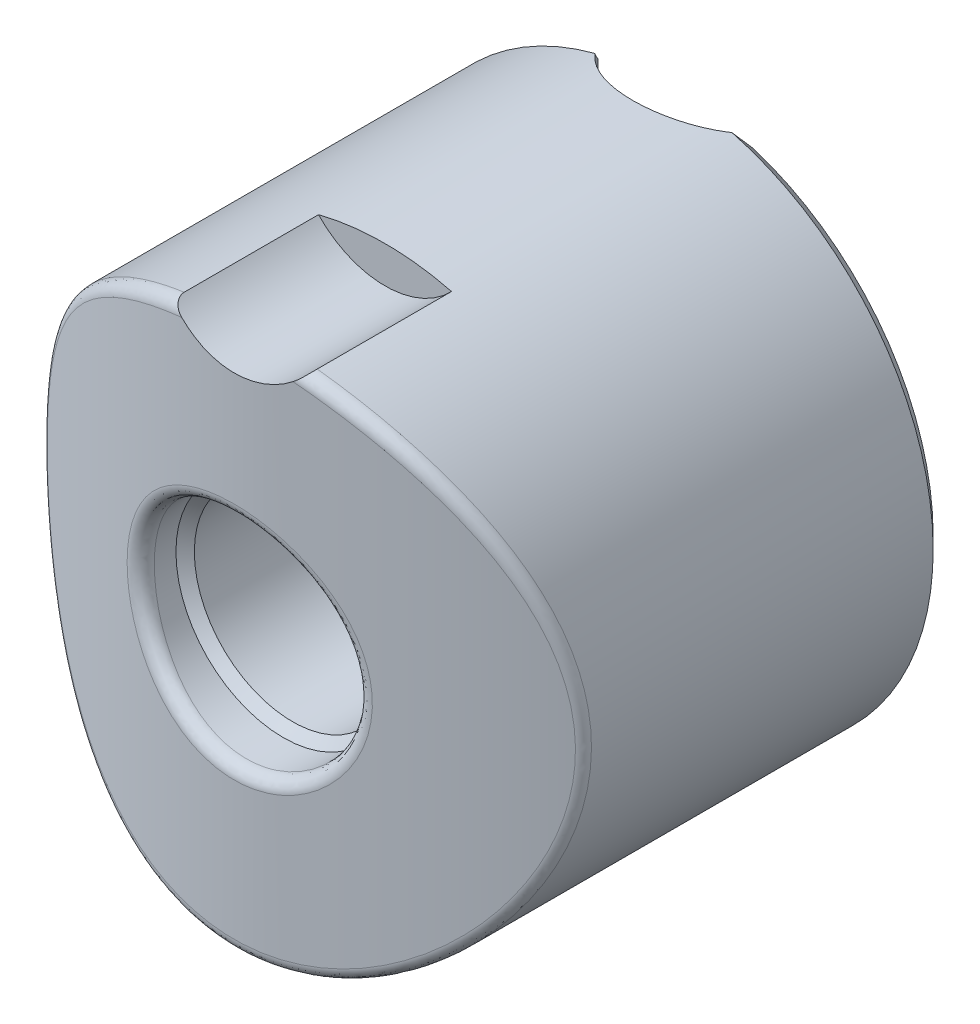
ISO-10303-21;
HEADER;
FILE_DESCRIPTION(('STEP AP214'),'2;1');
FILE_NAME('part.step','',(''),(''),'','','');
FILE_SCHEMA(('AUTOMOTIVE_DESIGN { 1 0 10303 214 1 1 1 1 }'));
ENDSEC;
DATA;
#1=APPLICATION_CONTEXT('core data for automotive mechanical design processes');
#2=APPLICATION_PROTOCOL_DEFINITION('international standard','automotive_design',2000,#1);
#3=PRODUCT_CONTEXT('',#1,'mechanical');
#4=PRODUCT('Part','Part','',(#3));
#5=PRODUCT_RELATED_PRODUCT_CATEGORY('part','',(#4));
#6=PRODUCT_DEFINITION_FORMATION('','',#4);
#7=PRODUCT_DEFINITION_CONTEXT('part definition',#1,'design');
#8=PRODUCT_DEFINITION('design','',#6,#7);
#9=PRODUCT_DEFINITION_SHAPE('','',#8);
#10=(LENGTH_UNIT() NAMED_UNIT(*) SI_UNIT(.MILLI.,.METRE.));
#11=(NAMED_UNIT(*) PLANE_ANGLE_UNIT() SI_UNIT($,.RADIAN.));
#12=(NAMED_UNIT(*) SI_UNIT($,.STERADIAN.) SOLID_ANGLE_UNIT());
#13=UNCERTAINTY_MEASURE_WITH_UNIT(LENGTH_MEASURE(1.E-05),#10,'distance_accuracy_value','');
#14=(GEOMETRIC_REPRESENTATION_CONTEXT(3) GLOBAL_UNCERTAINTY_ASSIGNED_CONTEXT((#13)) GLOBAL_UNIT_ASSIGNED_CONTEXT((#10,
#11,#12)) REPRESENTATION_CONTEXT('',''));
#15=CARTESIAN_POINT('',(0.,0.,0.));
#16=DIRECTION('',(0.,0.,1.));
#17=DIRECTION('',(1.,0.,0.));
#18=AXIS2_PLACEMENT_3D('',#15,#16,#17);
#19=CARTESIAN_POINT('',(0.,12.3245735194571,0.));
#20=DIRECTION('',(0.,-1.,0.));
#21=DIRECTION('',(1.,0.,0.));
#22=AXIS2_PLACEMENT_3D('',#19,#20,#21);
#23=TOROIDAL_SURFACE('',#22,11.,0.5);
#24=CARTESIAN_POINT('',(0.,12.7575862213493,0.));
#25=DIRECTION('',(0.,-1.,0.));
#26=DIRECTION('',(1.,0.,0.));
#27=AXIS2_PLACEMENT_3D('',#24,#25,#26);
#28=CIRCLE('',#27,11.25);
#29=CARTESIAN_POINT('',(10.5148704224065,12.7575862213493,4.));
#30=VERTEX_POINT('',#29);
#31=CARTESIAN_POINT('',(-10.5148704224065,12.7575862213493,4.));
#32=VERTEX_POINT('',#31);
#33=EDGE_CURVE('E322',#30,#32,#28,.T.);
#34=ORIENTED_EDGE('',*,*,#33,.F.);
#35=CARTESIAN_POINT('',(10.7819293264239,12.3245735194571,4.));
#36=CARTESIAN_POINT('',(10.7819599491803,12.3514174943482,4.));
#37=CARTESIAN_POINT('',(10.7796256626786,12.3782445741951,4.));
#38=CARTESIAN_POINT('',(10.7704634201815,12.4310647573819,4.));
#39=CARTESIAN_POINT('',(10.7636449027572,12.4570594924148,4.));
#40=CARTESIAN_POINT('',(10.7457496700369,12.5075305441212,4.));
#41=CARTESIAN_POINT('',(10.7346734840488,12.5320070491,4.));
#42=CARTESIAN_POINT('',(10.7086721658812,12.5788127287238,4.));
#43=CARTESIAN_POINT('',(10.6937471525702,12.6011419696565,4.));
#44=CARTESIAN_POINT('',(10.6601212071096,12.6436627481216,4.));
#45=CARTESIAN_POINT('',(10.6413351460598,12.6637868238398,4.));
#46=CARTESIAN_POINT('',(10.6008051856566,12.7008278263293,4.));
#47=CARTESIAN_POINT('',(10.5790582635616,12.7177414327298,4.));
#48=CARTESIAN_POINT('',(10.5318564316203,12.7489356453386,4.));
#49=CARTESIAN_POINT('',(10.5062574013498,12.7629976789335,4.));
#50=CARTESIAN_POINT('',(10.4532071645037,12.7869032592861,4.));
#51=CARTESIAN_POINT('',(10.4257590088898,12.7967535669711,4.));
#52=CARTESIAN_POINT('',(10.3977286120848,12.8044008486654,4.));
#53=B_SPLINE_CURVE_WITH_KNOTS('',3,(#35,#36,#37,#38,#39,#40,#41,#42,#43,#44,#45,#46,#47,#48,#49,
#50,#51,#52),.UNSPECIFIED.,.F.,.F.,(4,2,2,2,2,2,2,2,4),(0.,0.08040459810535,0.160640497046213,
0.240866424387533,0.321089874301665,0.403320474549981,0.485635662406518,0.57288452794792,
0.659992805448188),.UNSPECIFIED.);
#54=CARTESIAN_POINT('',(10.7819293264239,12.32457351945,4.));
#55=VERTEX_POINT('',#54);
#56=EDGE_CURVE('E23',#30,#55,#53,.F.);
#57=ORIENTED_EDGE('',*,*,#56,.T.);
#58=CARTESIAN_POINT('',(0.,12.3245735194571,0.));
#59=DIRECTION('',(0.,-1.,0.));
#60=DIRECTION('',(1.,0.,0.));
#61=AXIS2_PLACEMENT_3D('',#58,#59,#60);
#62=CIRCLE('',#61,11.5);
#63=CARTESIAN_POINT('',(-10.7819293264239,12.32457351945,4.));
#64=VERTEX_POINT('',#63);
#65=EDGE_CURVE('E323',#64,#55,#62,.F.);
#66=ORIENTED_EDGE('',*,*,#65,.F.);
#67=CARTESIAN_POINT('',(-10.5148704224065,12.7575862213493,4.));
#68=CARTESIAN_POINT('',(-10.5404948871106,12.7437849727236,4.));
#69=CARTESIAN_POINT('',(-10.5650083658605,12.7278775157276,4.));
#70=CARTESIAN_POINT('',(-10.6111455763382,12.6922112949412,4.));
#71=CARTESIAN_POINT('',(-10.6327619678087,12.672443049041,4.));
#72=CARTESIAN_POINT('',(-10.6723420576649,12.6294460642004,4.));
#73=CARTESIAN_POINT('',(-10.6902983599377,12.6062104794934,4.));
#74=CARTESIAN_POINT('',(-10.7217998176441,12.5569593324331,4.));
#75=CARTESIAN_POINT('',(-10.7353516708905,12.5309480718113,4.));
#76=CARTESIAN_POINT('',(-10.7569938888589,12.4781666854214,4.));
#77=CARTESIAN_POINT('',(-10.7653106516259,12.4514894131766,4.));
#78=CARTESIAN_POINT('',(-10.777125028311,12.3970688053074,4.));
#79=CARTESIAN_POINT('',(-10.7806205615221,12.3693250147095,4.));
#80=CARTESIAN_POINT('',(-10.78258261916,12.3148989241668,4.));
#81=CARTESIAN_POINT('',(-10.7812653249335,12.2882241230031,4.));
#82=CARTESIAN_POINT('',(-10.7741650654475,12.235459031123,4.));
#83=CARTESIAN_POINT('',(-10.7683793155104,12.2093691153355,4.));
#84=CARTESIAN_POINT('',(-10.7604034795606,12.1839601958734,4.));
#85=B_SPLINE_CURVE_WITH_KNOTS('',3,(#67,#68,#69,#70,#71,#72,#73,#74,#75,#76,#77,#78,#79,#80,#81,
#82,#83,#84),.UNSPECIFIED.,.F.,.F.,(4,2,2,2,2,2,2,2,4),(0.,0.08725320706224,0.174723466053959,
0.26236876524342,0.349880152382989,0.433285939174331,0.51672771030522,0.59646848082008,
0.676258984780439),.UNSPECIFIED.);
#86=EDGE_CURVE('E9',#64,#32,#85,.F.);
#87=ORIENTED_EDGE('',*,*,#86,.T.);
#88=EDGE_LOOP('',(#34,#57,#66,#87));
#89=FACE_BOUND('',#88,.T.);
#90=ADVANCED_FACE('F14',(#89),#23,.F.);
#91=CARTESIAN_POINT('',(0.,0.,4.));
#92=DIRECTION('',(0.,0.,1.));
#93=DIRECTION('',(1.,0.,0.));
#94=AXIS2_PLACEMENT_3D('',#91,#92,#93);
#95=PLANE('',#94);
#96=ORIENTED_EDGE('',*,*,#56,.F.);
#97=CARTESIAN_POINT('',(18.836315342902,8.13512148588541,4.));
#98=CARTESIAN_POINT('',(18.4403173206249,8.35875750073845,4.));
#99=CARTESIAN_POINT('',(18.044194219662,8.58217243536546,4.));
#100=CARTESIAN_POINT('',(17.2516316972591,9.02844286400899,4.));
#101=CARTESIAN_POINT('',(16.8551922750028,9.25129835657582,4.));
#102=CARTESIAN_POINT('',(16.0618756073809,9.69636365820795,4.));
#103=CARTESIAN_POINT('',(15.6649983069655,9.91857336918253,4.));
#104=CARTESIAN_POINT('',(14.8707731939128,10.3621496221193,4.));
#105=CARTESIAN_POINT('',(14.4734253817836,10.5835161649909,4.));
#106=CARTESIAN_POINT('',(13.6812328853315,11.0234695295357,4.));
#107=CARTESIAN_POINT('',(13.2863927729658,11.2420645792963,4.));
#108=CARTESIAN_POINT('',(12.4959735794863,11.6779142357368,4.));
#109=CARTESIAN_POINT('',(12.1003944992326,11.8951688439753,4.));
#110=CARTESIAN_POINT('',(11.3083115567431,12.3279068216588,4.));
#111=CARTESIAN_POINT('',(10.9118077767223,12.543390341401,4.));
#112=CARTESIAN_POINT('',(10.1175301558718,12.971999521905,4.));
#113=CARTESIAN_POINT('',(9.71975632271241,13.1851251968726,4.));
#114=CARTESIAN_POINT('',(8.88755187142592,13.6266737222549,4.));
#115=CARTESIAN_POINT('',(8.45296348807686,13.8548004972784,4.));
#116=CARTESIAN_POINT('',(7.79882864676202,14.1927252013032,4.));
#117=CARTESIAN_POINT('',(7.5803893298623,14.3046653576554,4.));
#118=CARTESIAN_POINT('',(7.14260348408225,14.5267556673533,4.));
#119=CARTESIAN_POINT('',(6.92325696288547,14.6369058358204,4.));
#120=CARTESIAN_POINT('',(6.48186791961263,14.8557426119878,4.));
#121=CARTESIAN_POINT('',(6.25981734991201,14.9644130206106,4.));
#122=CARTESIAN_POINT('',(5.81431268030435,15.1788318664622,4.));
#123=CARTESIAN_POINT('',(5.59085861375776,15.2845803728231,4.));
#124=CARTESIAN_POINT('',(5.14223089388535,15.4922558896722,4.));
#125=CARTESIAN_POINT('',(4.91705761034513,15.594183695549,4.));
#126=CARTESIAN_POINT('',(4.46450497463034,15.7929964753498,4.));
#127=CARTESIAN_POINT('',(4.23712577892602,15.8898818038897,4.));
#128=CARTESIAN_POINT('',(3.75562365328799,16.0866660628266,4.));
#129=CARTESIAN_POINT('',(3.50119232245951,16.1858191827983,4.));
#130=CARTESIAN_POINT('',(2.98798112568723,16.372483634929,4.));
#131=CARTESIAN_POINT('',(2.72920034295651,16.4599924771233,4.));
#132=CARTESIAN_POINT('',(2.20967828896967,16.6174701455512,4.));
#133=CARTESIAN_POINT('',(1.94900091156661,16.6876426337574,4.));
#134=CARTESIAN_POINT('',(1.55426783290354,16.7761475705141,4.));
#135=CARTESIAN_POINT('',(1.42208422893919,16.8028550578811,4.));
#136=CARTESIAN_POINT('',(1.15659501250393,16.8498784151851,4.));
#137=CARTESIAN_POINT('',(1.02328964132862,16.8701956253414,4.));
#138=CARTESIAN_POINT('',(0.777546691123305,16.9009954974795,4.));
#139=CARTESIAN_POINT('',(0.665242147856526,16.9125403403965,4.));
#140=CARTESIAN_POINT('',(0.440224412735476,16.9303223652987,4.));
#141=CARTESIAN_POINT('',(0.327511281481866,16.9365603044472,4.));
#142=CARTESIAN_POINT('',(0.101938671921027,16.9435408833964,4.));
#143=CARTESIAN_POINT('',(-0.0109207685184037,16.9442847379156,4.));
#144=CARTESIAN_POINT('',(-0.236541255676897,16.9402574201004,4.));
#145=CARTESIAN_POINT('',(-0.349302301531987,16.9354861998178,4.));
#146=CARTESIAN_POINT('',(-0.575436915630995,16.9205102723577,4.));
#147=CARTESIAN_POINT('',(-0.688807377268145,16.9102590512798,4.));
#148=CARTESIAN_POINT('',(-0.914963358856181,16.8845945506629,4.));
#149=CARTESIAN_POINT('',(-1.02774884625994,16.8691809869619,4.));
#150=CARTESIAN_POINT('',(-1.25258715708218,16.8335978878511,4.));
#151=CARTESIAN_POINT('',(-1.36463981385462,16.8134273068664,4.));
#152=CARTESIAN_POINT('',(-1.5878697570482,16.768803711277,4.));
#153=CARTESIAN_POINT('',(-1.69904712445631,16.7443510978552,4.));
#154=CARTESIAN_POINT('',(-2.01931978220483,16.6681312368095,4.));
#155=CARTESIAN_POINT('',(-2.2272532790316,16.6114626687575,4.));
#156=CARTESIAN_POINT('',(-2.63999206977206,16.4876108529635,4.));
#157=CARTESIAN_POINT('',(-2.84479594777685,16.4204229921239,4.));
#158=CARTESIAN_POINT('',(-3.25192390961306,16.2779512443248,4.));
#159=CARTESIAN_POINT('',(-3.454243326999,16.2026541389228,4.));
#160=CARTESIAN_POINT('',(-3.85646701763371,16.0459968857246,4.));
#161=CARTESIAN_POINT('',(-4.05637163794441,15.9646376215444,4.));
#162=CARTESIAN_POINT('',(-4.45527838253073,15.7968274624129,4.));
#163=CARTESIAN_POINT('',(-4.65426999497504,15.7103517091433,4.));
#164=CARTESIAN_POINT('',(-5.05063537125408,15.5337696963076,4.));
#165=CARTESIAN_POINT('',(-5.2480090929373,15.4436633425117,4.));
#166=CARTESIAN_POINT('',(-5.64125207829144,15.2606934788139,4.));
#167=CARTESIAN_POINT('',(-5.83712254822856,15.1678325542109,4.));
#168=CARTESIAN_POINT('',(-6.22777886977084,14.9798534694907,4.));
#169=CARTESIAN_POINT('',(-6.42256470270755,14.8847352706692,4.));
#170=CARTESIAN_POINT('',(-7.01504252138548,14.5920144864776,4.));
#171=CARTESIAN_POINT('',(-7.41131419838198,14.3915391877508,4.));
#172=CARTESIAN_POINT('',(-8.20136712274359,13.9855755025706,4.));
#173=CARTESIAN_POINT('',(-8.59514784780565,13.7800861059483,4.));
#174=CARTESIAN_POINT('',(-9.37949525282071,13.3663624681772,4.));
#175=CARTESIAN_POINT('',(-9.77006836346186,13.1581404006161,4.));
#176=CARTESIAN_POINT('',(-10.5498505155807,12.7392265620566,4.));
#177=CARTESIAN_POINT('',(-10.9390596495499,12.5285349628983,4.));
#178=CARTESIAN_POINT('',(-11.7467507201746,12.0888234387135,4.));
#179=CARTESIAN_POINT('',(-12.1651513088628,11.8596542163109,4.));
#180=CARTESIAN_POINT('',(-13.0010702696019,11.3997116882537,4.));
#181=CARTESIAN_POINT('',(-13.4185886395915,11.1689383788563,4.));
#182=CARTESIAN_POINT('',(-14.6701419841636,10.4747955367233,4.));
#183=CARTESIAN_POINT('',(-15.5031677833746,10.0096071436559,4.));
#184=CARTESIAN_POINT('',(-17.1675846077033,9.07621359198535,4.));
#185=CARTESIAN_POINT('',(-17.9989755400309,8.60800826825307,4.));
#186=CARTESIAN_POINT('',(-19.6606207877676,7.66959589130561,4.));
#187=CARTESIAN_POINT('',(-20.4908751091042,7.19938884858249,4.));
#188=CARTESIAN_POINT('',(-22.1519371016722,6.25681713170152,4.));
#189=CARTESIAN_POINT('',(-22.9827434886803,5.78445019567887,4.));
#190=CARTESIAN_POINT('',(-24.6437778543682,4.83869824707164,4.));
#191=CARTESIAN_POINT('',(-25.4740058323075,4.365313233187,4.));
#192=CARTESIAN_POINT('',(-27.9640081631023,2.94405927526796,4.));
#193=CARTESIAN_POINT('',(-29.623141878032,1.99506813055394,4.));
#194=CARTESIAN_POINT('',(-32.7639947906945,0.196327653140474,4.));
#195=CARTESIAN_POINT('',(-34.2458166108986,-0.653242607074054,4.));
#196=CARTESIAN_POINT('',(-37.2089125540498,-2.35336403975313,4.));
#197=CARTESIAN_POINT('',(-38.6901866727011,-3.20391521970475,4.));
#198=CARTESIAN_POINT('',(-41.6499849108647,-4.90434600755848,4.));
#199=CARTESIAN_POINT('',(-43.128509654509,-5.75422452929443,4.));
#200=CARTESIAN_POINT('',(-46.0852531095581,-7.454486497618,4.));
#201=CARTESIAN_POINT('',(-47.5634718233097,-8.30486994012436,4.));
#202=CARTESIAN_POINT('',(-49.0415918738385,-9.15542472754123,4.));
#203=B_SPLINE_CURVE_WITH_KNOTS('',3,(#97,#98,#99,#100,#101,#102,#103,#104,#105,#106,#107,#108,
#109,#110,#111,#112,#113,#114,#115,#116,#117,#118,#119,#120,#121,#122,#123,#124,#125,#126,#127,
#128,#129,#130,#131,#132,#133,#134,#135,#136,#137,#138,#139,#140,#141,#142,#143,#144,#145,#146,
#147,#148,#149,#150,#151,#152,#153,#154,#155,#156,#157,#158,#159,#160,#161,#162,#163,#164,#165,
#166,#167,#168,#169,#170,#171,#172,#173,#174,#175,#176,#177,#178,#179,#180,#181,#182,#183,#184,
#185,#186,#187,#188,#189,#190,#191,#192,#193,#194,#195,#196,#197,#198,#199,#200,#201,#202),
.UNSPECIFIED.,.F.,.F.,(4,2,2,2,2,2,2,2,2,2,2,2,2,2,2,2,2,2,2,2,2,2,2,2,2,2,2,2,2,2,2,2,2,2,2,2,
2,2,2,2,2,2,2,2,2,2,2,2,2,2,2,2,4),(0.,1.36434897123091,2.72870147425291,4.09325138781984,
5.45779982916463,6.81173376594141,8.16566612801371,9.51948238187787,10.8732904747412,
12.3457310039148,13.0820786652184,13.8184201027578,14.5600514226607,15.3016651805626,
16.0431236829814,16.7845299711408,17.6035301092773,18.422705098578,19.2317425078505,
19.6361792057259,20.0405310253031,20.3791044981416,20.7176296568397,21.056079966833,
21.3945332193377,21.7359059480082,22.077297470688,22.4187641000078,22.7601987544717,
23.4063452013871,24.0527758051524,24.7002765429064,25.3476830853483,25.9985450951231,
26.6494240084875,27.299710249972,27.9500076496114,29.2822341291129,30.6147312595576,
31.942548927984,33.2702747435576,34.7014227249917,36.132574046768,38.9949020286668,
41.8573880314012,44.7198590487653,47.586969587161,50.4540837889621,56.1881708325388,
61.3124352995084,66.4367391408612,71.5528860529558,76.6689921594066),.UNSPECIFIED.);
#204=CARTESIAN_POINT('',(6.34428877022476,14.9226497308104,4.));
#205=VERTEX_POINT('',#204);
#206=EDGE_CURVE('E311',#30,#205,#203,.T.);
#207=ORIENTED_EDGE('',*,*,#206,.T.);
#208=DIRECTION('',(0.,-1.,0.));
#209=VECTOR('',#208,1.);
#210=CARTESIAN_POINT('',(6.34428877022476,30.,4.));
#211=LINE('',#210,#209);
#212=CARTESIAN_POINT('',(6.34428877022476,20.0187412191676,4.));
#213=VERTEX_POINT('',#212);
#214=EDGE_CURVE('E300',#213,#205,#211,.T.);
#215=ORIENTED_EDGE('',*,*,#214,.F.);
#216=CARTESIAN_POINT('',(0.,0.,4.));
#217=DIRECTION('',(0.,0.,1.));
#218=DIRECTION('',(1.,0.,0.));
#219=AXIS2_PLACEMENT_3D('',#216,#217,#218);
#220=CIRCLE('',#219,21.);
#221=CARTESIAN_POINT('',(10.7819293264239,-18.0208212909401,4.));
#222=VERTEX_POINT('',#221);
#223=EDGE_CURVE('E113',#213,#222,#220,.F.);
#224=ORIENTED_EDGE('',*,*,#223,.T.);
#225=DIRECTION('',(0.,-1.,0.));
#226=VECTOR('',#225,1.);
#227=CARTESIAN_POINT('',(10.7819293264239,0.,4.));
#228=LINE('',#227,#226);
#229=EDGE_CURVE('E96',#222,#55,#228,.F.);
#230=ORIENTED_EDGE('',*,*,#229,.T.);
#231=EDGE_LOOP('',(#96,#207,#215,#224,#230));
#232=FACE_BOUND('',#231,.T.);
#233=ADVANCED_FACE('F368',(#232),#95,.F.);
#234=CARTESIAN_POINT('',(0.,0.,4.));
#235=DIRECTION('',(0.,0.,1.));
#236=DIRECTION('',(1.,0.,0.));
#237=AXIS2_PLACEMENT_3D('',#234,#235,#236);
#238=CONICAL_SURFACE('',#237,21.,0.785398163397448);
#239=CARTESIAN_POINT('',(-8.51859594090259,-23.2117303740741,7.72551119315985));
#240=CARTESIAN_POINT('',(-8.61316162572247,-23.0659435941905,7.62123206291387));
#241=CARTESIAN_POINT('',(-8.70500830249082,-22.919017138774,7.51611494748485));
#242=CARTESIAN_POINT('',(-8.88344211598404,-22.6231058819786,7.30435778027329));
#243=CARTESIAN_POINT('',(-8.97002972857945,-22.4741212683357,7.197717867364));
#244=CARTESIAN_POINT('',(-9.2221241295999,-22.0245008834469,6.87580735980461));
#245=CARTESIAN_POINT('',(-9.38004365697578,-21.7210725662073,6.65845587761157));
#246=CARTESIAN_POINT('',(-9.67650868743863,-21.1089710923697,6.21973549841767));
#247=CARTESIAN_POINT('',(-9.81509640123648,-20.8003110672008,5.99837658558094));
#248=CARTESIAN_POINT('',(-10.0743598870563,-20.1782168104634,5.55192767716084));
#249=CARTESIAN_POINT('',(-10.1950356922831,-19.8647825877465,5.32683768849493));
#250=CARTESIAN_POINT('',(-10.4051162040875,-19.27406300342,4.9022762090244));
#251=CARTESIAN_POINT('',(-10.4965457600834,-18.9972288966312,4.70317204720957));
#252=CARTESIAN_POINT('',(-10.6668675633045,-18.4411878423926,4.3029334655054));
#253=CARTESIAN_POINT('',(-10.7457600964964,-18.1619809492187,4.10179909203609));
#254=CARTESIAN_POINT('',(-10.8614193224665,-17.7169981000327,3.78094260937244));
#255=CARTESIAN_POINT('',(-10.9021595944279,-17.5518350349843,3.66178583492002));
#256=CARTESIAN_POINT('',(-10.9794967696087,-17.2209489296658,3.42292409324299));
#257=CARTESIAN_POINT('',(-11.0160938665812,-17.0552259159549,3.30321915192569));
#258=CARTESIAN_POINT('',(-11.1061536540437,-16.6226839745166,2.99057907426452));
#259=CARTESIAN_POINT('',(-11.1563923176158,-16.355477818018,2.79723896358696));
#260=CARTESIAN_POINT('',(-11.2239921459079,-15.9539843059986,2.50637324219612));
#261=CARTESIAN_POINT('',(-11.2452334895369,-15.8200306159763,2.40926925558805));
#262=CARTESIAN_POINT('',(-11.28514976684,-15.5519154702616,2.21477987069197));
#263=CARTESIAN_POINT('',(-11.3038243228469,-15.4177539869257,2.11739443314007));
#264=CARTESIAN_POINT('',(-11.3686895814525,-14.9172712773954,1.75383885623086));
#265=CARTESIAN_POINT('',(-11.4066561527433,-14.5504452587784,1.48684591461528));
#266=CARTESIAN_POINT('',(-11.4637531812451,-13.816440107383,0.951263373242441));
#267=CARTESIAN_POINT('',(-11.4828810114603,-13.4492609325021,0.682673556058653));
#268=CARTESIAN_POINT('',(-11.5022563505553,-12.7152886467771,0.144043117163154));
#269=CARTESIAN_POINT('',(-11.5024981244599,-12.348495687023,-0.125997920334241));
#270=CARTESIAN_POINT('',(-11.4838154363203,-11.6163042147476,-0.667342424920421));
#271=CARTESIAN_POINT('',(-11.4648903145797,-11.2509057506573,-0.938645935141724));
#272=CARTESIAN_POINT('',(-11.4071345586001,-10.5202504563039,-1.48426170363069));
#273=CARTESIAN_POINT('',(-11.3681764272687,-10.1550097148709,-1.7585820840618));
#274=CARTESIAN_POINT('',(-11.2693526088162,-9.42849337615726,-2.30863798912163));
#275=CARTESIAN_POINT('',(-11.2094909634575,-9.06721702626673,-2.58437323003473));
#276=CARTESIAN_POINT('',(-11.1028560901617,-8.52965013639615,-2.99949716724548));
#277=CARTESIAN_POINT('',(-11.0644863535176,-8.35111904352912,-3.13817809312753));
#278=CARTESIAN_POINT('',(-10.9818519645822,-7.99589658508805,-3.4161309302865));
#279=CARTESIAN_POINT('',(-10.9375876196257,-7.8192051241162,-3.5554028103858));
#280=CARTESIAN_POINT('',(-10.8428012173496,-7.46796388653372,-3.83477054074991));
#281=CARTESIAN_POINT('',(-10.7922751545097,-7.2934155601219,-3.97486686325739));
#282=CARTESIAN_POINT('',(-10.6845064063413,-6.9471579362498,-4.25604158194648));
#283=CARTESIAN_POINT('',(-10.6272625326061,-6.77544914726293,-4.39712014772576));
#284=CARTESIAN_POINT('',(-10.5664278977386,-6.60548199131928,-4.5387885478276));
#285=B_SPLINE_CURVE_WITH_KNOTS('',3,(#239,#240,#241,#242,#243,#244,#245,#246,#247,#248,#249,
#250,#251,#252,#253,#254,#255,#256,#257,#258,#259,#260,#261,#262,#263,#264,#265,#266,#267,#268,
#269,#270,#271,#272,#273,#274,#275,#276,#277,#278,#279,#280,#281,#282,#283,#284),.UNSPECIFIED.,
.F.,.F.,(4,2,2,2,2,2,2,2,2,2,2,2,2,2,2,2,2,2,2,2,2,2,4),(0.,0.607922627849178,1.21579016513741,
2.43100131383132,3.64351608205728,4.85602860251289,5.91492165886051,6.97379055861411,
7.59683491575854,8.2198501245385,9.22052142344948,9.72092022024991,10.2213925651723,
11.5868177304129,12.9524332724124,14.3184634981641,15.6845407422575,17.0594218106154,
18.4340371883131,19.1218656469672,19.8096582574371,20.4978931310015,21.1862499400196),.UNSPECIFIED.);
#286=CARTESIAN_POINT('',(-10.356157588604,-19.4100489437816,5.));
#287=VERTEX_POINT('',#286);
#288=CARTESIAN_POINT('',(-10.7819293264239,-18.0208212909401,4.));
#289=VERTEX_POINT('',#288);
#290=EDGE_CURVE('E99',#287,#289,#285,.T.);
#291=ORIENTED_EDGE('',*,*,#290,.F.);
#292=CARTESIAN_POINT('',(0.,0.,5.));
#293=DIRECTION('',(0.,0.,1.));
#294=DIRECTION('',(1.,0.,0.));
#295=AXIS2_PLACEMENT_3D('',#292,#293,#294);
#296=CIRCLE('',#295,22.);
#297=CARTESIAN_POINT('',(-5.59016994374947,21.2779228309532,5.));
#298=VERTEX_POINT('',#297);
#299=EDGE_CURVE('E164',#298,#287,#296,.T.);
#300=ORIENTED_EDGE('',*,*,#299,.F.);
#301=CARTESIAN_POINT('',(-6.34428877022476,20.0187412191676,4.));
#302=CARTESIAN_POINT('',(-6.2899565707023,20.1263514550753,4.08616868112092));
#303=CARTESIAN_POINT('',(-6.23357027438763,20.2334303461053,4.17171602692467));
#304=CARTESIAN_POINT('',(-6.11662936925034,20.4462295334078,4.3413661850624));
#305=CARTESIAN_POINT('',(-6.05607923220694,20.5519511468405,4.42547042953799));
#306=CARTESIAN_POINT('',(-5.93063483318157,20.7619704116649,4.59221696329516));
#307=CARTESIAN_POINT('',(-5.86574048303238,20.8662680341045,4.67485922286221));
#308=CARTESIAN_POINT('',(-5.73139646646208,21.0733298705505,4.83862670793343));
#309=CARTESIAN_POINT('',(-5.66194204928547,21.1760923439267,4.91975023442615));
#310=CARTESIAN_POINT('',(-5.59016994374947,21.2779228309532,5.));
#311=B_SPLINE_CURVE_WITH_KNOTS('',3,(#301,#302,#303,#304,#305,#306,#307,#308,#309,#310),
.UNSPECIFIED.,.F.,.F.,(4,2,2,2,4),(0.,0.444528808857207,0.888587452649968,1.332655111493,
1.7771929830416),.UNSPECIFIED.);
#312=CARTESIAN_POINT('',(-6.34428877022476,20.0187412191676,4.));
#313=VERTEX_POINT('',#312);
#314=EDGE_CURVE('E111',#313,#298,#311,.T.);
#315=ORIENTED_EDGE('',*,*,#314,.F.);
#316=EDGE_CURVE('E92',#289,#313,#220,.F.);
#317=ORIENTED_EDGE('',*,*,#316,.F.);
#318=EDGE_LOOP('',(#291,#300,#315,#317));
#319=FACE_BOUND('',#318,.T.);
#320=ADVANCED_FACE('F110',(#319),#238,.T.);
#321=CARTESIAN_POINT('',(0.,0.,0.));
#322=DIRECTION('',(0.,-1.,0.));
#323=DIRECTION('',(1.,0.,0.));
#324=AXIS2_PLACEMENT_3D('',#321,#322,#323);
#325=CYLINDRICAL_SURFACE('',#324,11.5);
#326=DIRECTION('',(0.,-1.,0.));
#327=VECTOR('',#326,1.);
#328=CARTESIAN_POINT('',(-10.7819293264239,0.,4.));
#329=LINE('',#328,#327);
#330=EDGE_CURVE('E87',#64,#289,#329,.T.);
#331=ORIENTED_EDGE('',*,*,#330,.F.);
#332=ORIENTED_EDGE('',*,*,#65,.T.);
#333=ORIENTED_EDGE('',*,*,#229,.F.);
#334=CARTESIAN_POINT('',(10.5664278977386,-6.60548199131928,-4.53878854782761));
#335=CARTESIAN_POINT('',(10.6174596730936,-6.74802005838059,-4.41996505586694));
#336=CARTESIAN_POINT('',(10.665952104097,-6.89179538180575,-4.3015677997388));
#337=CARTESIAN_POINT('',(10.7581554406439,-7.18142263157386,-4.06548759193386));
#338=CARTESIAN_POINT('',(10.8018669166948,-7.3272743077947,-3.94780455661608));
#339=CARTESIAN_POINT('',(10.9262492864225,-7.76724455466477,-3.59570056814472));
#340=CARTESIAN_POINT('',(11.0002211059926,-8.06392892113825,-3.36210019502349));
#341=CARTESIAN_POINT('',(11.1318454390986,-8.66179990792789,-2.89662415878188));
#342=CARTESIAN_POINT('',(11.1895102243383,-8.96298296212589,-2.66474732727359));
#343=CARTESIAN_POINT('',(11.2896718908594,-9.56877214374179,-2.20211731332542));
#344=CARTESIAN_POINT('',(11.3321666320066,-9.87337874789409,-1.97136429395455));
#345=CARTESIAN_POINT('',(11.4024946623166,-10.4831532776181,-1.51219392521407));
#346=CARTESIAN_POINT('',(11.4304136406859,-10.7883070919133,-1.28377084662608));
#347=CARTESIAN_POINT('',(11.4724513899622,-11.4002046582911,-0.827809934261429));
#348=CARTESIAN_POINT('',(11.4865705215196,-11.706948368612,-0.600272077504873));
#349=CARTESIAN_POINT('',(11.5013155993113,-12.3213672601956,-0.146113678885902));
#350=CARTESIAN_POINT('',(11.5019433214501,-12.6290423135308,0.0805069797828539));
#351=CARTESIAN_POINT('',(11.4898785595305,-13.2448070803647,0.532784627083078));
#352=CARTESIAN_POINT('',(11.47718731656,-13.5528967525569,0.758441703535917));
#353=CARTESIAN_POINT('',(11.4504200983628,-13.9795789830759,1.07025553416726));
#354=CARTESIAN_POINT('',(11.4419936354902,-14.0982100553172,1.15687406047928));
#355=CARTESIAN_POINT('',(11.4231715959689,-14.335422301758,1.3299349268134));
#356=CARTESIAN_POINT('',(11.4127762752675,-14.4540034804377,1.41637728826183));
#357=CARTESIAN_POINT('',(11.3786265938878,-14.8096967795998,1.6754744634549));
#358=CARTESIAN_POINT('',(11.3519111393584,-15.046716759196,1.84786875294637));
#359=CARTESIAN_POINT('',(11.2647799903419,-15.7190322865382,2.33624702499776));
#360=CARTESIAN_POINT('',(11.1948976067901,-16.153797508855,2.65132144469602));
#361=CARTESIAN_POINT('',(11.027625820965,-17.0204043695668,3.27821922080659));
#362=CARTESIAN_POINT('',(10.9302360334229,-17.4522459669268,3.59004253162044));
#363=CARTESIAN_POINT('',(10.745747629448,-18.1620219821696,4.10182841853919));
#364=CARTESIAN_POINT('',(10.6668496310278,-18.4412498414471,4.30297806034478));
#365=CARTESIAN_POINT('',(10.4965277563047,-18.9972842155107,4.70321189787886));
#366=CARTESIAN_POINT('',(10.405106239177,-19.2740911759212,4.90229647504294));
#367=CARTESIAN_POINT('',(10.1950557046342,-19.8647261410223,5.32679709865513));
#368=CARTESIAN_POINT('',(10.0744037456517,-20.1781028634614,5.5518458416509));
#369=CARTESIAN_POINT('',(9.81519472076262,-20.8000838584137,5.99821358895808));
#370=CARTESIAN_POINT('',(9.67663768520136,-21.1086881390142,6.2195325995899));
#371=CARTESIAN_POINT('',(9.38018712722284,-21.7207929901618,6.65825558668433));
#372=CARTESIAN_POINT('',(9.22224441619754,-22.0242782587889,6.87564792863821));
#373=CARTESIAN_POINT('',(8.97010957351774,-22.4739829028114,7.19761882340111));
#374=CARTESIAN_POINT('',(8.88350735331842,-22.6229956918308,7.30427891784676));
#375=CARTESIAN_POINT('',(8.70504239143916,-22.9189626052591,7.51607593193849));
#376=CARTESIAN_POINT('',(8.61317917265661,-23.0659165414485,7.6212127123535));
#377=CARTESIAN_POINT('',(8.51859594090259,-23.2117303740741,7.72551119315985));
#378=B_SPLINE_CURVE_WITH_KNOTS('',3,(#334,#335,#336,#337,#338,#339,#340,#341,#342,#343,#344,
#345,#346,#347,#348,#349,#350,#351,#352,#353,#354,#355,#356,#357,#358,#359,#360,#361,#362,#363,
#364,#365,#366,#367,#368,#369,#370,#371,#372,#373,#374,#375,#376,#377),.UNSPECIFIED.,.F.,.F.,(4,
2,2,2,2,2,2,2,2,2,2,2,2,2,2,2,2,2,2,2,2,4),(0.,0.577322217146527,1.15457546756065,
2.30847532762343,3.46150450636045,4.6146962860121,5.7610299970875,6.90733374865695,
8.05348660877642,9.19953267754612,9.64091170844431,10.0822334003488,10.9650326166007,
12.5886782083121,14.2123465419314,15.2713271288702,16.3301084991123,17.5424001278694,
18.7546897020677,19.9701214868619,20.578101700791,21.1861371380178),.UNSPECIFIED.);
#379=CARTESIAN_POINT('',(10.356157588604,-19.4100489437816,5.));
#380=VERTEX_POINT('',#379);
#381=EDGE_CURVE('E108',#222,#380,#378,.T.);
#382=ORIENTED_EDGE('',*,*,#381,.T.);
#383=CARTESIAN_POINT('',(-10.356157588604,-19.4100489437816,5.));
#384=CARTESIAN_POINT('',(-10.2106169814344,-19.4877014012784,5.3014459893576));
#385=CARTESIAN_POINT('',(-10.0524283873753,-19.5700021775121,5.59548066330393));
#386=CARTESIAN_POINT('',(-9.71214006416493,-19.7410882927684,6.1672500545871));
#387=CARTESIAN_POINT('',(-9.53004874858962,-19.8298713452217,6.44499045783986));
#388=CARTESIAN_POINT('',(-9.14293015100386,-20.0113116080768,6.98333256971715));
#389=CARTESIAN_POINT('',(-8.93786708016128,-20.1039747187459,7.24390650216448));
#390=CARTESIAN_POINT('',(-8.50622602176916,-20.290376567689,7.74621077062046));
#391=CARTESIAN_POINT('',(-8.27964593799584,-20.3841154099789,7.98793926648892));
#392=CARTESIAN_POINT('',(-7.80627939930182,-20.5700419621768,8.4511302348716));
#393=CARTESIAN_POINT('',(-7.55950272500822,-20.6622303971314,8.67260240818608));
#394=CARTESIAN_POINT('',(-7.04687681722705,-20.8426328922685,9.09404265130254));
#395=CARTESIAN_POINT('',(-6.78102866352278,-20.9308471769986,9.29401193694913));
#396=CARTESIAN_POINT('',(-6.23174586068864,-21.1008991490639,9.67089510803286));
#397=CARTESIAN_POINT('',(-5.94832086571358,-21.1827402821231,9.84782148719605));
#398=CARTESIAN_POINT('',(-5.3653357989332,-21.3378567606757,10.1771921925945));
#399=CARTESIAN_POINT('',(-5.06577622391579,-21.4111323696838,10.3296372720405));
#400=CARTESIAN_POINT('',(-4.45870150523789,-21.5456408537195,10.6056050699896));
#401=CARTESIAN_POINT('',(-4.1514748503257,-21.6070895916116,10.729656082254));
#402=CARTESIAN_POINT('',(-3.52549977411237,-21.7180077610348,10.9513047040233));
#403=CARTESIAN_POINT('',(-3.20675142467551,-21.7674772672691,11.0489024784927));
#404=CARTESIAN_POINT('',(-2.56048290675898,-21.8529194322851,11.2162947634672));
#405=CARTESIAN_POINT('',(-2.2329687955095,-21.8889011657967,11.2861079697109));
#406=CARTESIAN_POINT('',(-1.57186140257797,-21.9462818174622,11.3969973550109));
#407=CARTESIAN_POINT('',(-1.23826884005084,-21.967682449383,11.4380769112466));
#408=CARTESIAN_POINT('',(-0.604670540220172,-21.9937198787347,11.4879978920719));
#409=CARTESIAN_POINT('',(-0.304963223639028,-21.9999284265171,11.4998628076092));
#410=CARTESIAN_POINT('',(0.294450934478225,-22.000070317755,11.5001347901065));
#411=CARTESIAN_POINT('',(0.594157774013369,-21.9940046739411,11.4885437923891));
#412=CARTESIAN_POINT('',(1.19120387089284,-21.9697586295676,11.4420576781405));
#413=CARTESIAN_POINT('',(1.48854352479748,-21.9515803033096,11.4071665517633));
#414=CARTESIAN_POINT('',(2.07867936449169,-21.9035781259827,11.3145173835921));
#415=CARTESIAN_POINT('',(2.37147552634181,-21.8737542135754,11.2567592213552));
#416=CARTESIAN_POINT('',(2.93951899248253,-21.8045408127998,11.1216558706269));
#417=CARTESIAN_POINT('',(3.21501167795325,-21.7655544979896,11.0451315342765));
#418=CARTESIAN_POINT('',(3.75820305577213,-21.6783665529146,10.8723107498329));
#419=CARTESIAN_POINT('',(4.02590202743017,-21.6301652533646,10.7760150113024));
#420=CARTESIAN_POINT('',(4.55208435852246,-21.5255776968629,10.5645133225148));
#421=CARTESIAN_POINT('',(4.81056686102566,-21.469190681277,10.4493056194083));
#422=CARTESIAN_POINT('',(5.31713131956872,-21.3493768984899,10.2008694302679));
#423=CARTESIAN_POINT('',(5.56520928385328,-21.2859474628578,10.0676341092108));
#424=CARTESIAN_POINT('',(6.06780710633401,-21.1483933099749,9.7735695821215));
#425=CARTESIAN_POINT('',(6.32143646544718,-21.0738241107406,9.61142577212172));
#426=CARTESIAN_POINT('',(6.81429204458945,-20.9196591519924,9.26852752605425));
#427=CARTESIAN_POINT('',(7.05351270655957,-20.8400614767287,9.08776598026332));
#428=CARTESIAN_POINT('',(7.51648243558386,-20.6775882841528,8.70872922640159));
#429=CARTESIAN_POINT('',(7.74023143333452,-20.5947127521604,8.51045393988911));
#430=CARTESIAN_POINT('',(8.17128387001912,-20.427521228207,8.09748635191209));
#431=CARTESIAN_POINT('',(8.37858881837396,-20.3432053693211,7.8827955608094));
#432=CARTESIAN_POINT('',(8.9322761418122,-20.1087717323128,7.26278627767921));
#433=CARTESIAN_POINT('',(9.25997495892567,-19.9589972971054,6.84021154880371));
#434=CARTESIAN_POINT('',(9.70600022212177,-19.7438836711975,6.17374415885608));
#435=CARTESIAN_POINT('',(9.84706254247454,-19.6737846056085,5.94620691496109));
#436=CARTESIAN_POINT('',(10.1135202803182,-19.5381413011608,5.48074076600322));
#437=CARTESIAN_POINT('',(10.238910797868,-19.4725984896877,5.24280864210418));
#438=CARTESIAN_POINT('',(10.356157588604,-19.4100489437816,5.));
#439=B_SPLINE_CURVE_WITH_KNOTS('',3,(#383,#384,#385,#386,#387,#388,#389,#390,#391,#392,#393,
#394,#395,#396,#397,#398,#399,#400,#401,#402,#403,#404,#405,#406,#407,#408,#409,#410,#411,#412,
#413,#414,#415,#416,#417,#418,#419,#420,#421,#422,#423,#424,#425,#426,#427,#428,#429,#430,#431,
#432,#433,#434,#435,#436,#437,#438),.UNSPECIFIED.,.F.,.F.,(4,2,2,2,2,2,2,2,2,2,2,2,2,2,2,2,2,2,
2,2,2,2,2,2,2,2,2,4),(0.,1.03041421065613,2.06046669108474,3.09214686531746,4.12392765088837,
5.1552116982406,6.18643740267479,7.21710163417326,8.24773414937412,9.25726367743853,
10.2667869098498,11.2756296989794,12.2843538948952,13.1832310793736,14.0820341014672,
14.980683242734,15.8793371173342,16.744099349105,17.6088305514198,18.4736419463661,
19.3387821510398,20.2681914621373,21.1979570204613,22.1277267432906,23.0574110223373,
24.7174599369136,25.5471253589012,26.3770495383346),.UNSPECIFIED.);
#440=EDGE_CURVE('E103',#287,#380,#439,.T.);
#441=ORIENTED_EDGE('',*,*,#440,.F.);
#442=ORIENTED_EDGE('',*,*,#290,.T.);
#443=EDGE_LOOP('',(#331,#332,#333,#382,#441,#442));
#444=FACE_BOUND('',#443,.T.);
#445=CARTESIAN_POINT('',(-10.5,0.,4.69041575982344));
#446=CARTESIAN_POINT('',(-10.4999991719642,0.150856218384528,4.69041893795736));
#447=CARTESIAN_POINT('',(-10.496737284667,0.3017325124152,4.69774054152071));
#448=CARTESIAN_POINT('',(-10.4838140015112,0.601853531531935,4.72650837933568));
#449=CARTESIAN_POINT('',(-10.4741509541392,0.751097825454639,4.74795825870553));
#450=CARTESIAN_POINT('',(-10.448716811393,1.04712484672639,4.80367010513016));
#451=CARTESIAN_POINT('',(-10.4329253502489,1.19389764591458,4.8379747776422));
#452=CARTESIAN_POINT('',(-10.3956674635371,1.48373590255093,4.9175222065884));
#453=CARTESIAN_POINT('',(-10.3741979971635,1.62679932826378,4.96277082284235));
#454=CARTESIAN_POINT('',(-10.313900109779,1.97983212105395,5.08727124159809));
#455=CARTESIAN_POINT('',(-10.2717732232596,2.18723850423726,5.17217529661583));
#456=CARTESIAN_POINT('',(-10.1769248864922,2.59300685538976,5.35639277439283));
#457=CARTESIAN_POINT('',(-10.1241960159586,2.79136236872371,5.45571627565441));
#458=CARTESIAN_POINT('',(-10.008809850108,3.1804108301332,5.66462881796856));
#459=CARTESIAN_POINT('',(-9.94612090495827,3.37107683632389,5.77425011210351));
#460=CARTESIAN_POINT('',(-9.8114732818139,3.74492428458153,6.00019135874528));
#461=CARTESIAN_POINT('',(-9.73951605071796,3.92810688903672,6.11651026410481));
#462=CARTESIAN_POINT('',(-9.59467477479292,4.26881278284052,6.34098882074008));
#463=CARTESIAN_POINT('',(-9.52268792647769,4.42700545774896,6.4487161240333));
#464=CARTESIAN_POINT('',(-9.37161816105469,4.73842947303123,6.66635907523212));
#465=CARTESIAN_POINT('',(-9.29253433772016,4.89166017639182,6.77627500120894));
#466=CARTESIAN_POINT('',(-9.04461067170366,5.34449572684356,7.10781831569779));
#467=CARTESIAN_POINT('',(-8.8651503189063,5.63712308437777,7.33115956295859));
#468=CARTESIAN_POINT('',(-8.47802220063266,6.20409168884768,7.77560603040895));
#469=CARTESIAN_POINT('',(-8.27038824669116,6.47845427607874,7.99671359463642));
#470=CARTESIAN_POINT('',(-7.82620600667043,7.0085636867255,8.43190939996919));
#471=CARTESIAN_POINT('',(-7.58967302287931,7.26432024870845,8.64600128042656));
#472=CARTESIAN_POINT('',(-7.14981177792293,7.6941321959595,9.01056121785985));
#473=CARTESIAN_POINT('',(-6.95292990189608,7.87264747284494,9.1635727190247));
#474=CARTESIAN_POINT('',(-6.54232489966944,8.21704170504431,9.46109097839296));
#475=CARTESIAN_POINT('',(-6.32860197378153,8.38292081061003,9.60559783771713));
#476=CARTESIAN_POINT('',(-5.88464715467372,8.70030329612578,9.88379789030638));
#477=CARTESIAN_POINT('',(-5.65443895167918,8.85182660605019,10.0175060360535));
#478=CARTESIAN_POINT('',(-5.17756306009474,9.1389413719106,10.2720906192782));
#479=CARTESIAN_POINT('',(-4.93089903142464,9.2745363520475,10.3929698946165));
#480=CARTESIAN_POINT('',(-4.47283553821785,9.50239124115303,10.5968580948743));
#481=CARTESIAN_POINT('',(-4.26426179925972,9.59789228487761,10.6826039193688));
#482=CARTESIAN_POINT('',(-3.83772570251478,9.7762605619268,10.8431434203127));
#483=CARTESIAN_POINT('',(-3.61976540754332,9.8591305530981,10.9179394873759));
#484=CARTESIAN_POINT('',(-3.17542109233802,10.0110843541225,11.0553497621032));
#485=CARTESIAN_POINT('',(-2.94903979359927,10.0801725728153,11.1179678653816));
#486=CARTESIAN_POINT('',(-2.48902851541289,10.2035009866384,11.2299048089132));
#487=CARTESIAN_POINT('',(-2.2553984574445,10.2577410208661,11.2792235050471));
#488=CARTESIAN_POINT('',(-1.78091719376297,10.3507076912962,11.3638363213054));
#489=CARTESIAN_POINT('',(-1.54002875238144,10.3893305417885,11.3990366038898));
#490=CARTESIAN_POINT('',(-1.05441047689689,10.4497885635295,11.4541663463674));
#491=CARTESIAN_POINT('',(-0.809680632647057,10.4716236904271,11.4740957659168));
#492=CARTESIAN_POINT('',(-0.318592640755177,10.4980448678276,11.498213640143));
#493=CARTESIAN_POINT('',(-0.0722350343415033,10.502636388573,11.5024070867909));
#494=CARTESIAN_POINT('',(0.419940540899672,10.4944848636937,11.4949645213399));
#495=CARTESIAN_POINT('',(0.665758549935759,10.481743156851,11.483329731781));
#496=CARTESIAN_POINT('',(1.12916144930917,10.4414236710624,11.4465396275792));
#497=CARTESIAN_POINT('',(1.34701910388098,10.4155302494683,11.4229195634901));
#498=CARTESIAN_POINT('',(1.77915313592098,10.3504767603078,11.3636345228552));
#499=CARTESIAN_POINT('',(1.99342831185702,10.311312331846,11.3279655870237));
#500=CARTESIAN_POINT('',(2.41697854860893,10.2203293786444,11.2452112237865));
#501=CARTESIAN_POINT('',(2.6262543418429,10.1685127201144,11.1981274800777));
#502=CARTESIAN_POINT('',(3.03876042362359,10.0529513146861,11.0932970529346));
#503=CARTESIAN_POINT('',(3.24198995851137,9.98920508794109,11.0355490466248));
#504=CARTESIAN_POINT('',(3.65094038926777,9.84731703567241,10.9072768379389));
#505=CARTESIAN_POINT('',(3.85632578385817,9.7686375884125,10.8362781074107));
#506=CARTESIAN_POINT('',(4.25866918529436,9.60007059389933,10.6845689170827));
#507=CARTESIAN_POINT('',(4.45562711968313,9.51018295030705,10.6038583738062));
#508=CARTESIAN_POINT('',(5.03314484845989,9.22505380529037,10.3486413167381));
#509=CARTESIAN_POINT('',(5.4004672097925,9.0143041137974,10.1610112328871));
#510=CARTESIAN_POINT('',(6.01446767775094,8.61262882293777,9.80666539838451));
#511=CARTESIAN_POINT('',(6.26915276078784,8.42877273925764,9.64547267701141));
#512=CARTESIAN_POINT('',(6.75628027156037,8.0435705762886,9.31074251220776));
#513=CARTESIAN_POINT('',(6.98872019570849,7.84222253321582,9.13720368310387));
#514=CARTESIAN_POINT('',(7.43214968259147,7.42337648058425,8.78034394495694));
#515=CARTESIAN_POINT('',(7.64306816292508,7.2058288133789,8.59699348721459));
#516=CARTESIAN_POINT('',(8.04297563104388,6.75655028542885,8.22406563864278));
#517=CARTESIAN_POINT('',(8.23196893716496,6.5248222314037,8.03448948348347));
#518=CARTESIAN_POINT('',(8.592874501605,6.04198717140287,7.64749647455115));
#519=CARTESIAN_POINT('',(8.76425170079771,5.79054352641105,7.45000149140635));
#520=CARTESIAN_POINT('',(9.08486586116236,5.27331666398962,7.05548030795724));
#521=CARTESIAN_POINT('',(9.23409195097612,5.00752649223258,6.85845438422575));
#522=CARTESIAN_POINT('',(9.50991878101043,4.46147884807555,6.47053891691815));
#523=CARTESIAN_POINT('',(9.63658298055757,4.18126490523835,6.2796334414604));
#524=CARTESIAN_POINT('',(9.86711202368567,3.6037130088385,5.91076776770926));
#525=CARTESIAN_POINT('',(9.97100299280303,3.30639517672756,5.73279289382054));
#526=CARTESIAN_POINT('',(10.1405980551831,2.73726707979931,5.42625261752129));
#527=CARTESIAN_POINT('',(10.2096954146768,2.46834576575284,5.29428184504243));
#528=CARTESIAN_POINT('',(10.3279758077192,1.91389812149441,5.05965754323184));
#529=CARTESIAN_POINT('',(10.3771989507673,1.6284065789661,4.95694509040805));
#530=CARTESIAN_POINT('',(10.4460936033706,1.09061639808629,4.80986654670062));
#531=CARTESIAN_POINT('',(10.4693343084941,0.840769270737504,4.75860859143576));
#532=CARTESIAN_POINT('',(10.4906061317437,0.461817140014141,4.71141359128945));
#533=CARTESIAN_POINT('',(10.4954326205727,0.33485252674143,4.70062902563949));
#534=CARTESIAN_POINT('',(10.5004623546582,0.0803512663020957,4.68938664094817));
#535=CARTESIAN_POINT('',(10.5006656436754,-0.0471853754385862,4.68892872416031));
#536=CARTESIAN_POINT('',(10.4964346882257,-0.301781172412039,4.6983913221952));
#537=CARTESIAN_POINT('',(10.4920007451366,-0.428840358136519,4.70831116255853));
#538=CARTESIAN_POINT('',(10.478620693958,-0.681581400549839,4.73801280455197));
#539=CARTESIAN_POINT('',(10.4696726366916,-0.807262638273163,4.75779886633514));
#540=CARTESIAN_POINT('',(10.4363249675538,-1.18142118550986,4.83073688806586));
#541=CARTESIAN_POINT('',(10.405426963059,-1.42674633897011,4.89745573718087));
#542=CARTESIAN_POINT('',(10.3346127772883,-1.86751349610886,5.04492721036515));
#543=CARTESIAN_POINT('',(10.2969000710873,-2.06470201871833,5.12178334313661));
#544=CARTESIAN_POINT('',(10.2118271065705,-2.45106032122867,5.28936979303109));
#545=CARTESIAN_POINT('',(10.1644592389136,-2.64022363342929,5.38011103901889));
#546=CARTESIAN_POINT('',(10.0606979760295,-3.01159167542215,5.57173884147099));
#547=CARTESIAN_POINT('',(10.0042727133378,-3.19376891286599,5.67266073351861));
#548=CARTESIAN_POINT('',(9.88300948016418,-3.55130387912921,5.88138648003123));
#549=CARTESIAN_POINT('',(9.81816843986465,-3.72665908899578,5.98919283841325));
#550=CARTESIAN_POINT('',(9.68499123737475,-4.05966971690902,6.2020678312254));
#551=CARTESIAN_POINT('',(9.61717669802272,-4.21772556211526,6.30683942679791));
#552=CARTESIAN_POINT('',(9.47462830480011,-4.52887273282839,6.51903215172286));
#553=CARTESIAN_POINT('',(9.39989343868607,-4.68196332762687,6.62645366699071));
#554=CARTESIAN_POINT('',(9.1653190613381,-5.13444739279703,6.95112319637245));
#555=CARTESIAN_POINT('',(8.99516537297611,-5.42691505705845,7.17068548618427));
#556=CARTESIAN_POINT('',(8.62751966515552,-5.99416073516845,7.609063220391));
#557=CARTESIAN_POINT('',(8.43004948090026,-6.26895262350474,7.82787911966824));
#558=CARTESIAN_POINT('',(8.0072005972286,-6.80073788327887,8.2599053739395));
#559=CARTESIAN_POINT('',(7.78183606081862,-7.0577401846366,8.4731185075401));
#560=CARTESIAN_POINT('',(7.35473768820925,-7.49869387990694,8.84418166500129));
#561=CARTESIAN_POINT('',(7.15853339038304,-7.68637182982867,9.00398279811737));
#562=CARTESIAN_POINT('',(6.74839199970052,-8.04885699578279,9.31533558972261));
#563=CARTESIAN_POINT('',(6.53445462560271,-8.22366400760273,9.46688711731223));
#564=CARTESIAN_POINT('',(6.08914093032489,-8.55861341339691,9.7592626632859));
#565=CARTESIAN_POINT('',(5.85779217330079,-8.71877813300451,9.90010295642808));
#566=CARTESIAN_POINT('',(5.37759982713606,-9.02286684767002,10.1689270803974));
#567=CARTESIAN_POINT('',(5.12876055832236,-9.16679483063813,10.2969140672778));
#568=CARTESIAN_POINT('',(4.66887404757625,-9.40765400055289,10.5119777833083));
#569=CARTESIAN_POINT('',(4.46101386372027,-9.50807666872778,10.6019722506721));
#570=CARTESIAN_POINT('',(4.0354503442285,-9.69635240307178,10.7711439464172));
#571=CARTESIAN_POINT('',(3.81774924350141,-9.78420830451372,10.8503236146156));
#572=CARTESIAN_POINT('',(3.37339935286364,-9.94615869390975,10.996584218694));
#573=CARTESIAN_POINT('',(3.14675319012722,-10.0202571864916,11.0636686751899));
#574=CARTESIAN_POINT('',(2.68563902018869,-10.1535674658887,11.1845492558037));
#575=CARTESIAN_POINT('',(2.45117092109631,-10.2127790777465,11.2383452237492));
#576=CARTESIAN_POINT('',(1.97426593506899,-10.3156283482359,11.3318898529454));
#577=CARTESIAN_POINT('',(1.73178436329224,-10.3591527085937,11.3715363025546));
#578=CARTESIAN_POINT('',(1.24234715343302,-10.4291743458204,11.4353604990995));
#579=CARTESIAN_POINT('',(0.995391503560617,-10.4556715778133,11.4595382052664));
#580=CARTESIAN_POINT('',(0.499272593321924,-10.4910699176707,11.4918447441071));
#581=CARTESIAN_POINT('',(0.250110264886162,-10.4999781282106,11.4999800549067));
#582=CARTESIAN_POINT('',(-0.248204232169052,-10.5000217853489,11.5000198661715));
#583=CARTESIAN_POINT('',(-0.497356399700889,-10.4911588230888,11.4919258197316));
#584=CARTESIAN_POINT('',(-0.965597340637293,-10.4578395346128,11.4615168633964));
#585=CARTESIAN_POINT('',(-1.18493276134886,-10.4352374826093,11.4408931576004));
#586=CARTESIAN_POINT('',(-1.62028382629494,-10.3765562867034,11.3873954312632));
#587=CARTESIAN_POINT('',(-1.83629937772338,-10.3404767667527,11.3545210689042));
#588=CARTESIAN_POINT('',(-2.26363314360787,-10.2554100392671,11.2771062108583));
#589=CARTESIAN_POINT('',(-2.47495130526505,-10.2064226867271,11.2325655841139));
#590=CARTESIAN_POINT('',(-2.8917330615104,-10.0962544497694,11.1325567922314));
#591=CARTESIAN_POINT('',(-3.09719632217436,-10.0350728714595,11.0770880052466));
#592=CARTESIAN_POINT('',(-3.50855870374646,-9.89891965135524,10.953891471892));
#593=CARTESIAN_POINT('',(-3.71421006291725,-9.82353271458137,10.8857959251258));
#594=CARTESIAN_POINT('',(-4.11743928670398,-9.66146840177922,10.7397738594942));
#595=CARTESIAN_POINT('',(-4.31501418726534,-9.57478692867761,10.6618437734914));
#596=CARTESIAN_POINT('',(-4.89469262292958,-9.29918573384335,10.4148052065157));
#597=CARTESIAN_POINT('',(-5.26392297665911,-9.0946508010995,10.2323952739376));
#598=CARTESIAN_POINT('',(-5.8800054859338,-8.70486407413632,9.88779582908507));
#599=CARTESIAN_POINT('',(-6.13487696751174,-8.52688528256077,9.73136244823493));
#600=CARTESIAN_POINT('',(-6.62309294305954,-8.15346854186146,9.40588405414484));
#601=CARTESIAN_POINT('',(-6.85642784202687,-7.95802288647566,9.23683347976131));
#602=CARTESIAN_POINT('',(-7.30206711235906,-7.55123310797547,8.88875675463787));
#603=CARTESIAN_POINT('',(-7.514315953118,-7.33984945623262,8.7097061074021));
#604=CARTESIAN_POINT('',(-7.91743911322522,-6.90307635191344,8.3449394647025));
#605=CARTESIAN_POINT('',(-8.10831710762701,-6.67768931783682,8.15922462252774));
#606=CARTESIAN_POINT('',(-8.47345410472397,-6.20815230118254,7.77956145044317));
#607=CARTESIAN_POINT('',(-8.64720650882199,-5.96368251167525,7.58552243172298));
#608=CARTESIAN_POINT('',(-8.97317415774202,-5.46094812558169,7.19697347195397));
#609=CARTESIAN_POINT('',(-9.12538124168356,-5.20267835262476,7.00246338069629));
#610=CARTESIAN_POINT('',(-9.40802362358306,-4.67218388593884,6.61784881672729));
#611=CARTESIAN_POINT('',(-9.5384971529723,-4.39998482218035,6.427737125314));
#612=CARTESIAN_POINT('',(-9.7775596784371,-3.83955086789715,6.05785252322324));
#613=CARTESIAN_POINT('',(-9.88616778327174,-3.55133026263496,5.8780706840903));
#614=CARTESIAN_POINT('',(-10.0294575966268,-3.11162050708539,5.62749930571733));
#615=CARTESIAN_POINT('',(-10.0730868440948,-2.96749278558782,5.54889927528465));
#616=CARTESIAN_POINT('',(-10.1548091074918,-2.67451265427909,5.3978913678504));
#617=CARTESIAN_POINT('',(-10.1929014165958,-2.52565964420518,5.32548428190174));
#618=CARTESIAN_POINT('',(-10.2981840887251,-2.07208913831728,5.12061818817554));
#619=CARTESIAN_POINT('',(-10.3566648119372,-1.75950406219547,5.00000213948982));
#620=CARTESIAN_POINT('',(-10.4332615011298,-1.2048664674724,4.83766088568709));
#621=CARTESIAN_POINT('',(-10.4580953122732,-0.967579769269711,4.78330164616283));
#622=CARTESIAN_POINT('',(-10.483133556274,-0.607017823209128,4.72803046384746));
#623=CARTESIAN_POINT('',(-10.489444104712,-0.486126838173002,4.71398520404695));
#624=CARTESIAN_POINT('',(-10.4978771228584,-0.243494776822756,4.69517776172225));
#625=CARTESIAN_POINT('',(-10.500000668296,-0.121753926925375,4.69041319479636));
#626=CARTESIAN_POINT('',(-10.5,0.,4.69041575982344));
#627=B_SPLINE_CURVE_WITH_KNOTS('',3,(#445,#446,#447,#448,#449,#450,#451,#452,#453,#454,#455,
#456,#457,#458,#459,#460,#461,#462,#463,#464,#465,#466,#467,#468,#469,#470,#471,#472,#473,#474,
#475,#476,#477,#478,#479,#480,#481,#482,#483,#484,#485,#486,#487,#488,#489,#490,#491,#492,#493,
#494,#495,#496,#497,#498,#499,#500,#501,#502,#503,#504,#505,#506,#507,#508,#509,#510,#511,#512,
#513,#514,#515,#516,#517,#518,#519,#520,#521,#522,#523,#524,#525,#526,#527,#528,#529,#530,#531,
#532,#533,#534,#535,#536,#537,#538,#539,#540,#541,#542,#543,#544,#545,#546,#547,#548,#549,#550,
#551,#552,#553,#554,#555,#556,#557,#558,#559,#560,#561,#562,#563,#564,#565,#566,#567,#568,#569,
#570,#571,#572,#573,#574,#575,#576,#577,#578,#579,#580,#581,#582,#583,#584,#585,#586,#587,#588,
#589,#590,#591,#592,#593,#594,#595,#596,#597,#598,#599,#600,#601,#602,#603,#604,#605,#606,#607,
#608,#609,#610,#611,#612,#613,#614,#615,#616,#617,#618,#619,#620,#621,#622,#623,#624,#625,#626),
.UNSPECIFIED.,.T.,.F.,(4,2,2,2,2,2,2,2,2,2,2,2,2,2,2,2,2,2,2,2,2,2,2,2,2,2,2,2,2,2,2,2,2,2,2,2,
2,2,2,2,2,2,2,2,2,2,2,2,2,2,2,2,2,2,2,2,2,2,2,2,2,2,2,2,2,2,2,2,2,2,2,2,2,2,2,2,2,2,2,2,2,2,2,2,
2,2,2,2,2,2,4),(0.,0.452399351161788,0.904915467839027,1.35894843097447,1.81322504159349,
2.49612269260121,3.17949997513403,3.86509391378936,4.55058095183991,5.16381229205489,
5.77712204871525,7.00420452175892,8.22982717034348,9.45480363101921,10.3740513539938,
11.2932881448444,12.2112294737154,13.1289673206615,13.8629829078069,14.5968380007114,
15.3304579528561,16.0640858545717,16.8025120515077,17.5409401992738,18.2791340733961,
19.017270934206,19.6784899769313,20.3399265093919,21.0012655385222,21.6626866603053,
22.3553399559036,23.0479992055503,24.4329267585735,25.4908360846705,26.5488643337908,
27.6102810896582,28.6714884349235,29.7588213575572,30.8466861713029,31.9314411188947,
33.0149450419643,33.9354914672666,34.854170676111,35.6189490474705,36.00104422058,
36.3831357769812,36.7652025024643,37.1474343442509,37.9126901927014,38.5567397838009,
39.2012989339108,39.8481777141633,40.4952931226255,41.0992444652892,41.7032842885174,
42.9118852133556,44.1195255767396,45.3265552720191,46.2709252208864,47.2153101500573,
48.158230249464,49.100918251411,49.843545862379,50.5860056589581,51.3282489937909,
52.0705010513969,52.8180112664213,53.5655234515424,54.3127337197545,55.0598770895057,
55.7234832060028,56.387107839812,57.0507399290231,57.7144097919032,58.4018406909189,
59.0895216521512,60.4643180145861,61.5070847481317,62.550313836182,63.5962212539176,
64.6419485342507,65.7126838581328,66.7838236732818,67.853058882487,68.9213555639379,
69.4307043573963,69.9401181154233,70.9558512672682,71.6870988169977,72.0523177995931,
72.4174429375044),.UNSPECIFIED.);
#628=CARTESIAN_POINT('',(-10.5,0.,4.69041575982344));
#629=VERTEX_POINT('',#628);
#630=EDGE_CURVE('E123',#629,#629,#627,.T.);
#631=ORIENTED_EDGE('',*,*,#630,.F.);
#632=EDGE_LOOP('',(#631));
#633=FACE_BOUND('',#632,.T.);
#634=ADVANCED_FACE('F100',(#444,#633),#325,.F.);
#635=ORIENTED_EDGE('',*,*,#86,.F.);
#636=ORIENTED_EDGE('',*,*,#330,.T.);
#637=ORIENTED_EDGE('',*,*,#316,.T.);
#638=DIRECTION('',(0.,-1.,0.));
#639=VECTOR('',#638,1.);
#640=CARTESIAN_POINT('',(-6.34428877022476,30.,4.));
#641=LINE('',#640,#639);
#642=CARTESIAN_POINT('',(-6.34428877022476,14.9226497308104,4.));
#643=VERTEX_POINT('',#642);
#644=EDGE_CURVE('E304',#643,#313,#641,.F.);
#645=ORIENTED_EDGE('',*,*,#644,.F.);
#646=EDGE_CURVE('E95',#643,#32,#203,.T.);
#647=ORIENTED_EDGE('',*,*,#646,.T.);
#648=EDGE_LOOP('',(#635,#636,#637,#645,#647));
#649=FACE_BOUND('',#648,.T.);
#650=ADVANCED_FACE('F89',(#649),#95,.F.);
#651=CARTESIAN_POINT('',(0.,0.,0.));
#652=DIRECTION('',(0.,0.,-1.));
#653=DIRECTION('',(-1.,0.,0.));
#654=AXIS2_PLACEMENT_3D('',#651,#652,#653);
#655=CYLINDRICAL_SURFACE('',#654,22.);
#656=ORIENTED_EDGE('',*,*,#299,.T.);
#657=ORIENTED_EDGE('',*,*,#440,.T.);
#658=CARTESIAN_POINT('',(5.59016994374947,21.2779228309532,5.));
#659=VERTEX_POINT('',#658);
#660=EDGE_CURVE('E533',#380,#659,#296,.T.);
#661=ORIENTED_EDGE('',*,*,#660,.T.);
#662=CARTESIAN_POINT('',(-6.34428877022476,21.0653744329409,4.));
#663=CARTESIAN_POINT('',(-6.23058331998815,21.0996188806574,4.18036893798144));
#664=CARTESIAN_POINT('',(-6.10928411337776,21.1351476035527,4.35568746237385));
#665=CARTESIAN_POINT('',(-5.85239908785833,21.2077164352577,4.69517630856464));
#666=CARTESIAN_POINT('',(-5.71681417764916,21.2447564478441,4.85934733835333));
#667=CARTESIAN_POINT('',(-5.43211472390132,21.3193291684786,5.17566060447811));
#668=CARTESIAN_POINT('',(-5.28298800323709,21.3568622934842,5.32779177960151));
#669=CARTESIAN_POINT('',(-4.97225918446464,21.4313359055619,5.61889288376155));
#670=CARTESIAN_POINT('',(-4.81065704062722,21.4682763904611,5.75786276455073));
#671=CARTESIAN_POINT('',(-4.4758805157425,21.5405624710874,6.02179004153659));
#672=CARTESIAN_POINT('',(-4.30269891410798,21.5759070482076,6.14673856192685));
#673=CARTESIAN_POINT('',(-3.94594924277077,21.6439935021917,6.38162140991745));
#674=CARTESIAN_POINT('',(-3.76238128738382,21.676735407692,6.49155590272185));
#675=CARTESIAN_POINT('',(-3.38618067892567,21.7386773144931,6.69548553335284));
#676=CARTESIAN_POINT('',(-3.19355418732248,21.7678796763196,6.78949131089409));
#677=CARTESIAN_POINT('',(-2.80044223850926,21.8219357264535,6.9608543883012));
#678=CARTESIAN_POINT('',(-2.59995700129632,21.8467895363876,7.0382121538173));
#679=CARTESIAN_POINT('',(-2.19677907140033,21.8909669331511,7.17415368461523));
#680=CARTESIAN_POINT('',(-1.99421728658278,21.9103940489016,7.23309189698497));
#681=CARTESIAN_POINT('',(-1.58442852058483,21.9438337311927,7.33376411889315));
#682=CARTESIAN_POINT('',(-1.37720177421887,21.9578465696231,7.37549899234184));
#683=CARTESIAN_POINT('',(-0.959657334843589,21.9800538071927,7.44135254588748));
#684=CARTESIAN_POINT('',(-0.749339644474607,21.9882482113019,7.46547124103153));
#685=CARTESIAN_POINT('',(-0.327272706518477,21.998578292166,7.49584239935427));
#686=CARTESIAN_POINT('',(-0.115523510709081,22.0007141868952,7.50209550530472));
#687=CARTESIAN_POINT('',(0.297682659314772,21.9989098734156,7.49680172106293));
#688=CARTESIAN_POINT('',(0.49915204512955,21.9952526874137,7.48608395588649));
#689=CARTESIAN_POINT('',(0.900470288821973,21.9824809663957,7.44847520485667));
#690=CARTESIAN_POINT('',(1.10031857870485,21.9733645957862,7.42157877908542));
#691=CARTESIAN_POINT('',(1.49677066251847,21.9499222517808,7.35188146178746));
#692=CARTESIAN_POINT('',(1.69337651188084,21.9355997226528,7.30909108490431));
#693=CARTESIAN_POINT('',(2.08221690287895,21.902111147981,7.20796420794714));
#694=CARTESIAN_POINT('',(2.27444943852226,21.8829429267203,7.1496207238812));
#695=CARTESIAN_POINT('',(2.65300005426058,21.8402802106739,7.01795639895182));
#696=CARTESIAN_POINT('',(2.83932376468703,21.8167899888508,6.94465034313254));
#697=CARTESIAN_POINT('',(3.20509777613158,21.7660617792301,6.78360403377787));
#698=CARTESIAN_POINT('',(3.38454781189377,21.7388236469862,6.6958632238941));
#699=CARTESIAN_POINT('',(3.73565174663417,21.6812495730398,6.5065137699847));
#700=CARTESIAN_POINT('',(3.9072989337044,21.6509110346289,6.40489347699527));
#701=CARTESIAN_POINT('',(4.24160772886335,21.5879062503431,6.18856991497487));
#702=CARTESIAN_POINT('',(4.40427187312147,21.5552406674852,6.07387036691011));
#703=CARTESIAN_POINT('',(4.73791340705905,21.4845175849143,5.81818445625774));
#704=CARTESIAN_POINT('',(4.90769935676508,21.4462717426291,5.67569200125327));
#705=CARTESIAN_POINT('',(5.23392505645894,21.3689995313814,5.37634194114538));
#706=CARTESIAN_POINT('',(5.39036337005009,21.3299730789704,5.21948279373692));
#707=CARTESIAN_POINT('',(5.68881237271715,21.252322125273,4.89248362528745));
#708=CARTESIAN_POINT('',(5.8308225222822,21.2136976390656,4.72234310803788));
#709=CARTESIAN_POINT('',(6.09939325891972,21.1380431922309,4.36995865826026));
#710=CARTESIAN_POINT('',(6.2259544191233,21.1010131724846,4.18771517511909));
#711=CARTESIAN_POINT('',(6.34428877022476,21.0653744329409,4.));
#712=B_SPLINE_CURVE_WITH_KNOTS('',3,(#662,#663,#664,#665,#666,#667,#668,#669,#670,#671,#672,
#673,#674,#675,#676,#677,#678,#679,#680,#681,#682,#683,#684,#685,#686,#687,#688,#689,#690,#691,
#692,#693,#694,#695,#696,#697,#698,#699,#700,#701,#702,#703,#704,#705,#706,#707,#708,#709,#710,
#711),.UNSPECIFIED.,.F.,.F.,(4,2,2,2,2,2,2,2,2,2,2,2,2,2,2,2,2,2,2,2,2,2,2,2,4),(0.,
0.647633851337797,1.29522653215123,1.94340742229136,2.5915906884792,3.240181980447,
3.88876613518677,4.53691534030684,5.1850464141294,5.81980393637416,6.45452957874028,
7.08925467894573,7.72395694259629,8.3285944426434,8.93343535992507,9.53787685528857,
10.142590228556,10.7467089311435,11.350850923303,11.955503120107,12.5599837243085,
13.233901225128,13.9078911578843,14.5819062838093,15.2558963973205),.UNSPECIFIED.);
#713=EDGE_CURVE('E200',#298,#659,#712,.T.);
#714=ORIENTED_EDGE('',*,*,#713,.F.);
#715=EDGE_LOOP('',(#656,#657,#661,#714));
#716=FACE_BOUND('',#715,.T.);
#717=CARTESIAN_POINT('',(0.,0.,27.7));
#718=DIRECTION('',(0.,0.,-1.));
#719=DIRECTION('',(-1.,0.,0.));
#720=AXIS2_PLACEMENT_3D('',#717,#718,#719);
#721=CIRCLE('',#720,22.);
#722=CARTESIAN_POINT('',(-5.42452009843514,21.3207547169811,27.7));
#723=VERTEX_POINT('',#722);
#724=CARTESIAN_POINT('',(5.42452009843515,21.3207547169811,27.7));
#725=VERTEX_POINT('',#724);
#726=EDGE_CURVE('E114',#723,#725,#721,.T.);
#727=ORIENTED_EDGE('',*,*,#726,.T.);
#728=DIRECTION('',(0.,0.,-1.));
#729=VECTOR('',#728,1.);
#730=CARTESIAN_POINT('',(5.42452009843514,21.3207547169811,35.1156374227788));
#731=LINE('',#730,#729);
#732=CARTESIAN_POINT('',(5.42452009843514,21.3207547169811,38.6547386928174));
#733=VERTEX_POINT('',#732);
#734=EDGE_CURVE('E296',#725,#733,#731,.F.);
#735=ORIENTED_EDGE('',*,*,#734,.T.);
#736=CARTESIAN_POINT('',(-21.3730816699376,-2.59736511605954,33.8111132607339));
#737=CARTESIAN_POINT('',(-21.8364179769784,-2.67819251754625,33.5182236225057));
#738=CARTESIAN_POINT('',(-21.8310762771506,-2.72104916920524,32.9658354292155));
#739=CARTESIAN_POINT('',(-21.4428826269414,-2.05137438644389,33.7669881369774));
#740=CARTESIAN_POINT('',(-21.9053973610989,-2.11566799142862,33.4732808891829));
#741=CARTESIAN_POINT('',(-21.9023729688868,-2.14905888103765,32.9228134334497));
#742=CARTESIAN_POINT('',(-21.4907717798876,-1.5017062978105,33.7364430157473));
#743=CARTESIAN_POINT('',(-21.9528264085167,-1.54848110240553,33.4421053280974));
#744=CARTESIAN_POINT('',(-21.9512883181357,-1.57321612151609,32.8930319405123));
#745=CARTESIAN_POINT('',(-21.54198930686,-0.399612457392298,33.7037636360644));
#746=CARTESIAN_POINT('',(-22.0034782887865,-0.412202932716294,33.4087999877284));
#747=CARTESIAN_POINT('',(-22.003603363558,-0.418641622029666,32.8611695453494));
#748=CARTESIAN_POINT('',(-21.545321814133,0.152813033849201,33.7016267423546));
#749=CARTESIAN_POINT('',(-22.0067786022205,0.157708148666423,33.4066192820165));
#750=CARTESIAN_POINT('',(-22.0070072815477,0.160089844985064,32.8590860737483));
#751=CARTESIAN_POINT('',(-21.5073767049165,1.25553118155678,33.7258539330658));
#752=CARTESIAN_POINT('',(-21.9692531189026,1.29459527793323,33.4313099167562));
#753=CARTESIAN_POINT('',(-21.9682490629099,1.31531838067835,32.8827075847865));
#754=CARTESIAN_POINT('',(-21.4661037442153,1.80582405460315,33.7522150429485));
#755=CARTESIAN_POINT('',(-21.9283774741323,1.86239480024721,33.4582140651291));
#756=CARTESIAN_POINT('',(-21.9260916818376,1.89181567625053,32.908409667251));
#757=CARTESIAN_POINT('',(-21.3396181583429,2.89964697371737,33.8323258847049));
#758=CARTESIAN_POINT('',(-21.8032510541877,2.99052158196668,33.5398919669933));
#759=CARTESIAN_POINT('',(-21.7968956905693,3.0377254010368,32.986517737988));
#760=CARTESIAN_POINT('',(-21.2544062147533,3.44317712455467,33.8860751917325));
#761=CARTESIAN_POINT('',(-21.7188230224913,3.55163361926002,33.5947805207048));
#762=CARTESIAN_POINT('',(-21.7098577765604,3.60713794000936,33.0389233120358));
#763=CARTESIAN_POINT('',(-21.0510649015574,4.47001729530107,34.0127264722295));
#764=CARTESIAN_POINT('',(-21.5175721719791,4.61131875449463,33.7239998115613));
#765=CARTESIAN_POINT('',(-21.5021591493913,4.68287526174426,33.1624083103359));
#766=CARTESIAN_POINT('',(-20.9366523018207,4.95429382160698,34.083431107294));
#767=CARTESIAN_POINT('',(-21.4041574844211,5.11163395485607,33.796256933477));
#768=CARTESIAN_POINT('',(-21.3852948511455,5.19021257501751,33.2313453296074));
#769=CARTESIAN_POINT('',(-20.6738223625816,5.91114834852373,34.2434918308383));
#770=CARTESIAN_POINT('',(-21.1437591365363,6.10027457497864,33.9597828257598));
#771=CARTESIAN_POINT('',(-21.1168328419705,6.19263160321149,33.3874045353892));
#772=CARTESIAN_POINT('',(-20.5253939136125,6.38372247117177,34.3328540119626));
#773=CARTESIAN_POINT('',(-20.9964863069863,6.58906013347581,34.0512237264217));
#774=CARTESIAN_POINT('',(-20.9652237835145,6.68770925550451,33.4745326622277));
#775=CARTESIAN_POINT('',(-20.1959930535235,7.3145919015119,34.5276473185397));
#776=CARTESIAN_POINT('',(-20.6697553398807,7.55217681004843,34.2505438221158));
#777=CARTESIAN_POINT('',(-20.6287643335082,7.66290580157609,33.6644561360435));
#778=CARTESIAN_POINT('',(-20.0150262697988,7.77288966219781,34.6330756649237));
#779=CARTESIAN_POINT('',(-20.4899757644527,8.02689676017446,34.358602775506));
#780=CARTESIAN_POINT('',(-20.44391968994,8.1430272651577,33.7672487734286));
#781=CARTESIAN_POINT('',(-19.6219017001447,8.67357850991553,34.8573117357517));
#782=CARTESIAN_POINT('',(-20.0994675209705,8.96039738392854,34.5884974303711));
#783=CARTESIAN_POINT('',(-20.0423710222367,9.0866060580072,33.9858789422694));
#784=CARTESIAN_POINT('',(-19.4097300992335,9.1159624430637,34.9761253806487));
#785=CARTESIAN_POINT('',(-19.8883640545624,9.41947139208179,34.7105240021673));
#786=CARTESIAN_POINT('',(-19.8256528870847,9.5500558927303,34.101722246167));
#787=CARTESIAN_POINT('',(-18.9320901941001,10.0280527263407,35.2371606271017));
#788=CARTESIAN_POINT('',(-19.412888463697,10.3671033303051,34.9788711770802));
#789=CARTESIAN_POINT('',(-19.337777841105,10.505579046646,34.3562316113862));
#790=CARTESIAN_POINT('',(-18.6633761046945,10.4958313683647,35.3805318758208));
#791=CARTESIAN_POINT('',(-19.1449630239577,10.8536701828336,35.1265145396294));
#792=CARTESIAN_POINT('',(-19.063305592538,10.9956328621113,34.4960185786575));
#793=CARTESIAN_POINT('',(-18.0914953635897,11.4080752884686,35.6763426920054));
#794=CARTESIAN_POINT('',(-18.5745519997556,11.8037074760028,35.4314318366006));
#795=CARTESIAN_POINT('',(-18.4791702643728,11.9513169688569,34.7844341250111));
#796=CARTESIAN_POINT('',(-17.7883252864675,11.8525382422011,35.8287831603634));
#797=CARTESIAN_POINT('',(-18.2715383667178,12.2673360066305,35.5889089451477));
#798=CARTESIAN_POINT('',(-18.1695036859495,12.4169448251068,34.9330635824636));
#799=CARTESIAN_POINT('',(-17.1490053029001,12.7167698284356,36.1391467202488));
#800=CARTESIAN_POINT('',(-17.6321055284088,13.1702499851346,35.9099683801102));
#801=CARTESIAN_POINT('',(-17.516483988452,13.3223302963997,35.2356680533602));
#802=CARTESIAN_POINT('',(-16.8128377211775,13.1365250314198,36.2970727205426));
#803=CARTESIAN_POINT('',(-17.2951558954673,13.6095538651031,36.0737080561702));
#804=CARTESIAN_POINT('',(-17.1731128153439,13.7620738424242,35.3896459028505));
#805=CARTESIAN_POINT('',(-16.1091368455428,13.9496153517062,36.6148165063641));
#806=CARTESIAN_POINT('',(-16.5890882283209,14.4621599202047,36.4037440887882));
#807=CARTESIAN_POINT('',(-16.4543326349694,14.6138827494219,35.6994460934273));
#808=CARTESIAN_POINT('',(-15.7415986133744,14.3429462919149,36.7746345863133));
#809=CARTESIAN_POINT('',(-16.2194864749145,14.8753655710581,36.5701355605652));
#810=CARTESIAN_POINT('',(-16.0789185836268,15.0259437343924,35.8552687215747));
#811=CARTESIAN_POINT('',(-14.9250309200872,15.1527703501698,37.114207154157));
#812=CARTESIAN_POINT('',(-15.396615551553,15.7286814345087,36.924715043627));
#813=CARTESIAN_POINT('',(-15.2448530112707,15.8743308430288,36.1863519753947));
#814=CARTESIAN_POINT('',(-14.4716955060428,15.5652360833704,37.2937443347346));
#815=CARTESIAN_POINT('',(-14.938881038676,16.1639149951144,37.1125629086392));
#816=CARTESIAN_POINT('',(-14.7818032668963,16.3064378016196,36.3614007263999));
#817=CARTESIAN_POINT('',(-13.5288696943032,16.3515292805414,37.6460204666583));
#818=CARTESIAN_POINT('',(-13.9850661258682,16.996198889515,37.4822717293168));
#819=CARTESIAN_POINT('',(-13.8187740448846,17.1301735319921,36.7048699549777));
#820=CARTESIAN_POINT('',(-13.0393912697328,16.7253694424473,37.8187616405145));
#821=CARTESIAN_POINT('',(-13.4885409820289,17.3927560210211,37.6640485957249));
#822=CARTESIAN_POINT('',(-13.3188067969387,17.521815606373,36.8732925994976));
#823=CARTESIAN_POINT('',(-12.0263539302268,17.4320648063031,38.1529990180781));
#824=CARTESIAN_POINT('',(-12.4584647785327,18.1450934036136,38.0170351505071));
#825=CARTESIAN_POINT('',(-12.2840615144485,18.2621631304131,37.1991740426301));
#826=CARTESIAN_POINT('',(-11.5027853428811,17.7649082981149,38.3144920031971));
#827=CARTESIAN_POINT('',(-11.9246695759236,18.5001762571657,38.1880282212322));
#828=CARTESIAN_POINT('',(-11.749273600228,18.6108563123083,37.3566297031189));
#829=CARTESIAN_POINT('',(-10.4244944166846,18.3866363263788,38.6218089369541));
#830=CARTESIAN_POINT('',(-10.822259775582,19.16610420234,38.5147433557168));
#831=CARTESIAN_POINT('',(-10.6478764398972,19.2621904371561,37.6562637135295));
#832=CARTESIAN_POINT('',(-9.8697737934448,18.6755232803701,38.767633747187));
#833=CARTESIAN_POINT('',(-10.2537029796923,19.4761226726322,38.670137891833));
#834=CARTESIAN_POINT('',(-10.081268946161,19.5648339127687,37.7984429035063));
#835=CARTESIAN_POINT('',(-8.740741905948,19.2025690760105,39.0375638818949));
#836=CARTESIAN_POINT('',(-9.09304362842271,20.0441090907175,38.9590202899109));
#837=CARTESIAN_POINT('',(-8.92804351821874,20.1169771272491,38.0616247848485));
#838=CARTESIAN_POINT('',(-8.16682953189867,19.4414005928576,39.1619525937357));
#839=CARTESIAN_POINT('',(-8.50170816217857,20.3019219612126,39.0924134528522));
#840=CARTESIAN_POINT('',(-8.34183302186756,20.3671815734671,38.1829037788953));
#841=CARTESIAN_POINT('',(-6.9958954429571,19.8707284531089,39.3879791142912));
#842=CARTESIAN_POINT('',(-7.29141896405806,20.7673822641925,39.3358773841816));
#843=CARTESIAN_POINT('',(-7.14580748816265,20.8169536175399,38.4032796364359));
#844=CARTESIAN_POINT('',(-6.39887357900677,20.0612244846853,39.4896167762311));
#845=CARTESIAN_POINT('',(-6.67324669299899,20.9741361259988,39.4455092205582));
#846=CARTESIAN_POINT('',(-6.53599229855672,21.0165208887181,38.5023763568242));
#847=CARTESIAN_POINT('',(-5.18696421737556,20.3911679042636,39.666989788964));
#848=CARTESIAN_POINT('',(-5.41454323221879,21.3337520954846,39.6376596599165));
#849=CARTESIAN_POINT('',(-5.29811345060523,21.3621758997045,38.675315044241));
#850=CARTESIAN_POINT('',(-4.57209310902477,20.5306606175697,39.7427481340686));
#851=CARTESIAN_POINT('',(-4.77520114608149,21.4858527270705,39.7197831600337));
#852=CARTESIAN_POINT('',(-4.67006653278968,21.5083111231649,38.7491794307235));
#853=CARTESIAN_POINT('',(-3.32944036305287,20.7567280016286,39.8660815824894));
#854=CARTESIAN_POINT('',(-3.47952026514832,21.7333089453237,39.8540067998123));
#855=CARTESIAN_POINT('',(-3.40078551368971,21.7451436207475,38.8694295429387));
#856=CARTESIAN_POINT('',(-2.70166044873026,20.8433096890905,39.9136604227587));
#857=CARTESIAN_POINT('',(-2.82470590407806,21.8280440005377,39.9057745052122));
#858=CARTESIAN_POINT('',(-2.75955317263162,21.835848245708,38.915818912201));
#859=CARTESIAN_POINT('',(-1.51160451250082,20.9553730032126,39.9753475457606));
#860=CARTESIAN_POINT('',(-1.58085816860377,21.9510305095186,39.9730973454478));
#861=CARTESIAN_POINT('',(-1.5439960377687,21.9532479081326,38.9759638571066));
#862=CARTESIAN_POINT('',(-0.950066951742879,20.9867198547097,39.992666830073));
#863=CARTESIAN_POINT('',(-0.994004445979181,21.9854089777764,39.9919873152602));
#864=CARTESIAN_POINT('',(-0.970425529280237,21.9860874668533,38.9928501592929));
#865=CARTESIAN_POINT('',(0.174007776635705,21.0064637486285,40.0035689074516));
#866=CARTESIAN_POINT('',(0.182221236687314,22.0071061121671,40.0039019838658));
#867=CARTESIAN_POINT('',(0.177736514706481,22.0067715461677,39.0034796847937));
#868=CARTESIAN_POINT('',(0.7365448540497,20.9948644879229,39.9971537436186));
#869=CARTESIAN_POINT('',(0.770297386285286,21.9943810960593,39.9969026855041));
#870=CARTESIAN_POINT('',(0.752327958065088,21.9946199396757,38.9972249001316));
#871=CARTESIAN_POINT('',(1.85810756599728,20.9288779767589,39.9607588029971));
#872=CARTESIAN_POINT('',(1.94347096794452,21.92189874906,39.9571459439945));
#873=CARTESIAN_POINT('',(1.89792415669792,21.9254912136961,38.9617398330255));
#874=CARTESIAN_POINT('',(2.41713369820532,20.8744969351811,39.9307824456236));
#875=CARTESIAN_POINT('',(2.52729852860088,21.8623061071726,39.924478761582));
#876=CARTESIAN_POINT('',(2.46892942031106,21.8685205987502,38.9325128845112));
#877=CARTESIAN_POINT('',(3.52746349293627,20.7236591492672,39.8480478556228));
#878=CARTESIAN_POINT('',(3.68678963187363,21.6969217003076,39.8342780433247));
#879=CARTESIAN_POINT('',(3.603051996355,21.710500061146,38.8518466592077));
#880=CARTESIAN_POINT('',(4.07876715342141,20.6272023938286,39.7952896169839));
#881=CARTESIAN_POINT('',(4.26129661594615,21.5914737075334,39.7769307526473));
#882=CARTESIAN_POINT('',(4.16616930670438,21.6094501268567,38.8004073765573));
#883=CARTESIAN_POINT('',(5.14427254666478,20.398840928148,39.6712831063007));
#884=CARTESIAN_POINT('',(5.37098808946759,21.3418267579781,39.6421612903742));
#885=CARTESIAN_POINT('',(5.25450695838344,21.3702143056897,38.679501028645));
#886=CARTESIAN_POINT('',(5.65900821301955,20.2687907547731,39.6010074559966));
#887=CARTESIAN_POINT('',(5.90575500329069,21.2001203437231,39.5660421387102));
#888=CARTESIAN_POINT('',(5.78027267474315,21.2339712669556,38.6109822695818));
#889=CARTESIAN_POINT('',(6.67485380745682,19.9728167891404,39.4424985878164));
#890=CARTESIAN_POINT('',(6.95983479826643,20.8778624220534,39.3945182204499));
#891=CARTESIAN_POINT('',(6.81788638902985,20.9239033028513,38.4564361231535));
#892=CARTESIAN_POINT('',(7.1759589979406,19.8068806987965,39.3542592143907));
#893=CARTESIAN_POINT('',(7.47848673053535,20.6977994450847,39.2993643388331));
#894=CARTESIAN_POINT('',(7.32972954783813,20.7500654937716,38.3704027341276));
#895=CARTESIAN_POINT('',(8.16147383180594,19.4407685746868,39.1617465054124));
#896=CARTESIAN_POINT('',(8.4968566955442,20.3009917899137,39.0920653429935));
#897=CARTESIAN_POINT('',(8.33636255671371,20.3665194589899,38.1827028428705));
#898=CARTESIAN_POINT('',(8.64588772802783,19.2406013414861,39.0574772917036));
#899=CARTESIAN_POINT('',(8.99612196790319,20.084793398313,38.9801873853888));
#900=CARTESIAN_POINT('',(8.83115675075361,20.1568204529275,38.0810403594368));
#901=CARTESIAN_POINT('',(9.59597305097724,18.8075893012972,38.8349775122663));
#902=CARTESIAN_POINT('',(9.97346085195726,19.6178117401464,38.7418832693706));
#903=CARTESIAN_POINT('',(9.8016010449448,19.7031887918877,37.8641030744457));
#904=CARTESIAN_POINT('',(10.0616371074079,18.5747318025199,38.7167415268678));
#905=CARTESIAN_POINT('',(10.4512660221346,19.3675459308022,38.6156941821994));
#906=CARTESIAN_POINT('',(10.2772436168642,19.4592428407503,37.7488229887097));
#907=CARTESIAN_POINT('',(11.0049592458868,18.0601227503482,38.4596776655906));
#908=CARTESIAN_POINT('',(11.4168151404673,18.8156141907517,38.3419984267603));
#909=CARTESIAN_POINT('',(11.240779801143,18.9201285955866,37.4981857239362));
#910=CARTESIAN_POINT('',(11.4810499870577,17.7760532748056,38.3199790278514));
#911=CARTESIAN_POINT('',(11.9030466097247,18.5119189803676,38.1937494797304));
#912=CARTESIAN_POINT('',(11.727072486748,18.6225320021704,37.3619795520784));
#913=CARTESIAN_POINT('',(12.4072050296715,17.1742979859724,38.0302093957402));
#914=CARTESIAN_POINT('',(12.8467016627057,17.8698314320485,37.8869606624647));
#915=CARTESIAN_POINT('',(12.673073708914,17.9921216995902,37.0794541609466));
#916=CARTESIAN_POINT('',(12.8572603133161,16.8566006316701,37.8801348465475));
#917=CARTESIAN_POINT('',(13.3042109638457,17.5319540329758,37.7286004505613));
#918=CARTESIAN_POINT('',(13.1327730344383,17.6592958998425,36.9331314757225));
#919=CARTESIAN_POINT('',(13.729573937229,16.189449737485,37.5727659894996));
#920=CARTESIAN_POINT('',(14.1888442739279,16.8238354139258,37.4050474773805));
#921=CARTESIAN_POINT('',(14.023779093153,16.9603759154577,36.6334468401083));
#922=CARTESIAN_POINT('',(14.1518205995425,15.8399830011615,37.4154686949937));
#923=CARTESIAN_POINT('',(14.616210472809,16.4540032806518,37.2399570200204));
#924=CARTESIAN_POINT('',(14.4550738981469,16.5942679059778,36.4800819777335));
#925=CARTESIAN_POINT('',(14.9667279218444,15.1111832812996,37.0970143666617));
#926=CARTESIAN_POINT('',(15.4390332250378,15.6842564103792,36.9065428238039));
#927=CARTESIAN_POINT('',(15.287443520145,15.8307634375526,36.1695890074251));
#928=CARTESIAN_POINT('',(15.359386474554,14.731848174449,36.9358570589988));
#929=CARTESIAN_POINT('',(15.8348614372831,15.2846449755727,36.7382440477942));
#930=CARTESIAN_POINT('',(15.6885161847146,15.4333647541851,36.0124606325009));
#931=CARTESIAN_POINT('',(16.1556327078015,13.9011090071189,36.5951272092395));
#932=CARTESIAN_POINT('',(16.6352020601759,14.4116841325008,36.383479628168));
#933=CARTESIAN_POINT('',(16.5018248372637,14.563066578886,35.6802490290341));
#934=CARTESIAN_POINT('',(16.5555630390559,13.4463843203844,36.4155036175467));
#935=CARTESIAN_POINT('',(17.0368939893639,13.9347369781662,36.1967773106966));
#936=CARTESIAN_POINT('',(16.9103251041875,14.0866883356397,35.5051160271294));
#937=CARTESIAN_POINT('',(17.31475119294,12.5044292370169,36.0607118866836));
#938=CARTESIAN_POINT('',(17.7974859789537,12.9487178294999,35.828970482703));
#939=CARTESIAN_POINT('',(17.6857815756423,13.0998782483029,35.1591940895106));
#940=CARTESIAN_POINT('',(17.6740214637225,12.0172088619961,35.8855423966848));
#941=CARTESIAN_POINT('',(18.1571082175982,12.4397059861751,35.6476884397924));
#942=CARTESIAN_POINT('',(18.0527504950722,12.5894569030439,34.9884038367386));
#943=CARTESIAN_POINT('',(18.3500558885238,11.0119351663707,35.5446042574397));
#944=CARTESIAN_POINT('',(18.8321418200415,11.3914532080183,35.2957555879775));
#945=CARTESIAN_POINT('',(18.7432713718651,11.5363130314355,34.6559891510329));
#946=CARTESIAN_POINT('',(18.66678833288,10.4938592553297,35.3788426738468));
#947=CARTESIAN_POINT('',(19.1482702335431,10.852032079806,35.12484815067));
#948=CARTESIAN_POINT('',(19.0667909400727,10.9935668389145,34.4943716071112));
#949=CARTESIAN_POINT('',(19.2549905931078,9.42956817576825,35.0621871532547));
#950=CARTESIAN_POINT('',(19.7339647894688,9.74584552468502,34.7991695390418));
#951=CARTESIAN_POINT('',(19.6675975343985,9.87859523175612,34.1856324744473));
#952=CARTESIAN_POINT('',(19.5264551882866,8.88334977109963,34.911294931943));
#953=CARTESIAN_POINT('',(20.0042697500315,9.17871540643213,34.6440747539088));
#954=CARTESIAN_POINT('',(19.9448792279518,9.30636642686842,34.0385125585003));
#955=CARTESIAN_POINT('',(20.0221921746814,7.76392361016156,34.6293729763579));
#956=CARTESIAN_POINT('',(20.4967616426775,8.01835291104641,34.3549956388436));
#957=CARTESIAN_POINT('',(20.4512391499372,8.13363425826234,33.7636386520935));
#958=CARTESIAN_POINT('',(20.2463075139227,7.19063352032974,34.4984097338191));
#959=CARTESIAN_POINT('',(20.7195008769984,7.42445326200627,34.2207195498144));
#960=CARTESIAN_POINT('',(20.6801569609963,7.53304464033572,33.635949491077));
#961=CARTESIAN_POINT('',(20.6432731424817,6.02281079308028,34.2623508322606));
#962=CARTESIAN_POINT('',(21.1131623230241,6.21648612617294,33.9792467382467));
#963=CARTESIAN_POINT('',(21.085628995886,6.3096113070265,33.4057920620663));
#964=CARTESIAN_POINT('',(20.8161535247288,5.42829085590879,34.1572399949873));
#965=CARTESIAN_POINT('',(21.2847353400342,5.60165545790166,33.8716832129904));
#966=CARTESIAN_POINT('',(21.2622139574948,5.68678089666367,33.3033089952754));
#967=CARTESIAN_POINT('',(21.1077556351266,4.22406858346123,33.9778158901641));
#968=CARTESIAN_POINT('',(21.5735243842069,4.35801603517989,33.688474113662));
#969=CARTESIAN_POINT('',(21.5600646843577,4.42521470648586,33.1283704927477));
#970=CARTESIAN_POINT('',(21.2266197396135,3.61441068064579,33.9034217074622));
#971=CARTESIAN_POINT('',(21.691371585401,3.7283007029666,33.6124468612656));
#972=CARTESIAN_POINT('',(21.6814758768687,3.78652547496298,33.0558361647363));
#973=CARTESIAN_POINT('',(21.4086314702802,2.38454623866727,33.7887887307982));
#974=CARTESIAN_POINT('',(21.871462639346,2.45954397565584,33.4955399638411));
#975=CARTESIAN_POINT('',(21.8673878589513,2.49809605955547,32.9440690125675));
#976=CARTESIAN_POINT('',(21.4718174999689,1.76434727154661,33.7485263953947));
#977=CARTESIAN_POINT('',(21.9340674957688,1.81941403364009,33.4544294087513));
#978=CARTESIAN_POINT('',(21.9319278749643,1.84836380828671,32.9048132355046));
#979=CARTESIAN_POINT('',(21.5341216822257,0.649254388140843,33.7087888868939));
#980=CARTESIAN_POINT('',(21.995699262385,0.66956917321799,33.4139203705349));
#981=CARTESIAN_POINT('',(21.995567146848,0.680171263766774,32.8660691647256));
#982=CARTESIAN_POINT('',(21.5438291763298,0.15511843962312,33.7025738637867));
#983=CARTESIAN_POINT('',(22.0053075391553,0.159855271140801,33.407581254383));
#984=CARTESIAN_POINT('',(22.0054826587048,0.162505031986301,32.8600095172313));
#985=CARTESIAN_POINT('',(21.5274934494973,-0.832353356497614,33.7130116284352));
#986=CARTESIAN_POINT('',(21.9891518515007,-0.858189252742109,33.4182189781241));
#987=CARTESIAN_POINT('',(21.9887968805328,-0.871989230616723,32.870186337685));
#988=CARTESIAN_POINT('',(21.501451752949,-1.32568923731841,33.7296634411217));
#989=CARTESIAN_POINT('',(21.9633706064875,-1.36711158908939,33.4352072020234));
#990=CARTESIAN_POINT('',(21.9621971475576,-1.38881729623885,32.8864218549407));
#991=CARTESIAN_POINT('',(21.4080513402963,-2.3742338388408,33.7890347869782));
#992=CARTESIAN_POINT('',(21.8709756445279,-2.44846727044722,33.4957357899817));
#993=CARTESIAN_POINT('',(21.8667952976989,-2.48729259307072,32.9443089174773));
#994=CARTESIAN_POINT('',(21.3356091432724,-2.92884516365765,33.8349575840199));
#995=CARTESIAN_POINT('',(21.799210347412,-3.02091399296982,33.542622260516));
#996=CARTESIAN_POINT('',(21.7928007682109,-3.06831398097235,32.9890836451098));
#997=CARTESIAN_POINT('',(21.1462245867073,-4.02824988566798,33.9536388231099));
#998=CARTESIAN_POINT('',(21.6117863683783,-4.15534592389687,33.6636907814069));
#999=CARTESIAN_POINT('',(21.5993579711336,-4.22007130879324,33.1047978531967));
#1000=CARTESIAN_POINT('',(21.0292594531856,-4.57303810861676,34.0264109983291));
#1001=CARTESIAN_POINT('',(21.4958373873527,-4.71809675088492,33.738056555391));
#1002=CARTESIAN_POINT('',(21.4798864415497,-4.79080182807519,33.1757507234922));
#1003=CARTESIAN_POINT('',(20.7522353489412,-5.64950073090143,34.1960683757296));
#1004=CARTESIAN_POINT('',(21.2214363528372,-5.83003236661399,33.9113353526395));
#1005=CARTESIAN_POINT('',(21.1969261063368,-5.91852457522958,33.3411666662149));
#1006=CARTESIAN_POINT('',(20.5920962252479,-6.18114871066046,34.2929984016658));
#1007=CARTESIAN_POINT('',(21.0625335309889,-6.37986046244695,34.0105184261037));
#1008=CARTESIAN_POINT('',(21.0333554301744,-6.47548912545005,33.4356734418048));
#1009=CARTESIAN_POINT('',(20.2307079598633,-7.22713836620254,34.5074278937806));
#1010=CARTESIAN_POINT('',(20.7041206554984,-7.46191912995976,34.2298928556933));
#1011=CARTESIAN_POINT('',(20.6642231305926,-7.5712878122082,33.6447421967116));
#1012=CARTESIAN_POINT('',(20.0294397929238,-7.74147190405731,34.6249368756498));
#1013=CARTESIAN_POINT('',(20.5041387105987,-7.99469456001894,34.3503489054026));
#1014=CARTESIAN_POINT('',(20.458642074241,-8.11011342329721,33.7593134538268));
#1015=CARTESIAN_POINT('',(19.58941315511,-8.74634630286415,34.875757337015));
#1016=CARTESIAN_POINT('',(20.0670434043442,-9.03617674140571,34.6074980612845));
#1017=CARTESIAN_POINT('',(20.0091862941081,-9.16283898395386,34.0038634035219));
#1018=CARTESIAN_POINT('',(19.3509294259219,-9.23702951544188,35.0089513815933));
#1019=CARTESIAN_POINT('',(19.8296912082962,-9.54546771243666,34.7443324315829));
#1020=CARTESIAN_POINT('',(19.7655921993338,-9.67688806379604,34.1337275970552));
#1021=CARTESIAN_POINT('',(18.8375477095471,-10.1961052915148,35.2878494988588));
#1022=CARTESIAN_POINT('',(19.318682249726,-10.5418729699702,35.0310447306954));
#1023=CARTESIAN_POINT('',(19.2412094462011,-10.6816341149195,34.4056532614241));
#1024=CARTESIAN_POINT('',(18.5626541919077,-10.6645005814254,35.4335520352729));
#1025=CARTESIAN_POINT('',(19.0445027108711,-11.029268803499,35.1811578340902));
#1026=CARTESIAN_POINT('',(18.9604253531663,-11.1723339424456,34.5477132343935));
#1027=CARTESIAN_POINT('',(17.6857990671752,-12.0338182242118,35.8837390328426));
#1028=CARTESIAN_POINT('',(18.1657445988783,-12.462136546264,35.6474253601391));
#1029=CARTESIAN_POINT('',(18.0647804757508,-12.6068571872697,34.9866455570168));
#1030=CARTESIAN_POINT('',(17.031332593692,-12.8996205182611,36.2014996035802));
#1031=CARTESIAN_POINT('',(17.5091353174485,-13.3672040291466,35.9767965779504));
#1032=CARTESIAN_POINT('',(17.3962897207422,-13.5138881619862,35.2964621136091));
#1033=CARTESIAN_POINT('',(15.9185217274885,-14.1584905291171,36.6986322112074));
#1034=CARTESIAN_POINT('',(16.3971174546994,-14.6820473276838,36.4911642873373));
#1035=CARTESIAN_POINT('',(16.2596329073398,-14.8327043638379,35.7811664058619));
#1036=CARTESIAN_POINT('',(15.5034754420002,-14.5897233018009,36.8762989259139));
#1037=CARTESIAN_POINT('',(15.9794272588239,-15.1353678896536,36.6762843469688));
#1038=CARTESIAN_POINT('',(15.8356927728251,-15.2844720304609,35.9543914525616));
#1039=CARTESIAN_POINT('',(14.6367384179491,-15.4172985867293,37.2288122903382));
#1040=CARTESIAN_POINT('',(15.1057908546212,-16.0077017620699,37.0445500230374));
#1041=CARTESIAN_POINT('',(14.9503828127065,-16.1514556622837,36.2980919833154));
#1042=CARTESIAN_POINT('',(14.1850417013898,-15.813635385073,37.4036584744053));
#1043=CARTESIAN_POINT('',(14.6492891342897,-16.4263770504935,37.2277069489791));
#1044=CARTESIAN_POINT('',(14.4890068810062,-16.566665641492,36.4685670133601));
#1045=CARTESIAN_POINT('',(13.2470134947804,-16.5690437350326,37.7460743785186));
#1046=CARTESIAN_POINT('',(13.699391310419,-17.226865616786,37.5875084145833));
#1047=CARTESIAN_POINT('',(13.5308780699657,-17.3580458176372,36.8024225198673));
#1048=CARTESIAN_POINT('',(12.7606642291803,-16.9280959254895,37.9136402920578));
#1049=CARTESIAN_POINT('',(13.2055869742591,-17.6081436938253,37.7640425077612));
#1050=CARTESIAN_POINT('',(13.0341070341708,-17.7341957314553,36.9657992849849));
#1051=CARTESIAN_POINT('',(11.756015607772,-17.6060918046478,38.2370813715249));
#1052=CARTESIAN_POINT('',(12.1830686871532,-18.3306979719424,38.1060248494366));
#1053=CARTESIAN_POINT('',(12.0079302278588,-18.4444771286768,37.2811543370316));
#1054=CARTESIAN_POINT('',(11.2377304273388,-17.9250531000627,38.3929616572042));
#1055=CARTESIAN_POINT('',(11.6541903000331,-18.6713228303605,38.2712579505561));
#1056=CARTESIAN_POINT('',(11.4785389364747,-18.7786270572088,37.4331376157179));
#1057=CARTESIAN_POINT('',(10.1592772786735,-18.5272953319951,38.6924988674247));
#1058=CARTESIAN_POINT('',(10.5504871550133,-19.3171058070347,38.5900873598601));
#1059=CARTESIAN_POINT('',(10.3769760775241,-19.4095474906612,37.7251863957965));
#1060=CARTESIAN_POINT('',(9.59841484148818,-18.8095718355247,38.8357863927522));
#1061=CARTESIAN_POINT('',(9.97514159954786,-19.6203180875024,38.7429349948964));
#1062=CARTESIAN_POINT('',(9.80409515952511,-19.7052657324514,37.8648917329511));
#1063=CARTESIAN_POINT('',(8.44932389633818,-19.3265212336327,39.1018754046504));
#1064=CARTESIAN_POINT('',(8.79270416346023,-20.1780243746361,39.0280363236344));
#1065=CARTESIAN_POINT('',(8.63038083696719,-20.2468317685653,38.1243285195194));
#1066=CARTESIAN_POINT('',(7.86109449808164,-19.5611925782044,39.2246762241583));
#1067=CARTESIAN_POINT('',(8.18609392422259,-20.4315811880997,39.1598589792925));
#1068=CARTESIAN_POINT('',(8.0295465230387,-20.4926779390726,38.244059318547));
#1069=CARTESIAN_POINT('',(6.66206466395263,-19.9798257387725,39.4460162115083));
#1070=CARTESIAN_POINT('',(6.94561805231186,-20.8859092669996,39.3985364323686));
#1071=CARTESIAN_POINT('',(6.80482319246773,-20.9312460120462,38.459865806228));
#1072=CARTESIAN_POINT('',(6.05128387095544,-20.1638305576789,39.5445759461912));
#1073=CARTESIAN_POINT('',(6.31266809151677,-21.0857963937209,39.5049509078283));
#1074=CARTESIAN_POINT('',(6.18095423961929,-21.1240129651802,38.5559615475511));
#1075=CARTESIAN_POINT('',(4.81180834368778,-20.4787556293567,39.7144502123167));
#1076=CARTESIAN_POINT('',(5.02422417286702,-21.4293704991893,39.6891659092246));
#1077=CARTESIAN_POINT('',(4.91491852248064,-21.4539344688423,38.7215889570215));
#1078=CARTESIAN_POINT('',(4.18311618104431,-20.6096834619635,39.7857686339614));
#1079=CARTESIAN_POINT('',(4.37004551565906,-21.5722424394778,39.766540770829));
#1080=CARTESIAN_POINT('',(4.27275438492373,-21.5910969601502,38.7911244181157));
#1081=CARTESIAN_POINT('',(2.982481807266,-20.8052172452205,39.8927035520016));
#1082=CARTESIAN_POINT('',(3.11766797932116,-21.7863698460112,39.8829750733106));
#1083=CARTESIAN_POINT('',(3.0463921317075,-21.795941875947,38.8953859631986));
#1084=CARTESIAN_POINT('',(2.41177058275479,-20.8754717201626,39.9313508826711));
#1085=CARTESIAN_POINT('',(2.52202590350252,-21.8633012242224,39.9250590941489));
#1086=CARTESIAN_POINT('',(2.46345138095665,-21.8695418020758,38.9330671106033));
#1087=CARTESIAN_POINT('',(1.26529595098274,-20.9712339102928,39.9840993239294));
#1088=CARTESIAN_POINT('',(1.32327454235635,-21.9684450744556,39.9826533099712));
#1089=CARTESIAN_POINT('',(1.29240943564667,-21.9698640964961,38.9844968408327));
#1090=CARTESIAN_POINT('',(0.68953293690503,-20.9967450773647,39.9982023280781));
#1091=CARTESIAN_POINT('',(0.721502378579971,-21.9964235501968,39.9980355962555));
#1092=CARTESIAN_POINT('',(0.704308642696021,-21.996590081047,38.9982472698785));
#1093=CARTESIAN_POINT('',(-0.462125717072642,-21.0026696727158,40.0014744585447));
#1094=CARTESIAN_POINT('',(-0.483628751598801,-22.0029338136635,40.0016114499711));
#1095=CARTESIAN_POINT('',(-0.472028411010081,-22.0027967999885,39.0014375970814));
#1096=CARTESIAN_POINT('',(-1.03802126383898,-20.983096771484,39.9906511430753));
#1097=CARTESIAN_POINT('',(-1.08559202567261,-21.9814655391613,39.9898049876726));
#1098=CARTESIAN_POINT('',(-1.06026457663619,-21.9822918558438,38.9908848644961));
#1099=CARTESIAN_POINT('',(-2.18535760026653,-20.8991529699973,39.9443839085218));
#1100=CARTESIAN_POINT('',(-2.28546781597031,-21.8892806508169,39.9392771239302));
#1101=CARTESIAN_POINT('',(-2.23218669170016,-21.8943507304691,38.9457743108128));
#1102=CARTESIAN_POINT('',(-2.75679850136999,-20.8347831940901,39.9089406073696));
#1103=CARTESIAN_POINT('',(-2.88203100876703,-21.8187747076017,39.9006710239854));
#1104=CARTESIAN_POINT('',(-2.8158727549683,-21.8269157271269,38.9112170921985));
#1105=CARTESIAN_POINT('',(-3.85088935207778,-20.6681778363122,39.8177176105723));
#1106=CARTESIAN_POINT('',(-4.02415491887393,-21.6361735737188,39.8012587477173));
#1107=CARTESIAN_POINT('',(-3.9334084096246,-21.6523767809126,38.8222746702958));
#1108=CARTESIAN_POINT('',(-4.37415292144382,-20.5689108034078,39.7635365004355));
#1109=CARTESIAN_POINT('',(-4.56919297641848,-21.5277015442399,39.7423936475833));
#1110=CARTESIAN_POINT('',(-4.46788476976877,-21.5483827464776,38.769448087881));
#1111=CARTESIAN_POINT('',(-5.40944445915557,-20.3335015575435,39.6359674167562));
#1112=CARTESIAN_POINT('',(-5.64667575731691,-21.2705428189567,39.6038623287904));
#1113=CARTESIAN_POINT('',(-5.52536112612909,-21.3017635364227,38.6450682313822));
#1114=CARTESIAN_POINT('',(-5.92147311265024,-20.1973616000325,39.5625806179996));
#1115=CARTESIAN_POINT('',(-6.17831076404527,-21.1222976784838,39.5244290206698));
#1116=CARTESIAN_POINT('',(-6.04836182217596,-21.1591407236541,38.5735161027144));
#1117=CARTESIAN_POINT('',(-6.93121387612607,-19.8896034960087,39.3982225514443));
#1118=CARTESIAN_POINT('',(-7.22535171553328,-20.7874560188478,39.3467163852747));
#1119=CARTESIAN_POINT('',(-7.07973988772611,-20.8367274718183,38.4132669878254));
#1120=CARTESIAN_POINT('',(-7.42892716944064,-19.7179882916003,39.3072527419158));
#1121=CARTESIAN_POINT('',(-7.74013836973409,-20.6013717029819,39.2486980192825));
#1122=CARTESIAN_POINT('',(-7.58811846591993,-20.6569401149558,38.3245714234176));
#1123=CARTESIAN_POINT('',(-8.40759498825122,-19.3407826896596,39.1096112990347));
#1124=CARTESIAN_POINT('',(-8.75067695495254,-20.1928776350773,39.0360653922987));
#1125=CARTESIAN_POINT('',(-8.58775773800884,-20.2617723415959,38.1318710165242));
#1126=CARTESIAN_POINT('',(-8.8885429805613,-19.1351792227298,39.0029336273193));
#1127=CARTESIAN_POINT('',(-9.24600171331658,-19.9709897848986,38.9217044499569));
#1128=CARTESIAN_POINT('',(-9.07901175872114,-20.0463782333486,38.0278602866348));
#1129=CARTESIAN_POINT('',(-9.85548514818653,-18.6802864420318,38.7702110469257));
#1130=CARTESIAN_POINT('',(-10.2396761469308,-19.4809482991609,38.6727413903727));
#1131=CARTESIAN_POINT('',(-10.0666741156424,-19.5698238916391,37.8009557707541));
#1132=CARTESIAN_POINT('',(-10.340463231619,-18.4292924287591,38.6434515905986));
#1133=CARTESIAN_POINT('',(-10.7368569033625,-19.2114734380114,38.5376063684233));
#1134=CARTESIAN_POINT('',(-10.5620445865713,-19.3068777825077,37.6773653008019));
#1135=CARTESIAN_POINT('',(-11.2870355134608,-17.8935156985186,38.3776578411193));
#1136=CARTESIAN_POINT('',(-11.7050904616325,-18.6372849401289,38.2548630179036));
#1137=CARTESIAN_POINT('',(-11.5289005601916,-18.7455878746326,37.4182163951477));
#1138=CARTESIAN_POINT('',(-11.7486216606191,-17.6087214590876,38.238619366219));
#1139=CARTESIAN_POINT('',(-12.1760783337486,-18.333117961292,38.1074750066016));
#1140=CARTESIAN_POINT('',(-12.0003778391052,-18.4472320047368,37.2826538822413));
#1141=CARTESIAN_POINT('',(-12.6464645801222,-17.0072261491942,37.9511421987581));
#1142=CARTESIAN_POINT('',(-13.0900808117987,-17.6919420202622,37.8034407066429));
#1143=CARTESIAN_POINT('',(-12.9174602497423,-17.817094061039,37.0023636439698));
#1144=CARTESIAN_POINT('',(-13.0827144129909,-16.6905164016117,37.802700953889));
#1145=CARTESIAN_POINT('',(-13.5332073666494,-17.3554030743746,37.6469512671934));
#1146=CARTESIAN_POINT('',(-13.3630582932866,-17.4853028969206,36.8576334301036));
#1147=CARTESIAN_POINT('',(-13.9281169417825,-16.0270362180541,37.4994569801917));
#1148=CARTESIAN_POINT('',(-14.3899182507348,-16.6517660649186,37.3280308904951));
#1149=CARTESIAN_POINT('',(-14.2265765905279,-16.7902284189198,36.5619705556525));
#1150=CARTESIAN_POINT('',(-14.3372680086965,-15.6802639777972,37.3446538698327));
#1151=CARTESIAN_POINT('',(-14.803759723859,-16.285046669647,37.1656864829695));
#1152=CARTESIAN_POINT('',(-14.6444951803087,-16.4269432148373,36.4110375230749));
#1153=CARTESIAN_POINT('',(-15.1719747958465,-14.9171823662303,37.0139832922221));
#1154=CARTESIAN_POINT('',(-15.6455691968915,-15.4801165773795,36.8199443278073));
#1155=CARTESIAN_POINT('',(-15.4970885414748,-15.6275243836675,36.08863370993));
#1156=CARTESIAN_POINT('',(-15.5940916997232,-14.4974513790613,36.8377247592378));
#1157=CARTESIAN_POINT('',(-16.0708295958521,-15.0383253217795,36.6360358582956));
#1158=CARTESIAN_POINT('',(-15.9282508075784,-15.1878062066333,35.9167816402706));
#1159=CARTESIAN_POINT('',(-16.4007585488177,-13.6250180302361,36.4857336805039));
#1160=CARTESIAN_POINT('',(-16.8814297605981,-14.1219077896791,36.2697277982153));
#1161=CARTESIAN_POINT('',(-16.7522033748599,-14.2738284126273,35.5735903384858));
#1162=CARTESIAN_POINT('',(-16.7853184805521,-13.1723244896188,36.3100010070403));
#1163=CARTESIAN_POINT('',(-17.2673938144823,-13.6474862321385,36.0872391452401));
#1164=CARTESIAN_POINT('',(-17.1450038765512,-13.799578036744,35.4022509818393));
#1165=CARTESIAN_POINT('',(-17.5153231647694,-12.2354961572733,35.963548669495));
#1166=CARTESIAN_POINT('',(-17.9982503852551,-12.6676040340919,35.7283903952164));
#1167=CARTESIAN_POINT('',(-17.890651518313,-12.8181388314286,35.0644599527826));
#1168=CARTESIAN_POINT('',(-17.8607349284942,-11.7513353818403,35.7928333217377));
#1169=CARTESIAN_POINT('',(-18.3437936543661,-12.1621233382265,35.5518497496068));
#1170=CARTESIAN_POINT('',(-18.2434649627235,-12.3109227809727,34.8980124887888));
#1171=CARTESIAN_POINT('',(-18.5099546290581,-10.7539423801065,35.46145034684));
#1172=CARTESIAN_POINT('',(-18.9917158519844,-11.122716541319,35.2100109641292));
#1173=CARTESIAN_POINT('',(-18.9065965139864,-11.2660348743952,34.5749140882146));
#1174=CARTESIAN_POINT('',(-18.813756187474,-10.2407057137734,35.3007842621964));
#1175=CARTESIAN_POINT('',(-19.294798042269,-10.5886056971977,35.0444531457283));
#1176=CARTESIAN_POINT('',(-19.2169081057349,-10.7283583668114,34.4182646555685));
#1177=CARTESIAN_POINT('',(-19.3878963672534,-9.16780897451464,34.988858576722));
#1178=CARTESIAN_POINT('',(-19.8661769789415,-9.47415827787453,34.7238534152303));
#1179=CARTESIAN_POINT('',(-19.8033512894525,-9.60437130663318,34.1141371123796));
#1180=CARTESIAN_POINT('',(-19.6565536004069,-8.60712986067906,34.8381773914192));
#1181=CARTESIAN_POINT('',(-20.1336074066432,-8.89224191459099,34.5690395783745));
#1182=CARTESIAN_POINT('',(-20.0777654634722,-9.01699318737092,33.9672229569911));
#1183=CARTESIAN_POINT('',(-20.1434514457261,-7.4605891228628,34.5589378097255));
#1184=CARTESIAN_POINT('',(-20.617158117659,-7.7042390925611,34.2828382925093));
#1185=CARTESIAN_POINT('',(-20.5750968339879,-7.81585527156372,33.6949643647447));
#1186=CARTESIAN_POINT('',(-20.3617196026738,-6.87474146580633,34.4303673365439));
#1187=CARTESIAN_POINT('',(-20.8340319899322,-7.09753131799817,34.1510616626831));
#1188=CARTESIAN_POINT('',(-20.7980421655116,-7.20211010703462,33.5696081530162));
#1189=CARTESIAN_POINT('',(-20.7448276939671,-5.68245125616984,34.2009066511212));
#1190=CARTESIAN_POINT('',(-21.2138442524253,-5.86466971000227,33.9164273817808));
#1191=CARTESIAN_POINT('',(-21.1893597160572,-5.95304417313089,33.3458839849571));
#1192=CARTESIAN_POINT('',(-20.9097370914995,-5.076036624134,34.0999804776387));
#1193=CARTESIAN_POINT('',(-21.3774771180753,-5.23769883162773,33.8131732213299));
#1194=CARTESIAN_POINT('',(-21.3578028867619,-5.3177526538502,33.2474809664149));
#1195=CARTESIAN_POINT('',(-21.1837589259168,-3.84715223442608,33.9304361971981));
#1196=CARTESIAN_POINT('',(-21.6487934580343,-3.9689220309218,33.6401051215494));
#1197=CARTESIAN_POINT('',(-21.6376966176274,-4.03034995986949,33.0821752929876));
#1198=CARTESIAN_POINT('',(-21.2928832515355,-3.22468592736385,33.861811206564));
#1199=CARTESIAN_POINT('',(-21.7569705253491,-3.32608377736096,33.5699867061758));
#1200=CARTESIAN_POINT('',(-21.7491593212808,-3.37824240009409,33.0152659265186));
#1201=CARTESIAN_POINT('',(-21.3730816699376,-2.59736511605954,33.8111132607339));
#1202=CARTESIAN_POINT('',(-21.8364179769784,-2.67819251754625,33.5182236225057));
#1203=CARTESIAN_POINT('',(-21.8310762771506,-2.72104916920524,32.9658354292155));
#1204=(BOUNDED_SURFACE() B_SPLINE_SURFACE(3,2,((#736,#737,#738),(#739,#740,#741),(#742,#743,
#744),(#745,#746,#747),(#748,#749,#750),(#751,#752,#753),(#754,#755,#756),(#757,#758,#759),
(#760,#761,#762),(#763,#764,#765),(#766,#767,#768),(#769,#770,#771),(#772,#773,#774),(#775,#776,
#777),(#778,#779,#780),(#781,#782,#783),(#784,#785,#786),(#787,#788,#789),(#790,#791,#792),
(#793,#794,#795),(#796,#797,#798),(#799,#800,#801),(#802,#803,#804),(#805,#806,#807),(#808,#809,
#810),(#811,#812,#813),(#814,#815,#816),(#817,#818,#819),(#820,#821,#822),(#823,#824,#825),
(#826,#827,#828),(#829,#830,#831),(#832,#833,#834),(#835,#836,#837),(#838,#839,#840),(#841,#842,
#843),(#844,#845,#846),(#847,#848,#849),(#850,#851,#852),(#853,#854,#855),(#856,#857,#858),
(#859,#860,#861),(#862,#863,#864),(#865,#866,#867),(#868,#869,#870),(#871,#872,#873),(#874,#875,
#876),(#877,#878,#879),(#880,#881,#882),(#883,#884,#885),(#886,#887,#888),(#889,#890,#891),
(#892,#893,#894),(#895,#896,#897),(#898,#899,#900),(#901,#902,#903),(#904,#905,#906),(#907,#908,
#909),(#910,#911,#912),(#913,#914,#915),(#916,#917,#918),(#919,#920,#921),(#922,#923,#924),
(#925,#926,#927),(#928,#929,#930),(#931,#932,#933),(#934,#935,#936),(#937,#938,#939),(#940,#941,
#942),(#943,#944,#945),(#946,#947,#948),(#949,#950,#951),(#952,#953,#954),(#955,#956,#957),
(#958,#959,#960),(#961,#962,#963),(#964,#965,#966),(#967,#968,#969),(#970,#971,#972),(#973,#974,
#975),(#976,#977,#978),(#979,#980,#981),(#982,#983,#984),(#985,#986,#987),(#988,#989,#990),
(#991,#992,#993),(#994,#995,#996),(#997,#998,#999),(#1000,#1001,#1002),(#1003,#1004,#1005),
(#1006,#1007,#1008),(#1009,#1010,#1011),(#1012,#1013,#1014),(#1015,#1016,#1017),(#1018,#1019,
#1020),(#1021,#1022,#1023),(#1024,#1025,#1026),(#1027,#1028,#1029),(#1030,#1031,#1032),(#1033,
#1034,#1035),(#1036,#1037,#1038),(#1039,#1040,#1041),(#1042,#1043,#1044),(#1045,#1046,#1047),
(#1048,#1049,#1050),(#1051,#1052,#1053),(#1054,#1055,#1056),(#1057,#1058,#1059),(#1060,#1061,
#1062),(#1063,#1064,#1065),(#1066,#1067,#1068),(#1069,#1070,#1071),(#1072,#1073,#1074),(#1075,
#1076,#1077),(#1078,#1079,#1080),(#1081,#1082,#1083),(#1084,#1085,#1086),(#1087,#1088,#1089),
(#1090,#1091,#1092),(#1093,#1094,#1095),(#1096,#1097,#1098),(#1099,#1100,#1101),(#1102,#1103,
#1104),(#1105,#1106,#1107),(#1108,#1109,#1110),(#1111,#1112,#1113),(#1114,#1115,#1116),(#1117,
#1118,#1119),(#1120,#1121,#1122),(#1123,#1124,#1125),(#1126,#1127,#1128),(#1129,#1130,#1131),
(#1132,#1133,#1134),(#1135,#1136,#1137),(#1138,#1139,#1140),(#1141,#1142,#1143),(#1144,#1145,
#1146),(#1147,#1148,#1149),(#1150,#1151,#1152),(#1153,#1154,#1155),(#1156,#1157,#1158),(#1159,
#1160,#1161),(#1162,#1163,#1164),(#1165,#1166,#1167),(#1168,#1169,#1170),(#1171,#1172,#1173),
(#1174,#1175,#1176),(#1177,#1178,#1179),(#1180,#1181,#1182),(#1183,#1184,#1185),(#1186,#1187,
#1188),(#1189,#1190,#1191),(#1192,#1193,#1194),(#1195,#1196,#1197),(#1198,#1199,#1200),(#1201,
#1202,#1203)),.UNSPECIFIED.,.T.,.F.,.F.) B_SPLINE_SURFACE_WITH_KNOTS((4,2,2,2,2,2,2,2,2,2,2,2,2,
2,2,2,2,2,2,2,2,2,2,2,2,2,2,2,2,2,2,2,2,2,2,2,2,2,2,2,2,2,2,2,2,2,2,2,2,2,2,2,2,2,2,2,2,2,2,2,2,
2,2,2,2,2,2,2,2,2,2,2,2,2,2,2,2,4),(3,3),(0.,1.65502838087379,3.30990323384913,4.9646053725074,
6.61928184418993,8.12284851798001,9.62690695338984,11.130705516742,12.635171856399,
14.2957396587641,15.9564726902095,17.6181002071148,19.2799897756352,21.1659504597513,
23.0512891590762,24.9371651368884,26.8229373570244,28.6814613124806,30.5399972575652,
32.3968775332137,34.2535115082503,35.8973640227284,37.5410750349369,39.1845475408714,
40.828020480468,42.3951591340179,43.9628356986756,45.5301098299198,47.097994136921,
48.7792463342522,50.4610774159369,52.1436103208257,53.8262629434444,55.6964065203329,
57.5659759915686,59.4369314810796,61.3081025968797,63.1853859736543,65.0615645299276,
66.9327687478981,68.8026813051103,70.2838052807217,71.7648661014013,73.4450192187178,
75.1260329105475,76.8101891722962,78.4951262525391,80.1681664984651,81.8410015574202,
85.1841862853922,87.0312809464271,88.8786774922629,90.7270286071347,92.5745651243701,
94.4651463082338,96.3557890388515,98.244822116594,100.133585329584,101.817720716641,
103.501726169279,105.185221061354,106.868673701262,108.434193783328,109.999618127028,
111.56491269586,113.130810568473,114.77736541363,116.424483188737,118.072049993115,
119.719715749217,121.555035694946,123.389866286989,125.226231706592,127.062878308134,
128.968376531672,130.872830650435,132.774795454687,134.676354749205),(0.,1.),
.UNSPECIFIED.) GEOMETRIC_REPRESENTATION_ITEM() RATIONAL_B_SPLINE_SURFACE(((1.,0.874706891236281,
1.),(1.,0.875696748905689,1.),(1.,0.876378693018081,1.),(1.,0.877108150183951,1.),(1.,
0.877155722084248,1.),(1.,0.876615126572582,1.),(1.,0.876027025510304,1.),(1.,0.874231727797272,
1.),(1.,0.873024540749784,1.),(1.,0.870161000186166,1.),(1.,0.86855573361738,1.),(1.,
0.864894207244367,1.),(1.,0.862837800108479,1.),(1.,0.85831484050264,1.),(1.,0.855848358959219,
1.),(1.,0.850548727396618,1.),(1.,0.847715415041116,1.),(1.,0.841420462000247,1.),(1.,
0.837924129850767,1.),(1.,0.830613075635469,1.),(1.,0.826798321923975,1.),(1.,0.818921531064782,
1.),(1.,0.814859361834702,1.),(1.,0.806567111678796,1.),(1.,0.80233700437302,1.),(1.,
0.793216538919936,1.),(1.,0.788314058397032,1.),(1.,0.778535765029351,1.),(1.,0.77365994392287,
1.),(1.,0.76407654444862,1.),(1.,0.759369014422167,1.),(1.,0.750279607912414,1.),(1.,
0.745897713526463,1.),(1.,0.737681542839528,1.),(1.,0.733840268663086,1.),(1.,0.726785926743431,
1.),(1.,0.723572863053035,1.),(1.,0.71792021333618,1.),(1.,0.715479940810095,1.),(1.,
0.711486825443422,1.),(1.,0.709933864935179,1.),(1.,0.707916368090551,1.),(1.,0.707347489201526,
1.),(1.,0.70698964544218,1.),(1.,0.707200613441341,1.),(1.,0.708393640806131,1.),(1.,
0.709375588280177,1.),(1.,0.712070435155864,1.),(1.,0.71378333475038,1.),(1.,0.717777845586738,
1.),(1.,0.720029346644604,1.),(1.,0.725061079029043,1.),(1.,0.727841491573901,1.),(1.,
0.733842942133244,1.),(1.,0.737063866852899,1.),(1.,0.743855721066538,1.),(1.,0.747426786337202,
1.),(1.,0.7550920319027,1.),(1.,0.759205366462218,1.),(1.,0.767614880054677,1.),(1.,
0.771911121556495,1.),(1.,0.780580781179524,1.),(1.,0.784954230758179,1.),(1.,0.793677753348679,
1.),(1.,0.798027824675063,1.),(1.,0.807091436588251,1.),(1.,0.81179146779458,1.),(1.,
0.820931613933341,1.),(1.,0.825371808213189,1.),(1.,0.833889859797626,1.),(1.,0.837967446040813,
1.),(1.,0.845656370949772,1.),(1.,0.849267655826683,1.),(1.,0.855940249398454,1.),(1.,
0.858999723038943,1.),(1.,0.864465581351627,1.),(1.,0.866872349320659,1.),(1.,0.87095501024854,
1.),(1.,0.872632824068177,1.),(1.,0.875209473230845,1.),(1.,0.876108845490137,1.),(1.,
0.876996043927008,1.),(1.,0.877134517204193,1.),(1.,0.876901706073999,1.),(1.,0.87653044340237,
1.),(1.,0.875202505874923,1.),(1.,0.874173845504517,1.),(1.,0.871499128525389,1.),(1.,
0.869852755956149,1.),(1.,0.865982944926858,1.),(1.,0.863758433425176,1.),(1.,0.858787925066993,
1.),(1.,0.856041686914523,1.),(1.,0.85011177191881,1.),(1.,0.846931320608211,1.),(1.,
0.840187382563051,1.),(1.,0.836623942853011,1.),(1.,0.82546024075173,1.),(1.,0.817382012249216,
1.),(1.,0.804358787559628,1.),(1.,0.799629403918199,1.),(1.,0.790092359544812,1.),(1.,
0.785284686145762,1.),(1.,0.775717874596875,1.),(1.,0.770958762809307,1.),(1.,0.761631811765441,
1.),(1.,0.757063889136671,1.),(1.,0.748162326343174,1.),(1.,0.743836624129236,1.),(1.,
0.735701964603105,1.),(1.,0.731893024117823,1.),(1.,0.724956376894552,1.),(1.,0.721828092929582,
1.),(1.,0.716395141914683,1.),(1.,0.71409035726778,1.),(1.,0.710618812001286,1.),(1.,
0.709355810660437,1.),(1.,0.707629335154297,1.),(1.,0.707165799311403,1.),(1.,0.707058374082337,
1.),(1.,0.707414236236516,1.),(1.,0.708929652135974,1.),(1.,0.710089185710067,1.),(1.,
0.713054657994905,1.),(1.,0.714809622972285,1.),(1.,0.718909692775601,1.),(1.,0.721254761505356,
1.),(1.,0.726457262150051,1.),(1.,0.729314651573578,1.),(1.,0.735455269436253,1.),(1.,
0.738738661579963,1.),(1.,0.745815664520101,1.),(1.,0.749626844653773,1.),(1.,0.75750994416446,
1.),(1.,0.761581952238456,1.),(1.,0.769882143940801,1.),(1.,0.774110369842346,1.),(1.,
0.782623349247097,1.),(1.,0.78690810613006,1.),(1.,0.795928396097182,1.),(1.,0.800659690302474,
1.),(1.,0.809959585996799,1.),(1.,0.814528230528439,1.),(1.,0.823400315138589,1.),(1.,
0.827703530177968,1.),(1.,0.835940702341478,1.),(1.,0.839874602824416,1.),(1.,0.847417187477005,
1.),(1.,0.851008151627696,1.),(1.,0.857590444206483,1.),(1.,0.860582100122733,1.),(1.,
0.865875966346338,1.),(1.,0.86817907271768,1.),(1.,0.87202580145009,1.),(1.,0.873569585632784,
1.),(1.,0.874706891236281,1.))) REPRESENTATION_ITEM('') SURFACE());
#1205=CARTESIAN_POINT('',(-21.8310762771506,-2.72104916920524,32.9658354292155));
#1206=CARTESIAN_POINT('',(-21.9023729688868,-2.14905888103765,32.9228134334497));
#1207=CARTESIAN_POINT('',(-21.9512883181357,-1.57321612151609,32.8930319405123));
#1208=CARTESIAN_POINT('',(-22.003603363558,-0.418641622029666,32.8611695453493));
#1209=CARTESIAN_POINT('',(-22.0070072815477,0.160089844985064,32.8590860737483));
#1210=CARTESIAN_POINT('',(-21.9682490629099,1.31531838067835,32.8827075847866));
#1211=CARTESIAN_POINT('',(-21.9260916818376,1.89181567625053,32.908409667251));
#1212=CARTESIAN_POINT('',(-21.7968956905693,3.0377254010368,32.986517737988));
#1213=CARTESIAN_POINT('',(-21.7098577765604,3.60713794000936,33.0389233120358));
#1214=CARTESIAN_POINT('',(-21.5021591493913,4.68287526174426,33.1624083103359));
#1215=CARTESIAN_POINT('',(-21.3852948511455,5.19021257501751,33.2313453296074));
#1216=CARTESIAN_POINT('',(-21.1168328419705,6.19263160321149,33.3874045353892));
#1217=CARTESIAN_POINT('',(-20.9652237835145,6.68770925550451,33.4745326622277));
#1218=CARTESIAN_POINT('',(-20.6287643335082,7.66290580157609,33.6644561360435));
#1219=CARTESIAN_POINT('',(-20.44391968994,8.1430272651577,33.7672487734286));
#1220=CARTESIAN_POINT('',(-20.0423710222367,9.0866060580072,33.9858789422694));
#1221=CARTESIAN_POINT('',(-19.8256528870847,9.5500558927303,34.101722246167));
#1222=CARTESIAN_POINT('',(-19.337777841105,10.505579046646,34.3562316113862));
#1223=CARTESIAN_POINT('',(-19.063305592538,10.9956328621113,34.4960185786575));
#1224=CARTESIAN_POINT('',(-18.4791702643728,11.9513169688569,34.7844341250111));
#1225=CARTESIAN_POINT('',(-18.1695036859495,12.4169448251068,34.9330635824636));
#1226=CARTESIAN_POINT('',(-17.516483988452,13.3223302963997,35.2356680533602));
#1227=CARTESIAN_POINT('',(-17.1731128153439,13.7620738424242,35.3896459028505));
#1228=CARTESIAN_POINT('',(-16.4543326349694,14.6138827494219,35.6994460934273));
#1229=CARTESIAN_POINT('',(-16.0789185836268,15.0259437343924,35.8552687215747));
#1230=CARTESIAN_POINT('',(-15.2448530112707,15.8743308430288,36.1863519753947));
#1231=CARTESIAN_POINT('',(-14.7818032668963,16.3064378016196,36.3614007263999));
#1232=CARTESIAN_POINT('',(-13.8187740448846,17.1301735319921,36.7048699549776));
#1233=CARTESIAN_POINT('',(-13.3188067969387,17.521815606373,36.8732925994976));
#1234=CARTESIAN_POINT('',(-12.2840615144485,18.2621631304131,37.1991740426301));
#1235=CARTESIAN_POINT('',(-11.749273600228,18.6108563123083,37.3566297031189));
#1236=CARTESIAN_POINT('',(-10.6478764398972,19.2621904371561,37.6562637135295));
#1237=CARTESIAN_POINT('',(-10.081268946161,19.5648339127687,37.7984429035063));
#1238=CARTESIAN_POINT('',(-8.92804351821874,20.1169771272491,38.0616247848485));
#1239=CARTESIAN_POINT('',(-8.34183302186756,20.3671815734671,38.1829037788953));
#1240=CARTESIAN_POINT('',(-7.14580748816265,20.8169536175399,38.4032796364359));
#1241=CARTESIAN_POINT('',(-6.53599229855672,21.0165208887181,38.5023763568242));
#1242=CARTESIAN_POINT('',(-5.29811345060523,21.3621758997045,38.675315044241));
#1243=CARTESIAN_POINT('',(-4.67006653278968,21.5083111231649,38.7491794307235));
#1244=CARTESIAN_POINT('',(-3.40078551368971,21.7451436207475,38.8694295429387));
#1245=CARTESIAN_POINT('',(-2.75955317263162,21.835848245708,38.915818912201));
#1246=CARTESIAN_POINT('',(-1.54399603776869,21.9532479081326,38.9759638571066));
#1247=CARTESIAN_POINT('',(-0.970425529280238,21.9860874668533,38.9928501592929));
#1248=CARTESIAN_POINT('',(0.177736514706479,22.0067715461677,39.0034796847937));
#1249=CARTESIAN_POINT('',(0.75232795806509,21.9946199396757,38.9972249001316));
#1250=CARTESIAN_POINT('',(1.89792415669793,21.9254912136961,38.9617398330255));
#1251=CARTESIAN_POINT('',(2.46892942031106,21.8685205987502,38.9325128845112));
#1252=CARTESIAN_POINT('',(3.603051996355,21.710500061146,38.8518466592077));
#1253=CARTESIAN_POINT('',(4.16616930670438,21.6094501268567,38.8004073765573));
#1254=CARTESIAN_POINT('',(5.25450695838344,21.3702143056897,38.679501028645));
#1255=CARTESIAN_POINT('',(5.78027267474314,21.2339712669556,38.6109822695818));
#1256=CARTESIAN_POINT('',(6.81788638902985,20.9239033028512,38.4564361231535));
#1257=CARTESIAN_POINT('',(7.32972954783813,20.7500654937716,38.3704027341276));
#1258=CARTESIAN_POINT('',(8.33636255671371,20.3665194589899,38.1827028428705));
#1259=CARTESIAN_POINT('',(8.83115675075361,20.1568204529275,38.0810403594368));
#1260=CARTESIAN_POINT('',(9.8016010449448,19.7031887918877,37.8641030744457));
#1261=CARTESIAN_POINT('',(10.2772436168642,19.4592428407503,37.7488229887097));
#1262=CARTESIAN_POINT('',(11.240779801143,18.9201285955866,37.4981857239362));
#1263=CARTESIAN_POINT('',(11.727072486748,18.6225320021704,37.3619795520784));
#1264=CARTESIAN_POINT('',(12.673073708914,17.9921216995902,37.0794541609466));
#1265=CARTESIAN_POINT('',(13.1327730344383,17.6592958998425,36.9331314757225));
#1266=CARTESIAN_POINT('',(14.023779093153,16.9603759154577,36.6334468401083));
#1267=CARTESIAN_POINT('',(14.4550738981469,16.5942679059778,36.4800819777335));
#1268=CARTESIAN_POINT('',(15.287443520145,15.8307634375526,36.1695890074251));
#1269=CARTESIAN_POINT('',(15.6885161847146,15.4333647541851,36.0124606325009));
#1270=CARTESIAN_POINT('',(16.5018248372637,14.563066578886,35.6802490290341));
#1271=CARTESIAN_POINT('',(16.9103251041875,14.0866883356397,35.5051160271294));
#1272=CARTESIAN_POINT('',(17.6857815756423,13.0998782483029,35.1591940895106));
#1273=CARTESIAN_POINT('',(18.0527504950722,12.5894569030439,34.9884038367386));
#1274=CARTESIAN_POINT('',(18.7432713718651,11.5363130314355,34.6559891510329));
#1275=CARTESIAN_POINT('',(19.0667909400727,10.9935668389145,34.4943716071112));
#1276=CARTESIAN_POINT('',(19.6675975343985,9.87859523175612,34.1856324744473));
#1277=CARTESIAN_POINT('',(19.9448792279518,9.30636642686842,34.0385125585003));
#1278=CARTESIAN_POINT('',(20.4512391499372,8.13363425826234,33.7636386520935));
#1279=CARTESIAN_POINT('',(20.6801569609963,7.53304464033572,33.635949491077));
#1280=CARTESIAN_POINT('',(21.085628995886,6.3096113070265,33.4057920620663));
#1281=CARTESIAN_POINT('',(21.2622139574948,5.68678089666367,33.3033089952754));
#1282=CARTESIAN_POINT('',(21.5600646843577,4.42521470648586,33.1283704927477));
#1283=CARTESIAN_POINT('',(21.6814758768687,3.78652547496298,33.0558361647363));
#1284=CARTESIAN_POINT('',(21.8673878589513,2.49809605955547,32.9440690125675));
#1285=CARTESIAN_POINT('',(21.9319278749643,1.84836380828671,32.9048132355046));
#1286=CARTESIAN_POINT('',(21.995567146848,0.680171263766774,32.8660691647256));
#1287=CARTESIAN_POINT('',(22.0054826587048,0.162505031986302,32.8600095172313));
#1288=CARTESIAN_POINT('',(21.9887968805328,-0.871989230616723,32.870186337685));
#1289=CARTESIAN_POINT('',(21.9621971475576,-1.38881729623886,32.8864218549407));
#1290=CARTESIAN_POINT('',(21.8667952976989,-2.48729259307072,32.9443089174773));
#1291=CARTESIAN_POINT('',(21.7928007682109,-3.06831398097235,32.9890836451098));
#1292=CARTESIAN_POINT('',(21.5993579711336,-4.22007130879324,33.1047978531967));
#1293=CARTESIAN_POINT('',(21.4798864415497,-4.79080182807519,33.1757507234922));
#1294=CARTESIAN_POINT('',(21.1969261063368,-5.91852457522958,33.3411666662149));
#1295=CARTESIAN_POINT('',(21.0333554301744,-6.47548912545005,33.4356734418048));
#1296=CARTESIAN_POINT('',(20.6642231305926,-7.5712878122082,33.6447421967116));
#1297=CARTESIAN_POINT('',(20.458642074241,-8.11011342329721,33.7593134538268));
#1298=CARTESIAN_POINT('',(20.0091862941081,-9.16283898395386,34.0038634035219));
#1299=CARTESIAN_POINT('',(19.7655921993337,-9.67688806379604,34.1337275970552));
#1300=CARTESIAN_POINT('',(19.2412094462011,-10.6816341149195,34.4056532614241));
#1301=CARTESIAN_POINT('',(18.9604253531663,-11.1723339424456,34.5477132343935));
#1302=CARTESIAN_POINT('',(18.0647804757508,-12.6068571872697,34.9866455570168));
#1303=CARTESIAN_POINT('',(17.3962897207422,-13.5138881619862,35.2964621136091));
#1304=CARTESIAN_POINT('',(16.2596329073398,-14.8327043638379,35.7811664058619));
#1305=CARTESIAN_POINT('',(15.8356927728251,-15.2844720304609,35.9543914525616));
#1306=CARTESIAN_POINT('',(14.9503828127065,-16.1514556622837,36.2980919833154));
#1307=CARTESIAN_POINT('',(14.4890068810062,-16.566665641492,36.4685670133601));
#1308=CARTESIAN_POINT('',(13.5308780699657,-17.3580458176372,36.8024225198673));
#1309=CARTESIAN_POINT('',(13.0341070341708,-17.7341957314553,36.9657992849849));
#1310=CARTESIAN_POINT('',(12.0079302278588,-18.4444771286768,37.2811543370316));
#1311=CARTESIAN_POINT('',(11.4785389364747,-18.7786270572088,37.4331376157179));
#1312=CARTESIAN_POINT('',(10.3769760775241,-19.4095474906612,37.7251863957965));
#1313=CARTESIAN_POINT('',(9.80409515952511,-19.7052657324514,37.8648917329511));
#1314=CARTESIAN_POINT('',(8.63038083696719,-20.2468317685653,38.1243285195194));
#1315=CARTESIAN_POINT('',(8.0295465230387,-20.4926779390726,38.244059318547));
#1316=CARTESIAN_POINT('',(6.80482319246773,-20.9312460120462,38.459865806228));
#1317=CARTESIAN_POINT('',(6.18095423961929,-21.1240129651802,38.5559615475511));
#1318=CARTESIAN_POINT('',(4.91491852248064,-21.4539344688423,38.7215889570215));
#1319=CARTESIAN_POINT('',(4.27275438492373,-21.5910969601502,38.7911244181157));
#1320=CARTESIAN_POINT('',(3.0463921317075,-21.795941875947,38.8953859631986));
#1321=CARTESIAN_POINT('',(2.46345138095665,-21.8695418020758,38.9330671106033));
#1322=CARTESIAN_POINT('',(1.29240943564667,-21.9698640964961,38.9844968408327));
#1323=CARTESIAN_POINT('',(0.704308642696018,-21.996590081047,38.9982472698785));
#1324=CARTESIAN_POINT('',(-0.472028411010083,-22.0027967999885,39.0014375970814));
#1325=CARTESIAN_POINT('',(-1.06026457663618,-21.9822918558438,38.9908848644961));
#1326=CARTESIAN_POINT('',(-2.23218669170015,-21.8943507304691,38.9457743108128));
#1327=CARTESIAN_POINT('',(-2.81587275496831,-21.8269157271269,38.9112170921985));
#1328=CARTESIAN_POINT('',(-3.93340840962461,-21.6523767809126,38.8222746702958));
#1329=CARTESIAN_POINT('',(-4.46788476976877,-21.5483827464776,38.769448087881));
#1330=CARTESIAN_POINT('',(-5.52536112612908,-21.3017635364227,38.6450682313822));
#1331=CARTESIAN_POINT('',(-6.04836182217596,-21.1591407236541,38.5735161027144));
#1332=CARTESIAN_POINT('',(-7.07973988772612,-20.8367274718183,38.4132669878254));
#1333=CARTESIAN_POINT('',(-7.58811846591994,-20.6569401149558,38.3245714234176));
#1334=CARTESIAN_POINT('',(-8.58775773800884,-20.2617723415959,38.1318710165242));
#1335=CARTESIAN_POINT('',(-9.07901175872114,-20.0463782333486,38.0278602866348));
#1336=CARTESIAN_POINT('',(-10.0666741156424,-19.5698238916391,37.8009557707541));
#1337=CARTESIAN_POINT('',(-10.5620445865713,-19.3068777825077,37.6773653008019));
#1338=CARTESIAN_POINT('',(-11.5289005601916,-18.7455878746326,37.4182163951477));
#1339=CARTESIAN_POINT('',(-12.0003778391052,-18.4472320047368,37.2826538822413));
#1340=CARTESIAN_POINT('',(-12.9174602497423,-17.817094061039,37.0023636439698));
#1341=CARTESIAN_POINT('',(-13.3630582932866,-17.4853028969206,36.8576334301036));
#1342=CARTESIAN_POINT('',(-14.2265765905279,-16.7902284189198,36.5619705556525));
#1343=CARTESIAN_POINT('',(-14.6444951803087,-16.4269432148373,36.4110375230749));
#1344=CARTESIAN_POINT('',(-15.4970885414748,-15.6275243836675,36.08863370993));
#1345=CARTESIAN_POINT('',(-15.9282508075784,-15.1878062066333,35.9167816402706));
#1346=CARTESIAN_POINT('',(-16.7522033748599,-14.2738284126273,35.5735903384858));
#1347=CARTESIAN_POINT('',(-17.1450038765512,-13.799578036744,35.4022509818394));
#1348=CARTESIAN_POINT('',(-17.890651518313,-12.8181388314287,35.0644599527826));
#1349=CARTESIAN_POINT('',(-18.2434649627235,-12.3109227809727,34.8980124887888));
#1350=CARTESIAN_POINT('',(-18.9065965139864,-11.2660348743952,34.5749140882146));
#1351=CARTESIAN_POINT('',(-19.2169081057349,-10.7283583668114,34.4182646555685));
#1352=CARTESIAN_POINT('',(-19.8033512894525,-9.60437130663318,34.1141371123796));
#1353=CARTESIAN_POINT('',(-20.0777654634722,-9.01699318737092,33.9672229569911));
#1354=CARTESIAN_POINT('',(-20.5750968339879,-7.81585527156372,33.6949643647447));
#1355=CARTESIAN_POINT('',(-20.7980421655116,-7.20211010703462,33.5696081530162));
#1356=CARTESIAN_POINT('',(-21.1893597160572,-5.95304417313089,33.3458839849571));
#1357=CARTESIAN_POINT('',(-21.3578028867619,-5.31775265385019,33.2474809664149));
#1358=CARTESIAN_POINT('',(-21.6376966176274,-4.03034995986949,33.0821752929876));
#1359=CARTESIAN_POINT('',(-21.7491593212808,-3.37824240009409,33.0152659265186));
#1360=CARTESIAN_POINT('',(-21.8310762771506,-2.72104916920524,32.9658354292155));
#1361=B_SPLINE_CURVE_WITH_KNOTS('',3,(#1205,#1206,#1207,#1208,#1209,#1210,#1211,#1212,#1213,
#1214,#1215,#1216,#1217,#1218,#1219,#1220,#1221,#1222,#1223,#1224,#1225,#1226,#1227,#1228,#1229,
#1230,#1231,#1232,#1233,#1234,#1235,#1236,#1237,#1238,#1239,#1240,#1241,#1242,#1243,#1244,#1245,
#1246,#1247,#1248,#1249,#1250,#1251,#1252,#1253,#1254,#1255,#1256,#1257,#1258,#1259,#1260,#1261,
#1262,#1263,#1264,#1265,#1266,#1267,#1268,#1269,#1270,#1271,#1272,#1273,#1274,#1275,#1276,#1277,
#1278,#1279,#1280,#1281,#1282,#1283,#1284,#1285,#1286,#1287,#1288,#1289,#1290,#1291,#1292,#1293,
#1294,#1295,#1296,#1297,#1298,#1299,#1300,#1301,#1302,#1303,#1304,#1305,#1306,#1307,#1308,#1309,
#1310,#1311,#1312,#1313,#1314,#1315,#1316,#1317,#1318,#1319,#1320,#1321,#1322,#1323,#1324,#1325,
#1326,#1327,#1328,#1329,#1330,#1331,#1332,#1333,#1334,#1335,#1336,#1337,#1338,#1339,#1340,#1341,
#1342,#1343,#1344,#1345,#1346,#1347,#1348,#1349,#1350,#1351,#1352,#1353,#1354,#1355,#1356,#1357,
#1358,#1359,#1360),.UNSPECIFIED.,.T.,.F.,(4,2,2,2,2,2,2,2,2,2,2,2,2,2,2,2,2,2,2,2,2,2,2,2,2,2,2,
2,2,2,2,2,2,2,2,2,2,2,2,2,2,2,2,2,2,2,2,2,2,2,2,2,2,2,2,2,2,2,2,2,2,2,2,2,2,2,2,2,2,2,2,2,2,2,2,
2,2,4),(0.,1.65502838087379,3.30990323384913,4.9646053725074,6.61928184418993,8.12284851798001,
9.62690695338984,11.130705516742,12.635171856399,14.2957396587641,15.9564726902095,
17.6181002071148,19.2799897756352,21.1659504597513,23.0512891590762,24.9371651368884,
26.8229373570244,28.6814613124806,30.5399972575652,32.3968775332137,34.2535115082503,
35.8973640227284,37.5410750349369,39.1845475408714,40.828020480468,42.3951591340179,
43.9628356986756,45.5301098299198,47.097994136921,48.7792463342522,50.4610774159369,
52.1436103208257,53.8262629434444,55.6964065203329,57.5659759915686,59.4369314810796,
61.3081025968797,63.1853859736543,65.0615645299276,66.9327687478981,68.8026813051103,
70.2838052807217,71.7648661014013,73.4450192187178,75.1260329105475,76.8101891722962,
78.4951262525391,80.1681664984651,81.8410015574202,85.1841862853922,87.0312809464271,
88.8786774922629,90.7270286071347,92.5745651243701,94.4651463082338,96.3557890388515,
98.244822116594,100.133585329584,101.817720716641,103.501726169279,105.185221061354,
106.868673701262,108.434193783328,109.999618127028,111.56491269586,113.130810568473,
114.77736541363,116.424483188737,118.072049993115,119.719715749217,121.555035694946,
123.389866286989,125.226231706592,127.062878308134,128.968376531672,130.872830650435,
132.774795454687,134.676354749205),.UNSPECIFIED.);
#1362=CARTESIAN_POINT('',(-5.42452009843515,21.3207547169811,38.6547386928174));
#1363=VERTEX_POINT('',#1362);
#1364=EDGE_CURVE('E214',#733,#1363,#1361,.T.);
#1365=ORIENTED_EDGE('',*,*,#1364,.T.);
#1366=DIRECTION('',(0.,0.,-1.));
#1367=VECTOR('',#1366,1.);
#1368=CARTESIAN_POINT('',(-5.42452009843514,21.3207547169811,35.1156374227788));
#1369=LINE('',#1368,#1367);
#1370=EDGE_CURVE('E265',#1363,#723,#1369,.T.);
#1371=ORIENTED_EDGE('',*,*,#1370,.T.);
#1372=EDGE_LOOP('',(#727,#735,#1365,#1371));
#1373=FACE_BOUND('',#1372,.T.);
#1374=ADVANCED_FACE('F187',(#716,#1373),#655,.T.);
#1375=CARTESIAN_POINT('',(0.,12.6132486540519,0.));
#1376=DIRECTION('',(0.,-1.,0.));
#1377=DIRECTION('',(1.,0.,0.));
#1378=AXIS2_PLACEMENT_3D('',#1375,#1376,#1377);
#1379=CONICAL_SURFACE('',#1378,11.5,1.0471975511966);
#1380=ORIENTED_EDGE('',*,*,#206,.F.);
#1381=ORIENTED_EDGE('',*,*,#33,.T.);
#1382=ORIENTED_EDGE('',*,*,#646,.F.);
#1383=CARTESIAN_POINT('',(0.,14.9226497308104,0.));
#1384=DIRECTION('',(0.,-1.,0.));
#1385=DIRECTION('',(1.,0.,0.));
#1386=AXIS2_PLACEMENT_3D('',#1383,#1384,#1385);
#1387=CIRCLE('',#1386,7.5);
#1388=EDGE_CURVE('E222',#205,#643,#1387,.T.);
#1389=ORIENTED_EDGE('',*,*,#1388,.F.);
#1390=EDGE_LOOP('',(#1380,#1381,#1382,#1389));
#1391=FACE_BOUND('',#1390,.T.);
#1392=ADVANCED_FACE('F192',(#1391),#1379,.F.);
#1393=CARTESIAN_POINT('',(0.,30.,0.));
#1394=DIRECTION('',(0.,-1.,0.));
#1395=DIRECTION('',(1.,0.,0.));
#1396=AXIS2_PLACEMENT_3D('',#1393,#1394,#1395);
#1397=CYLINDRICAL_SURFACE('',#1396,7.5);
#1398=ORIENTED_EDGE('',*,*,#644,.T.);
#1399=ORIENTED_EDGE('',*,*,#314,.T.);
#1400=ORIENTED_EDGE('',*,*,#713,.T.);
#1401=CARTESIAN_POINT('',(5.59016994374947,21.2779228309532,5.));
#1402=CARTESIAN_POINT('',(5.66194204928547,21.1760923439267,4.91975023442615));
#1403=CARTESIAN_POINT('',(5.73139646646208,21.0733298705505,4.83862670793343));
#1404=CARTESIAN_POINT('',(5.86574048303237,20.8662680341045,4.67485922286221));
#1405=CARTESIAN_POINT('',(5.93063483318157,20.7619704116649,4.59221696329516));
#1406=CARTESIAN_POINT('',(6.05607923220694,20.5519511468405,4.42547042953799));
#1407=CARTESIAN_POINT('',(6.11662936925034,20.4462295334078,4.3413661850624));
#1408=CARTESIAN_POINT('',(6.23357027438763,20.2334303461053,4.17171602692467));
#1409=CARTESIAN_POINT('',(6.2899565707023,20.1263514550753,4.08616868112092));
#1410=CARTESIAN_POINT('',(6.34428877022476,20.0187412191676,4.));
#1411=B_SPLINE_CURVE_WITH_KNOTS('',3,(#1401,#1402,#1403,#1404,#1405,#1406,#1407,#1408,#1409,
#1410),.UNSPECIFIED.,.F.,.F.,(4,2,2,2,4),(0.,0.444537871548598,0.888605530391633,
1.33266417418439,1.7771929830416),.UNSPECIFIED.);
#1412=EDGE_CURVE('E117',#659,#213,#1411,.T.);
#1413=ORIENTED_EDGE('',*,*,#1412,.T.);
#1414=ORIENTED_EDGE('',*,*,#214,.T.);
#1415=ORIENTED_EDGE('',*,*,#1388,.T.);
#1416=EDGE_LOOP('',(#1398,#1399,#1400,#1413,#1414,#1415));
#1417=FACE_BOUND('',#1416,.T.);
#1418=ADVANCED_FACE('F141',(#1417),#1397,.F.);
#1419=CARTESIAN_POINT('',(0.,50.,0.));
#1420=DIRECTION('',(0.,-1.,0.));
#1421=DIRECTION('',(1.,0.,0.));
#1422=AXIS2_PLACEMENT_3D('',#1419,#1420,#1421);
#1423=CYLINDRICAL_SURFACE('',#1422,40.);
#1424=CARTESIAN_POINT('',(2.3247580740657,-8.43552013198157,38.9138740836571));
#1425=CARTESIAN_POINT('',(2.38760006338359,-8.41820141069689,39.9295904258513));
#1426=CARTESIAN_POINT('',(2.65686637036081,-9.39957957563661,39.9116657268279));
#1427=CARTESIAN_POINT('',(1.85261612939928,-8.56563769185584,38.9488941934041));
#1428=CARTESIAN_POINT('',(1.90594819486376,-8.55470475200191,39.9580053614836));
#1429=CARTESIAN_POINT('',(2.11727557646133,-9.54456771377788,39.9475837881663));
#1430=CARTESIAN_POINT('',(1.36895354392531,-8.65616643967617,38.9739570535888));
#1431=CARTESIAN_POINT('',(1.40824479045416,-8.65077827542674,39.9786346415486));
#1432=CARTESIAN_POINT('',(1.56451833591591,-9.64544260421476,39.9732892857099));
#1433=CARTESIAN_POINT('',(0.392816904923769,-8.7549267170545,39.001335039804));
#1434=CARTESIAN_POINT('',(0.404890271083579,-8.75511351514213,40.0010710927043));
#1435=CARTESIAN_POINT('',(0.448933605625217,-9.75548977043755,40.0013692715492));
#1436=CARTESIAN_POINT('',(-0.0996557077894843,-8.76317158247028,39.0036538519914));
#1437=CARTESIAN_POINT('',(-0.103079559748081,-8.76387969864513,40.0029865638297));
#1438=CARTESIAN_POINT('',(-0.113892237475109,-9.76467690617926,40.0037475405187));
#1439=CARTESIAN_POINT('',(-1.06682859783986,-8.69791230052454,38.9855164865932));
#1440=CARTESIAN_POINT('',(-1.09754821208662,-8.69492099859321,39.9881156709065));
#1441=CARTESIAN_POINT('',(-1.21923268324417,-9.69195942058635,39.9851451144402));
#1442=CARTESIAN_POINT('',(-1.54167131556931,-8.62637132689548,38.965607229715));
#1443=CARTESIAN_POINT('',(-1.58651708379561,-8.61896314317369,39.9717114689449));
#1444=CARTESIAN_POINT('',(-1.76191007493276,-9.61224233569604,39.9647253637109));
#1445=CARTESIAN_POINT('',(-2.47234503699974,-8.40705676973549,38.9060462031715));
#1446=CARTESIAN_POINT('',(-2.54054784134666,-8.38780488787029,39.923113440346));
#1447=CARTESIAN_POINT('',(-2.8255371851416,-9.36786325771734,39.9036371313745));
#1448=CARTESIAN_POINT('',(-2.92817539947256,-8.25928061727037,38.8663937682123));
#1449=CARTESIAN_POINT('',(-3.0074474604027,-8.23162694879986,39.8907195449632));
#1450=CARTESIAN_POINT('',(-3.34648617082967,-9.20319840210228,39.8629679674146));
#1451=CARTESIAN_POINT('',(-3.81101179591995,-7.8910557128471,38.7712853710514));
#1452=CARTESIAN_POINT('',(-3.9065804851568,-7.84569802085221,39.8139290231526));
#1453=CARTESIAN_POINT('',(-4.35544205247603,-8.79289065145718,39.7654208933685));
#1454=CARTESIAN_POINT('',(-4.23784186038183,-7.67020408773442,38.7157420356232));
#1455=CARTESIAN_POINT('',(-4.33976273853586,-7.61412999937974,39.7692128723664));
#1456=CARTESIAN_POINT('',(-4.84324784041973,-8.54679884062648,39.7084533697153));
#1457=CARTESIAN_POINT('',(-5.04893613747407,-7.16238686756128,38.5947768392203));
#1458=CARTESIAN_POINT('',(-5.15747418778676,-7.08658833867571,39.6731235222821));
#1459=CARTESIAN_POINT('',(-5.77021272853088,-7.98094536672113,39.5843865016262));
#1460=CARTESIAN_POINT('',(-5.43319312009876,-6.87541006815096,38.5293533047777));
#1461=CARTESIAN_POINT('',(-5.54232052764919,-6.78910842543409,39.6215449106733));
#1462=CARTESIAN_POINT('',(-6.20936356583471,-7.66117121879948,39.5172854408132));
#1463=CARTESIAN_POINT('',(-6.15925292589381,-6.23433287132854,38.3936183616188));
#1464=CARTESIAN_POINT('',(-6.2644720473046,-6.13094558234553,39.5160324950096));
#1465=CARTESIAN_POINT('',(-7.03914620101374,-6.94682805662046,39.3780701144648));
#1466=CARTESIAN_POINT('',(-6.49962716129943,-5.87862754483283,38.3232226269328));
#1467=CARTESIAN_POINT('',(-6.59948815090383,-5.76766860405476,39.4620245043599));
#1468=CARTESIAN_POINT('',(-7.42814532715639,-6.55047069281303,39.305869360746));
#1469=CARTESIAN_POINT('',(-7.1163392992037,-5.11480037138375,38.1869602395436));
#1470=CARTESIAN_POINT('',(-7.2022464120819,-4.995468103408,39.3589765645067));
#1471=CARTESIAN_POINT('',(-8.13295919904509,-5.69934898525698,39.1661130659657));
#1472=CARTESIAN_POINT('',(-7.39267243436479,-4.70667462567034,38.1210939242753));
#1473=CARTESIAN_POINT('',(-7.46864613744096,-4.58609018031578,39.3100583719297));
#1474=CARTESIAN_POINT('',(-8.44876849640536,-5.24458029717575,39.0985578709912));
#1475=CARTESIAN_POINT('',(-7.87553081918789,-3.84504951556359,38.0008677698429));
#1476=CARTESIAN_POINT('',(-7.93165301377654,-3.72956900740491,39.221827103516));
#1477=CARTESIAN_POINT('',(-9.00060665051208,-4.28448374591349,38.9752489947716));
#1478=CARTESIAN_POINT('',(-8.08144158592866,-3.39119336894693,37.9466106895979));
#1479=CARTESIAN_POINT('',(-8.12587127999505,-3.28286011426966,39.182881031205));
#1480=CARTESIAN_POINT('',(-9.23593324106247,-3.77875832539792,38.9196007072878));
#1481=CARTESIAN_POINT('',(-8.41358716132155,-2.45380677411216,37.8568798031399));
#1482=CARTESIAN_POINT('',(-8.43854140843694,-2.36613589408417,39.118900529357));
#1483=CARTESIAN_POINT('',(-9.61552818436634,-2.73424183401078,38.8275690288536));
#1484=CARTESIAN_POINT('',(-8.53983792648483,-1.97028228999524,37.8214022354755));
#1485=CARTESIAN_POINT('',(-8.55539469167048,-1.89800635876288,39.0941750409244));
#1486=CARTESIAN_POINT('',(-9.75981477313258,-2.19545740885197,38.7911817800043));
#1487=CARTESIAN_POINT('',(-8.7062517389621,-0.999993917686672,37.7742601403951));
#1488=CARTESIAN_POINT('',(-8.70991940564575,-0.960520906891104,39.0612711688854));
#1489=CARTESIAN_POINT('',(-9.95000198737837,-1.11427893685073,38.742830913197));
#1490=CARTESIAN_POINT('',(-8.74845559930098,-0.513602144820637,37.7620314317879));
#1491=CARTESIAN_POINT('',(-8.74857190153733,-0.494045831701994,39.0528896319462));
#1492=CARTESIAN_POINT('',(-9.99823497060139,-0.572299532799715,38.7302886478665));
#1493=CARTESIAN_POINT('',(-8.75146050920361,0.459415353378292,37.7611679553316));
#1494=CARTESIAN_POINT('',(-8.7513507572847,0.441976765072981,39.0522911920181));
#1495=CARTESIAN_POINT('',(-10.0016691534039,0.511919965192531,38.7294030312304));
#1496=CARTESIAN_POINT('',(-8.71227112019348,0.946041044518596,37.7725304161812));
#1497=CARTESIAN_POINT('',(-8.71546866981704,0.908599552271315,39.0600761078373));
#1498=CARTESIAN_POINT('',(-9.95688128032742,1.05416002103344,38.7410568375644));
#1499=CARTESIAN_POINT('',(-8.55544310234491,1.8958125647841,37.817002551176));
#1500=CARTESIAN_POINT('',(-8.56986723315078,1.82608571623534,39.0911052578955));
#1501=CARTESIAN_POINT('',(-9.77764925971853,2.11247685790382,38.7866692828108));
#1502=CARTESIAN_POINT('',(-8.43934774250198,2.35923113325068,37.8496842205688));
#1503=CARTESIAN_POINT('',(-8.46242857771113,2.27452757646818,39.1138703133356));
#1504=CARTESIAN_POINT('',(-9.64496884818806,2.62885754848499,38.8201889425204));
#1505=CARTESIAN_POINT('',(-8.13397556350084,3.25992846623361,37.9325992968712));
#1506=CARTESIAN_POINT('',(-8.17535545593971,3.15433328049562,39.172864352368));
#1507=CARTESIAN_POINT('',(-9.29597207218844,3.63249171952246,38.9052300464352));
#1508=CARTESIAN_POINT('',(-7.94469225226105,3.69720490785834,37.9828342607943));
#1509=CARTESIAN_POINT('',(-7.99709482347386,3.58397481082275,39.2088253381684));
#1510=CARTESIAN_POINT('',(-9.07964828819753,4.11974261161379,38.9567530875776));
#1511=CARTESIAN_POINT('',(-7.49478925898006,4.54127024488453,38.0962207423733));
#1512=CARTESIAN_POINT('',(-7.56680226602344,4.42111955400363,39.2917100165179));
#1513=CARTESIAN_POINT('',(-8.56547343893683,5.0602725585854,39.0730469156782));
#1514=CARTESIAN_POINT('',(-7.23304353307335,4.9474366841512,38.1595717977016));
#1515=CARTESIAN_POINT('',(-7.31515974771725,4.82748528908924,39.3385512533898));
#1516=CARTESIAN_POINT('',(-8.26633546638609,5.51285801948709,39.1380223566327));
#1517=CARTESIAN_POINT('',(-6.64678076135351,5.71091579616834,38.2917202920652));
#1518=CARTESIAN_POINT('',(-6.74372215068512,5.59748595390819,39.4380606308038));
#1519=CARTESIAN_POINT('',(-7.59632087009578,6.36359188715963,39.2735592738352));
#1520=CARTESIAN_POINT('',(-6.32224648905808,6.06821501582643,38.3605192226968));
#1521=CARTESIAN_POINT('',(-6.4252433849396,5.96139915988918,39.490591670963));
#1522=CARTESIAN_POINT('',(-7.22542455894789,6.76172530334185,39.3441222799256));
#1523=CARTESIAN_POINT('',(-5.60926240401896,6.73370918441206,38.4980531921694));
#1524=CARTESIAN_POINT('',(-5.71824757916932,6.64277877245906,39.5970161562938));
#1525=CARTESIAN_POINT('',(-6.41058560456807,7.50327594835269,39.4851827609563));
#1526=CARTESIAN_POINT('',(-5.21932665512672,7.04032255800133,38.5667366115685));
#1527=CARTESIAN_POINT('',(-5.32865123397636,6.9600357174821,39.6509713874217));
#1528=CARTESIAN_POINT('',(-5.96494474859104,7.84493085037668,39.5556272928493));
#1529=CARTESIAN_POINT('',(-4.39253223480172,7.58370455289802,38.694432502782));
#1530=CARTESIAN_POINT('',(-4.49646677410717,7.52370648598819,39.7521394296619));
#1531=CARTESIAN_POINT('',(-5.02003683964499,8.45041364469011,39.686597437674));
#1532=CARTESIAN_POINT('',(-3.95570023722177,7.82051259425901,38.7534504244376));
#1533=CARTESIAN_POINT('',(-4.05368467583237,7.77178825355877,39.7995656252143));
#1534=CARTESIAN_POINT('',(-4.52080027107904,8.71428546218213,39.7471286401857));
#1535=CARTESIAN_POINT('',(-3.11987108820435,8.18550226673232,38.8471022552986));
#1536=CARTESIAN_POINT('',(-3.20247967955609,8.15437073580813,39.8751389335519));
#1537=CARTESIAN_POINT('',(-3.56556695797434,9.12098824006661,39.8431818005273));
#1538=CARTESIAN_POINT('',(-2.72598954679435,8.32499741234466,38.8841260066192));
#1539=CARTESIAN_POINT('',(-2.79970408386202,8.30146094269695,39.9052862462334));
#1540=CARTESIAN_POINT('',(-3.11541662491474,9.27642568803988,39.8811548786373));
#1541=CARTESIAN_POINT('',(-1.92155647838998,8.54658567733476,38.9437682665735));
#1542=CARTESIAN_POINT('',(-1.97603766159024,8.53478860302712,39.9538626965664));
#1543=CARTESIAN_POINT('',(-2.19606454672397,9.52333832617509,39.9423264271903));
#1544=CARTESIAN_POINT('',(-1.51100674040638,8.62868493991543,38.9663883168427));
#1545=CARTESIAN_POINT('',(-1.55401522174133,8.62176135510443,39.9724389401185));
#1546=CARTESIAN_POINT('',(-1.72686484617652,9.61482036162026,39.9655264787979));
#1547=CARTESIAN_POINT('',(-0.620129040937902,8.74117580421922,38.9974839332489));
#1548=CARTESIAN_POINT('',(-0.638804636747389,8.74052522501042,39.9978985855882));
#1549=CARTESIAN_POINT('',(-0.708718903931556,9.74016732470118,39.9974194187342));
#1550=CARTESIAN_POINT('',(-0.13849647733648,8.76207263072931,39.003358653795));
#1551=CARTESIAN_POINT('',(-0.14213466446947,8.76274647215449,40.0027517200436));
#1552=CARTESIAN_POINT('',(-0.158281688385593,9.76345235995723,40.0034447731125));
#1553=CARTESIAN_POINT('',(0.821606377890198,8.724589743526,38.9929271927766));
#1554=CARTESIAN_POINT('',(0.845268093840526,8.72313313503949,39.9941964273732));
#1555=CARTESIAN_POINT('',(0.938978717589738,9.72168571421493,39.992745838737));
#1556=CARTESIAN_POINT('',(1.30007528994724,8.66617747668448,38.9766119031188));
#1557=CARTESIAN_POINT('',(1.3382429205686,8.66108345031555,39.9807413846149));
#1558=CARTESIAN_POINT('',(1.48580033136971,9.65659775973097,39.9760122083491));
#1559=CARTESIAN_POINT('',(2.23969401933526,8.47208478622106,38.9235959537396));
#1560=CARTESIAN_POINT('',(2.30217165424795,8.45637593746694,39.937430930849));
#1561=CARTESIAN_POINT('',(2.55965030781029,9.44032304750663,39.9216368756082));
#1562=CARTESIAN_POINT('',(2.70085747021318,8.33646660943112,38.8869117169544));
#1563=CARTESIAN_POINT('',(2.7750862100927,8.31290016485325,39.9074055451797));
#1564=CARTESIAN_POINT('',(3.08669425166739,9.28920565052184,39.8840120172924));
#1565=CARTESIAN_POINT('',(3.59367972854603,7.99230558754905,38.7970958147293));
#1566=CARTESIAN_POINT('',(3.68557752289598,7.95178429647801,39.834734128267));
#1567=CARTESIAN_POINT('',(4.10706254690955,8.90571194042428,39.7918931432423));
#1568=CARTESIAN_POINT('',(4.02533721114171,7.78375947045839,38.7439634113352));
#1569=CARTESIAN_POINT('',(4.12445768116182,7.73277836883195,39.7918354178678));
#1570=CARTESIAN_POINT('',(4.60038538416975,8.67333198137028,39.7373983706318));
#1571=CARTESIAN_POINT('',(4.85363999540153,7.29648609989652,38.6260204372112));
#1572=CARTESIAN_POINT('',(4.96122285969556,7.22567166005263,39.6978457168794));
#1573=CARTESIAN_POINT('',(5.54701713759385,8.13037022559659,39.6164312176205));
#1574=CARTESIAN_POINT('',(5.24972706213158,7.0168398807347,38.5610603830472));
#1575=CARTESIAN_POINT('',(5.35888163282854,6.93516155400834,39.6464332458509));
#1576=CARTESIAN_POINT('',(5.99968807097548,7.81876443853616,39.5498055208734));
#1577=CARTESIAN_POINT('',(5.99011285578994,6.39643707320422,38.4268580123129));
#1578=CARTESIAN_POINT('',(6.09690475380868,6.2970107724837,39.5417343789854));
#1579=CARTESIAN_POINT('',(6.84584326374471,7.1274584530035,39.4121620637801));
#1580=CARTESIAN_POINT('',(6.33440316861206,6.05567057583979,38.3576150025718));
#1581=CARTESIAN_POINT('',(6.43684017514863,5.94808187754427,39.4883532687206));
#1582=CARTESIAN_POINT('',(7.23931790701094,6.74774721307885,39.3411435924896));
#1583=CARTESIAN_POINT('',(6.96998899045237,5.31285102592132,38.2205973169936));
#1584=CARTESIAN_POINT('',(7.06009352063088,5.19492045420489,39.3842069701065));
#1585=CARTESIAN_POINT('',(7.96570170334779,5.9200340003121,39.200612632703));
#1586=CARTESIAN_POINT('',(7.25979944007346,4.90951379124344,38.1528987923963));
#1587=CARTESIAN_POINT('',(7.3404737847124,4.78907896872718,39.3336472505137));
#1588=CARTESIAN_POINT('',(8.29691364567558,5.47060108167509,39.1311782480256));
#1589=CARTESIAN_POINT('',(7.76758850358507,4.05863047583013,38.0285395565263));
#1590=CARTESIAN_POINT('',(7.82888512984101,3.94094591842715,39.2419387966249));
#1591=CARTESIAN_POINT('',(8.87724400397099,4.52247395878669,39.0036303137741));
#1592=CARTESIAN_POINT('',(7.98557053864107,3.61108650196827,37.9718783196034));
#1593=CARTESIAN_POINT('',(8.0351978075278,3.49913404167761,39.2010482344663));
#1594=CARTESIAN_POINT('',(9.12636632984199,4.02378210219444,38.9455162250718));
#1595=CARTESIAN_POINT('',(8.34168877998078,2.68737488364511,37.8766965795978));
#1596=CARTESIAN_POINT('',(8.37133621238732,2.59361895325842,39.1328937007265));
#1597=CARTESIAN_POINT('',(9.53335860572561,2.99450344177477,38.847893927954));
#1598=CARTESIAN_POINT('',(8.48037116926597,2.21142860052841,37.83805233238));
#1599=CARTESIAN_POINT('',(8.50005715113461,2.13171655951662,39.1058440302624));
#1600=CARTESIAN_POINT('',(9.69185276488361,2.46416329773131,38.8082588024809));
#1601=CARTESIAN_POINT('',(8.67549919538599,1.24199174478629,37.7830945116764));
#1602=CARTESIAN_POINT('',(8.6815909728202,1.19351442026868,39.0673731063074));
#1603=CARTESIAN_POINT('',(9.91485622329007,1.3839336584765,38.7518918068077));
#1604=CARTESIAN_POINT('',(8.73196291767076,0.748505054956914,37.7667760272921));
#1605=CARTESIAN_POINT('',(8.7333437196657,0.719842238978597,39.0561733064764));
#1606=CARTESIAN_POINT('',(9.97938619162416,0.834048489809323,38.7351548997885));
#1607=CARTESIAN_POINT('',(8.7602650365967,-0.226815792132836,37.7586348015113));
#1608=CARTESIAN_POINT('',(8.75948995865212,-0.218508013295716,39.0505357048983));
#1609=CARTESIAN_POINT('',(10.0117314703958,-0.252737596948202,38.7268049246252));
#1610=CARTESIAN_POINT('',(8.73448680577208,-0.708577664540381,37.7661221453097));
#1611=CARTESIAN_POINT('',(8.73590123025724,-0.680213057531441,39.0556606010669));
#1612=CARTESIAN_POINT('',(9.98227063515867,-0.789557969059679,38.7344842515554));
#1613=CARTESIAN_POINT('',(8.60439365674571,-1.66064674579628,37.8031808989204));
#1614=CARTESIAN_POINT('',(8.61530670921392,-1.59870653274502,39.0814566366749));
#1615=CARTESIAN_POINT('',(9.83359275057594,-1.85043494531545,38.7724932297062));
#1616=CARTESIAN_POINT('',(8.50007977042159,-2.13095410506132,37.8327520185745));
#1617=CARTESIAN_POINT('',(8.51900517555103,-2.05287366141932,39.1019778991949));
#1618=CARTESIAN_POINT('',(9.71437688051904,-2.37449171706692,38.8028225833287));
#1619=CARTESIAN_POINT('',(8.21706432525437,-3.04467129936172,37.9102987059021));
#1620=CARTESIAN_POINT('',(8.25359220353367,-2.94347254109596,39.1569430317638));
#1621=CARTESIAN_POINT('',(9.39093065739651,-3.39263373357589,38.8823576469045));
#1622=CARTESIAN_POINT('',(8.03873590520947,-3.48820345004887,37.9581818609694));
#1623=CARTESIAN_POINT('',(8.08617988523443,-3.37807069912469,39.1910520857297));
#1624=CARTESIAN_POINT('',(9.18712674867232,-3.88685527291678,38.9314685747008));
#1625=CARTESIAN_POINT('',(7.61305508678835,-4.3394040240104,38.0669890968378));
#1626=CARTESIAN_POINT('',(7.68020606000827,-4.22019067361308,39.2702315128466));
#1627=CARTESIAN_POINT('',(8.70063438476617,-4.83533591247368,39.0430657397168));
#1628=CARTESIAN_POINT('',(7.36569195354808,-4.74706685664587,38.1279152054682));
#1629=CARTESIAN_POINT('',(7.44319343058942,-4.62681426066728,39.3150384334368));
#1630=CARTESIAN_POINT('',(8.41793366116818,-5.2895887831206,39.1055540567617));
#1631=CARTESIAN_POINT('',(6.80123904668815,-5.52659967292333,38.2579603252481));
#1632=CARTESIAN_POINT('',(6.89485802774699,-5.41066729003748,39.4124604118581));
#1633=CARTESIAN_POINT('',(7.77284462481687,-6.15821106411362,39.2389336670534));
#1634=CARTESIAN_POINT('',(6.48247358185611,-5.89723319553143,38.327253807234));
#1635=CARTESIAN_POINT('',(6.58306678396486,-5.78711932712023,39.4651011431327));
#1636=CARTESIAN_POINT('',(7.40854123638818,-6.57120270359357,39.3100039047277));
#1637=CARTESIAN_POINT('',(5.78769263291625,-6.58046775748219,38.4650865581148));
#1638=CARTESIAN_POINT('',(5.89575473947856,-6.48522046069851,39.5713427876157));
#1639=CARTESIAN_POINT('',(6.61450586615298,-7.33252121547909,39.4513708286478));
#1640=CARTESIAN_POINT('',(5.4116701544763,-6.89306169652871,38.5336257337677));
#1641=CARTESIAN_POINT('',(5.52105879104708,-6.80788496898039,39.6249540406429));
#1642=CARTESIAN_POINT('',(6.18476589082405,-7.68084017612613,39.5216674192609));
#1643=CARTESIAN_POINT('',(4.60519939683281,-7.45658608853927,38.663637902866));
#1644=CARTESIAN_POINT('',(4.71122876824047,-7.39125870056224,39.7275840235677));
#1645=CARTESIAN_POINT('',(5.26308502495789,-8.30876735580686,39.6550132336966));
#1646=CARTESIAN_POINT('',(4.17393053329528,-7.70637094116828,38.7249700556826));
#1647=CARTESIAN_POINT('',(4.27501186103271,-7.65247534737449,39.7767083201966));
#1648=CARTESIAN_POINT('',(4.7702063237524,-8.58709904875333,39.7179180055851));
#1649=CARTESIAN_POINT('',(3.27400270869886,-8.12960993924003,38.8322637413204));
#1650=CARTESIAN_POINT('',(3.36067966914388,-8.09512723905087,39.8630011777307));
#1651=CARTESIAN_POINT('',(3.74171738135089,-9.05870821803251,39.8279628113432));
#1652=CARTESIAN_POINT('',(2.80534871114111,-8.30307419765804,38.8782273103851));
#1653=CARTESIAN_POINT('',(2.88149365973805,-8.27822868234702,39.9004532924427));
#1654=CARTESIAN_POINT('',(3.20611281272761,-9.2519969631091,39.8751049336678));
#1655=CARTESIAN_POINT('',(2.3247580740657,-8.43552013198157,38.9138740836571));
#1656=CARTESIAN_POINT('',(2.38760006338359,-8.41820141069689,39.9295904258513));
#1657=CARTESIAN_POINT('',(2.65686637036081,-9.39957957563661,39.9116657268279));
#1658=(BOUNDED_SURFACE() B_SPLINE_SURFACE(3,2,((#1424,#1425,#1426),(#1427,#1428,#1429),(#1430,
#1431,#1432),(#1433,#1434,#1435),(#1436,#1437,#1438),(#1439,#1440,#1441),(#1442,#1443,#1444),
(#1445,#1446,#1447),(#1448,#1449,#1450),(#1451,#1452,#1453),(#1454,#1455,#1456),(#1457,#1458,
#1459),(#1460,#1461,#1462),(#1463,#1464,#1465),(#1466,#1467,#1468),(#1469,#1470,#1471),(#1472,
#1473,#1474),(#1475,#1476,#1477),(#1478,#1479,#1480),(#1481,#1482,#1483),(#1484,#1485,#1486),
(#1487,#1488,#1489),(#1490,#1491,#1492),(#1493,#1494,#1495),(#1496,#1497,#1498),(#1499,#1500,
#1501),(#1502,#1503,#1504),(#1505,#1506,#1507),(#1508,#1509,#1510),(#1511,#1512,#1513),(#1514,
#1515,#1516),(#1517,#1518,#1519),(#1520,#1521,#1522),(#1523,#1524,#1525),(#1526,#1527,#1528),
(#1529,#1530,#1531),(#1532,#1533,#1534),(#1535,#1536,#1537),(#1538,#1539,#1540),(#1541,#1542,
#1543),(#1544,#1545,#1546),(#1547,#1548,#1549),(#1550,#1551,#1552),(#1553,#1554,#1555),(#1556,
#1557,#1558),(#1559,#1560,#1561),(#1562,#1563,#1564),(#1565,#1566,#1567),(#1568,#1569,#1570),
(#1571,#1572,#1573),(#1574,#1575,#1576),(#1577,#1578,#1579),(#1580,#1581,#1582),(#1583,#1584,
#1585),(#1586,#1587,#1588),(#1589,#1590,#1591),(#1592,#1593,#1594),(#1595,#1596,#1597),(#1598,
#1599,#1600),(#1601,#1602,#1603),(#1604,#1605,#1606),(#1607,#1608,#1609),(#1610,#1611,#1612),
(#1613,#1614,#1615),(#1616,#1617,#1618),(#1619,#1620,#1621),(#1622,#1623,#1624),(#1625,#1626,
#1627),(#1628,#1629,#1630),(#1631,#1632,#1633),(#1634,#1635,#1636),(#1637,#1638,#1639),(#1640,
#1641,#1642),(#1643,#1644,#1645),(#1646,#1647,#1648),(#1649,#1650,#1651),(#1652,#1653,#1654),
(#1655,#1656,#1657)),.UNSPECIFIED.,.T.,.F.,.F.) B_SPLINE_SURFACE_WITH_KNOTS((4,2,2,2,2,2,2,2,2,
2,2,2,2,2,2,2,2,2,2,2,2,2,2,2,2,2,2,2,2,2,2,2,2,2,2,2,2,2,4),(3,3),(0.,1.63848611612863,
3.27670667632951,4.87549019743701,6.47432759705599,8.08213066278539,9.69020635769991,
11.3417561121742,12.993428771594,14.6591661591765,16.3245697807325,17.9490157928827,
19.5732709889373,21.1658814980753,22.758633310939,24.3776784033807,25.9971683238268,
27.6602728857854,29.322436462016,30.7188775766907,32.1151692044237,33.7189149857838,
35.3233192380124,36.9264317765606,38.529616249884,40.1546804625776,41.7800083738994,
43.4446915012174,45.1092953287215,46.7622915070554,48.4149240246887,50.0201029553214,
51.6252607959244,53.2224227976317,54.8198332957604,56.4596216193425,58.0996104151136,
59.7676373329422,61.4354431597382),(0.,1.),
.UNSPECIFIED.) GEOMETRIC_REPRESENTATION_ITEM() RATIONAL_B_SPLINE_SURFACE(((1.,0.700839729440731,
1.),(1.,0.703396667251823,1.),(1.,0.705216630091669,1.),(1.,0.707204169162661,1.),(1.,
0.707372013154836,1.),(1.,0.706055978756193,1.),(1.,0.704611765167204,1.),(1.,0.700270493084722,
1.),(1.,0.697373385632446,1.),(1.,0.690376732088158,1.),(1.,0.686270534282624,1.),(1.,
0.677251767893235,1.),(1.,0.672339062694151,1.),(1.,0.662050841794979,1.),(1.,0.656666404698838,
1.),(1.,0.646144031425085,1.),(1.,0.641006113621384,1.),(1.,0.631550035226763,1.),(1.,
0.627239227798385,1.),(1.,0.620069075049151,1.),(1.,0.617209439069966,1.),(1.,0.613401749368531,
1.),(1.,0.612408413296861,1.),(1.,0.612338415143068,1.),(1.,0.613261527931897,1.),(1.,
0.616854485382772,1.),(1.,0.619489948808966,1.),(1.,0.626122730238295,1.),(1.,0.630120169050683,
1.),(1.,0.639057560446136,1.),(1.,0.644011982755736,1.),(1.,0.654244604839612,1.),(1.,
0.65952289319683,1.),(1.,0.669978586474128,1.),(1.,0.675149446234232,1.),(1.,0.684689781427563,
1.),(1.,0.689059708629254,1.),(1.,0.695957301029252,1.),(1.,0.698667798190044,1.),(1.,
0.703022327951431,1.),(1.,0.704666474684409,1.),(1.,0.706925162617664,1.),(1.,0.707350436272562,
1.),(1.,0.706593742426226,1.),(1.,0.70541111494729,1.),(1.,0.7015511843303,1.),(1.,
0.698875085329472,1.),(1.,0.692279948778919,1.),(1.,0.688360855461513,1.),(1.,0.679589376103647,
1.),(1.,0.674724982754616,1.),(1.,0.664580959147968,1.),(1.,0.659301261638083,1.),(1.,
0.64875429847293,1.),(1.,0.643490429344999,1.),(1.,0.633737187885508,1.),(1.,0.629247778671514,
1.),(1.,0.621659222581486,1.),(1.,0.618550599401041,1.),(1.,0.614117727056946,1.),(1.,
0.612793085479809,1.),(1.,0.61213304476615,1.),(1.,0.612741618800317,1.),(1.,0.615738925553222,
1.),(1.,0.61812763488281,1.),(1.,0.624343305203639,1.),(1.,0.62816304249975,1.),(1.,
0.636761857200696,1.),(1.,0.641541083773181,1.),(1.,0.651642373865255,1.),(1.,0.656975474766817,
1.),(1.,0.667483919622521,1.),(1.,0.672659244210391,1.),(1.,0.68239922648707,1.),(1.,
0.686951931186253,1.),(1.,0.694870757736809,1.),(1.,0.698237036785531,1.),(1.,0.700839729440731,1.))) REPRESENTATION_ITEM('') SURFACE());
#1659=CARTESIAN_POINT('',(2.65686637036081,-9.39957957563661,39.9116657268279));
#1660=CARTESIAN_POINT('',(2.11727557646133,-9.54456771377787,39.9475837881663));
#1661=CARTESIAN_POINT('',(1.56451833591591,-9.64544260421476,39.9732892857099));
#1662=CARTESIAN_POINT('',(0.448933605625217,-9.75548977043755,40.0013692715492));
#1663=CARTESIAN_POINT('',(-0.11389223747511,-9.76467690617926,40.0037475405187));
#1664=CARTESIAN_POINT('',(-1.21923268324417,-9.69195942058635,39.9851451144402));
#1665=CARTESIAN_POINT('',(-1.76191007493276,-9.61224233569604,39.9647253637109));
#1666=CARTESIAN_POINT('',(-2.8255371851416,-9.36786325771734,39.9036371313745));
#1667=CARTESIAN_POINT('',(-3.34648617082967,-9.20319840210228,39.8629679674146));
#1668=CARTESIAN_POINT('',(-4.35544205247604,-8.79289065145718,39.7654208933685));
#1669=CARTESIAN_POINT('',(-4.84324784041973,-8.54679884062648,39.7084533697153));
#1670=CARTESIAN_POINT('',(-5.77021272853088,-7.98094536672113,39.5843865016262));
#1671=CARTESIAN_POINT('',(-6.20936356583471,-7.66117121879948,39.5172854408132));
#1672=CARTESIAN_POINT('',(-7.03914620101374,-6.94682805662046,39.3780701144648));
#1673=CARTESIAN_POINT('',(-7.42814532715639,-6.55047069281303,39.305869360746));
#1674=CARTESIAN_POINT('',(-8.13295919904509,-5.69934898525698,39.1661130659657));
#1675=CARTESIAN_POINT('',(-8.44876849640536,-5.24458029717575,39.0985578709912));
#1676=CARTESIAN_POINT('',(-9.00060665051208,-4.28448374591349,38.9752489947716));
#1677=CARTESIAN_POINT('',(-9.23593324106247,-3.77875832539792,38.9196007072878));
#1678=CARTESIAN_POINT('',(-9.61552818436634,-2.73424183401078,38.8275690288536));
#1679=CARTESIAN_POINT('',(-9.75981477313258,-2.19545740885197,38.7911817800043));
#1680=CARTESIAN_POINT('',(-9.95000198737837,-1.11427893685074,38.742830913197));
#1681=CARTESIAN_POINT('',(-9.99823497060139,-0.572299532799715,38.7302886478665));
#1682=CARTESIAN_POINT('',(-10.0016691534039,0.511919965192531,38.7294030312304));
#1683=CARTESIAN_POINT('',(-9.95688128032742,1.05416002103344,38.7410568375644));
#1684=CARTESIAN_POINT('',(-9.77764925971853,2.11247685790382,38.7866692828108));
#1685=CARTESIAN_POINT('',(-9.64496884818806,2.62885754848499,38.8201889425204));
#1686=CARTESIAN_POINT('',(-9.29597207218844,3.63249171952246,38.9052300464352));
#1687=CARTESIAN_POINT('',(-9.07964828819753,4.11974261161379,38.9567530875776));
#1688=CARTESIAN_POINT('',(-8.56547343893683,5.0602725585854,39.0730469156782));
#1689=CARTESIAN_POINT('',(-8.26633546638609,5.51285801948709,39.1380223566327));
#1690=CARTESIAN_POINT('',(-7.59632087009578,6.36359188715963,39.2735592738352));
#1691=CARTESIAN_POINT('',(-7.22542455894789,6.76172530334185,39.3441222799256));
#1692=CARTESIAN_POINT('',(-6.41058560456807,7.50327594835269,39.4851827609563));
#1693=CARTESIAN_POINT('',(-5.96494474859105,7.84493085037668,39.5556272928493));
#1694=CARTESIAN_POINT('',(-5.02003683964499,8.45041364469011,39.686597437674));
#1695=CARTESIAN_POINT('',(-4.52080027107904,8.71428546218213,39.7471286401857));
#1696=CARTESIAN_POINT('',(-3.56556695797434,9.12098824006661,39.8431818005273));
#1697=CARTESIAN_POINT('',(-3.11541662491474,9.27642568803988,39.8811548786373));
#1698=CARTESIAN_POINT('',(-2.19606454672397,9.52333832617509,39.9423264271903));
#1699=CARTESIAN_POINT('',(-1.72686484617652,9.61482036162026,39.9655264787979));
#1700=CARTESIAN_POINT('',(-0.708718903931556,9.74016732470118,39.9974194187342));
#1701=CARTESIAN_POINT('',(-0.158281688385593,9.76345235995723,40.0034447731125));
#1702=CARTESIAN_POINT('',(0.938978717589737,9.72168571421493,39.992745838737));
#1703=CARTESIAN_POINT('',(1.48580033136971,9.65659775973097,39.9760122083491));
#1704=CARTESIAN_POINT('',(2.55965030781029,9.44032304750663,39.9216368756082));
#1705=CARTESIAN_POINT('',(3.08669425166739,9.28920565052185,39.8840120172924));
#1706=CARTESIAN_POINT('',(4.10706254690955,8.90571194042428,39.7918931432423));
#1707=CARTESIAN_POINT('',(4.60038538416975,8.67333198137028,39.7373983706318));
#1708=CARTESIAN_POINT('',(5.54701713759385,8.13037022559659,39.6164312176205));
#1709=CARTESIAN_POINT('',(5.99968807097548,7.81876443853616,39.5498055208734));
#1710=CARTESIAN_POINT('',(6.84584326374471,7.1274584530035,39.4121620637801));
#1711=CARTESIAN_POINT('',(7.23931790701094,6.74774721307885,39.3411435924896));
#1712=CARTESIAN_POINT('',(7.96570170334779,5.9200340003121,39.200612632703));
#1713=CARTESIAN_POINT('',(8.29691364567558,5.47060108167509,39.1311782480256));
#1714=CARTESIAN_POINT('',(8.87724400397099,4.5224739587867,39.0036303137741));
#1715=CARTESIAN_POINT('',(9.12636632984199,4.02378210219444,38.9455162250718));
#1716=CARTESIAN_POINT('',(9.53335860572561,2.99450344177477,38.847893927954));
#1717=CARTESIAN_POINT('',(9.69185276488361,2.46416329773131,38.8082588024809));
#1718=CARTESIAN_POINT('',(9.91485622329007,1.3839336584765,38.7518918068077));
#1719=CARTESIAN_POINT('',(9.97938619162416,0.834048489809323,38.7351548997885));
#1720=CARTESIAN_POINT('',(10.0117314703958,-0.252737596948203,38.7268049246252));
#1721=CARTESIAN_POINT('',(9.98227063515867,-0.78955796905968,38.7344842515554));
#1722=CARTESIAN_POINT('',(9.83359275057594,-1.85043494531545,38.7724932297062));
#1723=CARTESIAN_POINT('',(9.71437688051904,-2.37449171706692,38.8028225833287));
#1724=CARTESIAN_POINT('',(9.39093065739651,-3.39263373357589,38.8823576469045));
#1725=CARTESIAN_POINT('',(9.18712674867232,-3.88685527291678,38.9314685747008));
#1726=CARTESIAN_POINT('',(8.70063438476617,-4.83533591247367,39.0430657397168));
#1727=CARTESIAN_POINT('',(8.41793366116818,-5.2895887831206,39.1055540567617));
#1728=CARTESIAN_POINT('',(7.77284462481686,-6.15821106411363,39.2389336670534));
#1729=CARTESIAN_POINT('',(7.40854123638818,-6.57120270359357,39.3100039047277));
#1730=CARTESIAN_POINT('',(6.61450586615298,-7.33252121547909,39.4513708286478));
#1731=CARTESIAN_POINT('',(6.18476589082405,-7.68084017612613,39.5216674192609));
#1732=CARTESIAN_POINT('',(5.26308502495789,-8.30876735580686,39.6550132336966));
#1733=CARTESIAN_POINT('',(4.7702063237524,-8.58709904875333,39.717918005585));
#1734=CARTESIAN_POINT('',(3.74171738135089,-9.05870821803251,39.8279628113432));
#1735=CARTESIAN_POINT('',(3.20611281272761,-9.2519969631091,39.8751049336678));
#1736=CARTESIAN_POINT('',(2.65686637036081,-9.39957957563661,39.9116657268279));
#1737=B_SPLINE_CURVE_WITH_KNOTS('',3,(#1659,#1660,#1661,#1662,#1663,#1664,#1665,#1666,#1667,
#1668,#1669,#1670,#1671,#1672,#1673,#1674,#1675,#1676,#1677,#1678,#1679,#1680,#1681,#1682,#1683,
#1684,#1685,#1686,#1687,#1688,#1689,#1690,#1691,#1692,#1693,#1694,#1695,#1696,#1697,#1698,#1699,
#1700,#1701,#1702,#1703,#1704,#1705,#1706,#1707,#1708,#1709,#1710,#1711,#1712,#1713,#1714,#1715,
#1716,#1717,#1718,#1719,#1720,#1721,#1722,#1723,#1724,#1725,#1726,#1727,#1728,#1729,#1730,#1731,
#1732,#1733,#1734,#1735,#1736),.UNSPECIFIED.,.T.,.F.,(4,2,2,2,2,2,2,2,2,2,2,2,2,2,2,2,2,2,2,2,2,
2,2,2,2,2,2,2,2,2,2,2,2,2,2,2,2,2,4),(0.,1.63848611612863,3.27670667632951,4.87549019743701,
6.47432759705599,8.08213066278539,9.69020635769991,11.3417561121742,12.993428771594,
14.6591661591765,16.3245697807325,17.9490157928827,19.5732709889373,21.1658814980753,
22.758633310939,24.3776784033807,25.9971683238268,27.6602728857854,29.322436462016,
30.7188775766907,32.1151692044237,33.7189149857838,35.3233192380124,36.9264317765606,
38.529616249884,40.1546804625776,41.7800083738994,43.4446915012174,45.1092953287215,
46.7622915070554,48.4149240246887,50.0201029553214,51.6252607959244,53.2224227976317,
54.8198332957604,56.4596216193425,58.0996104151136,59.7676373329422,61.4354431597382),.UNSPECIFIED.);
#1738=CARTESIAN_POINT('',(2.65686637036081,-9.39957957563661,39.9116657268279));
#1739=VERTEX_POINT('',#1738);
#1740=EDGE_CURVE('E247',#1739,#1739,#1737,.T.);
#1741=ORIENTED_EDGE('',*,*,#1740,.T.);
#1742=EDGE_LOOP('',(#1741));
#1743=FACE_BOUND('',#1742,.T.);
#1744=CARTESIAN_POINT('',(-21.3730816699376,-2.59736511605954,33.8111132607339));
#1745=CARTESIAN_POINT('',(-21.2928832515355,-3.22468592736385,33.861811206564));
#1746=CARTESIAN_POINT('',(-21.1837589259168,-3.84715223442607,33.9304361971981));
#1747=CARTESIAN_POINT('',(-20.9097370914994,-5.07603662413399,34.0999804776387));
#1748=CARTESIAN_POINT('',(-20.7448276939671,-5.68245125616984,34.2009066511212));
#1749=CARTESIAN_POINT('',(-20.3617196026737,-6.87474146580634,34.4303673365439));
#1750=CARTESIAN_POINT('',(-20.1434514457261,-7.46058912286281,34.5589378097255));
#1751=CARTESIAN_POINT('',(-19.6565536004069,-8.60712986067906,34.8381773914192));
#1752=CARTESIAN_POINT('',(-19.3878963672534,-9.16780897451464,34.988858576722));
#1753=CARTESIAN_POINT('',(-18.813756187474,-10.2407057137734,35.3007842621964));
#1754=CARTESIAN_POINT('',(-18.5099546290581,-10.7539423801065,35.46145034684));
#1755=CARTESIAN_POINT('',(-17.8607349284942,-11.7513353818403,35.7928333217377));
#1756=CARTESIAN_POINT('',(-17.5153231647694,-12.2354961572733,35.963548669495));
#1757=CARTESIAN_POINT('',(-16.7853184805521,-13.1723244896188,36.3100010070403));
#1758=CARTESIAN_POINT('',(-16.4007585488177,-13.6250180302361,36.4857336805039));
#1759=CARTESIAN_POINT('',(-15.5940916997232,-14.4974513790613,36.8377247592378));
#1760=CARTESIAN_POINT('',(-15.1719747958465,-14.9171823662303,37.0139832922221));
#1761=CARTESIAN_POINT('',(-14.3372680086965,-15.6802639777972,37.3446538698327));
#1762=CARTESIAN_POINT('',(-13.9281169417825,-16.0270362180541,37.4994569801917));
#1763=CARTESIAN_POINT('',(-13.0827144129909,-16.6905164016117,37.802700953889));
#1764=CARTESIAN_POINT('',(-12.6464645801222,-17.0072261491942,37.9511421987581));
#1765=CARTESIAN_POINT('',(-11.7486216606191,-17.6087214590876,38.238619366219));
#1766=CARTESIAN_POINT('',(-11.2870355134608,-17.8935156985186,38.3776578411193));
#1767=CARTESIAN_POINT('',(-10.340463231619,-18.4292924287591,38.6434515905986));
#1768=CARTESIAN_POINT('',(-9.85548514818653,-18.6802864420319,38.7702110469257));
#1769=CARTESIAN_POINT('',(-8.8885429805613,-19.1351792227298,39.0029336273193));
#1770=CARTESIAN_POINT('',(-8.40759498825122,-19.3407826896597,39.1096112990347));
#1771=CARTESIAN_POINT('',(-7.42892716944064,-19.7179882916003,39.3072527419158));
#1772=CARTESIAN_POINT('',(-6.93121387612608,-19.8896034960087,39.3982225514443));
#1773=CARTESIAN_POINT('',(-5.92147311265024,-20.1973616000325,39.5625806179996));
#1774=CARTESIAN_POINT('',(-5.40944445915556,-20.3335015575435,39.6359674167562));
#1775=CARTESIAN_POINT('',(-4.37415292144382,-20.5689108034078,39.7635365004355));
#1776=CARTESIAN_POINT('',(-3.85088935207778,-20.6681778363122,39.8177176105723));
#1777=CARTESIAN_POINT('',(-2.75679850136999,-20.8347831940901,39.9089406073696));
#1778=CARTESIAN_POINT('',(-2.18535760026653,-20.8991529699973,39.9443839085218));
#1779=CARTESIAN_POINT('',(-1.03802126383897,-20.983096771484,39.9906511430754));
#1780=CARTESIAN_POINT('',(-0.462125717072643,-21.0026696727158,40.0014744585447));
#1781=CARTESIAN_POINT('',(0.689532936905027,-20.9967450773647,39.9982023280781));
#1782=CARTESIAN_POINT('',(1.26529595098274,-20.9712339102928,39.9840993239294));
#1783=CARTESIAN_POINT('',(2.41177058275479,-20.8754717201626,39.9313508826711));
#1784=CARTESIAN_POINT('',(2.982481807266,-20.8052172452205,39.8927035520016));
#1785=CARTESIAN_POINT('',(4.1831161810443,-20.6096834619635,39.7857686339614));
#1786=CARTESIAN_POINT('',(4.81180834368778,-20.4787556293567,39.7144502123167));
#1787=CARTESIAN_POINT('',(6.05128387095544,-20.1638305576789,39.5445759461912));
#1788=CARTESIAN_POINT('',(6.66206466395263,-19.9798257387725,39.4460162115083));
#1789=CARTESIAN_POINT('',(7.86109449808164,-19.5611925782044,39.2246762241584));
#1790=CARTESIAN_POINT('',(8.44932389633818,-19.3265212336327,39.1018754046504));
#1791=CARTESIAN_POINT('',(9.59841484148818,-18.8095718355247,38.8357863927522));
#1792=CARTESIAN_POINT('',(10.1592772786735,-18.5272953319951,38.6924988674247));
#1793=CARTESIAN_POINT('',(11.2377304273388,-17.9250531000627,38.3929616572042));
#1794=CARTESIAN_POINT('',(11.756015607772,-17.6060918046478,38.2370813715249));
#1795=CARTESIAN_POINT('',(12.7606642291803,-16.9280959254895,37.9136402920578));
#1796=CARTESIAN_POINT('',(13.2470134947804,-16.5690437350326,37.7460743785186));
#1797=CARTESIAN_POINT('',(14.1850417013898,-15.813635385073,37.4036584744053));
#1798=CARTESIAN_POINT('',(14.6367384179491,-15.4172985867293,37.2288122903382));
#1799=CARTESIAN_POINT('',(15.5034754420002,-14.5897233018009,36.8762989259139));
#1800=CARTESIAN_POINT('',(15.9185217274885,-14.1584905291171,36.6986322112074));
#1801=CARTESIAN_POINT('',(17.031332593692,-12.8996205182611,36.2014996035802));
#1802=CARTESIAN_POINT('',(17.6857990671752,-12.0338182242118,35.8837390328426));
#1803=CARTESIAN_POINT('',(18.5626541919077,-10.6645005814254,35.4335520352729));
#1804=CARTESIAN_POINT('',(18.8375477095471,-10.1961052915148,35.2878494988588));
#1805=CARTESIAN_POINT('',(19.350929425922,-9.23702951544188,35.0089513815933));
#1806=CARTESIAN_POINT('',(19.58941315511,-8.74634630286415,34.875757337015));
#1807=CARTESIAN_POINT('',(20.0294397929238,-7.74147190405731,34.6249368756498));
#1808=CARTESIAN_POINT('',(20.2307079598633,-7.22713836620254,34.5074278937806));
#1809=CARTESIAN_POINT('',(20.5920962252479,-6.18114871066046,34.2929984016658));
#1810=CARTESIAN_POINT('',(20.7522353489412,-5.64950073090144,34.1960683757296));
#1811=CARTESIAN_POINT('',(21.0292594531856,-4.57303810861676,34.0264109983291));
#1812=CARTESIAN_POINT('',(21.1462245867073,-4.02824988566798,33.9536388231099));
#1813=CARTESIAN_POINT('',(21.3356091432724,-2.92884516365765,33.8349575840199));
#1814=CARTESIAN_POINT('',(21.4080513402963,-2.3742338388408,33.7890347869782));
#1815=CARTESIAN_POINT('',(21.501451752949,-1.32568923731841,33.7296634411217));
#1816=CARTESIAN_POINT('',(21.5274934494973,-0.832353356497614,33.7130116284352));
#1817=CARTESIAN_POINT('',(21.5438291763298,0.155118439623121,33.7025738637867));
#1818=CARTESIAN_POINT('',(21.5341216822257,0.649254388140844,33.7087888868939));
#1819=CARTESIAN_POINT('',(21.4718174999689,1.76434727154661,33.7485263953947));
#1820=CARTESIAN_POINT('',(21.4086314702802,2.38454623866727,33.7887887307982));
#1821=CARTESIAN_POINT('',(21.2266197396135,3.61441068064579,33.9034217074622));
#1822=CARTESIAN_POINT('',(21.1077556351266,4.22406858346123,33.9778158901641));
#1823=CARTESIAN_POINT('',(20.8161535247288,5.42829085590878,34.1572399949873));
#1824=CARTESIAN_POINT('',(20.6432731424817,6.02281079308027,34.2623508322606));
#1825=CARTESIAN_POINT('',(20.2463075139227,7.19063352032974,34.4984097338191));
#1826=CARTESIAN_POINT('',(20.0221921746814,7.76392361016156,34.6293729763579));
#1827=CARTESIAN_POINT('',(19.5264551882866,8.88334977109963,34.911294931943));
#1828=CARTESIAN_POINT('',(19.2549905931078,9.42956817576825,35.0621871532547));
#1829=CARTESIAN_POINT('',(18.66678833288,10.4938592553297,35.3788426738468));
#1830=CARTESIAN_POINT('',(18.3500558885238,11.0119351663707,35.5446042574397));
#1831=CARTESIAN_POINT('',(17.6740214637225,12.0172088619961,35.8855423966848));
#1832=CARTESIAN_POINT('',(17.31475119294,12.5044292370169,36.0607118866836));
#1833=CARTESIAN_POINT('',(16.5555630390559,13.4463843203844,36.4155036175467));
#1834=CARTESIAN_POINT('',(16.1556327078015,13.9011090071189,36.5951272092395));
#1835=CARTESIAN_POINT('',(15.359386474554,14.731848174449,36.9358570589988));
#1836=CARTESIAN_POINT('',(14.9667279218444,15.1111832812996,37.0970143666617));
#1837=CARTESIAN_POINT('',(14.1518205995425,15.8399830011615,37.4154686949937));
#1838=CARTESIAN_POINT('',(13.729573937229,16.189449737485,37.5727659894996));
#1839=CARTESIAN_POINT('',(12.8572603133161,16.8566006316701,37.8801348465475));
#1840=CARTESIAN_POINT('',(12.4072050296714,17.1742979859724,38.0302093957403));
#1841=CARTESIAN_POINT('',(11.4810499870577,17.7760532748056,38.3199790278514));
#1842=CARTESIAN_POINT('',(11.0049592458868,18.0601227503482,38.4596776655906));
#1843=CARTESIAN_POINT('',(10.0616371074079,18.5747318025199,38.7167415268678));
#1844=CARTESIAN_POINT('',(9.59597305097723,18.8075893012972,38.8349775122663));
#1845=CARTESIAN_POINT('',(8.64588772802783,19.2406013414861,39.0574772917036));
#1846=CARTESIAN_POINT('',(8.16147383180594,19.4407685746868,39.1617465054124));
#1847=CARTESIAN_POINT('',(7.17595899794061,19.8068806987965,39.3542592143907));
#1848=CARTESIAN_POINT('',(6.67485380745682,19.9728167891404,39.4424985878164));
#1849=CARTESIAN_POINT('',(5.65900821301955,20.2687907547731,39.6010074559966));
#1850=CARTESIAN_POINT('',(5.14427254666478,20.398840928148,39.6712831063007));
#1851=CARTESIAN_POINT('',(4.07876715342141,20.6272023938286,39.7952896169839));
#1852=CARTESIAN_POINT('',(3.52746349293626,20.7236591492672,39.8480478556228));
#1853=CARTESIAN_POINT('',(2.41713369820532,20.8744969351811,39.9307824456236));
#1854=CARTESIAN_POINT('',(1.85810756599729,20.9288779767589,39.9607588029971));
#1855=CARTESIAN_POINT('',(0.736544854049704,20.9948644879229,39.9971537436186));
#1856=CARTESIAN_POINT('',(0.1740077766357,21.0064637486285,40.0035689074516));
#1857=CARTESIAN_POINT('',(-0.950066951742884,20.9867198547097,39.992666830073));
#1858=CARTESIAN_POINT('',(-1.51160451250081,20.9553730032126,39.9753475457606));
#1859=CARTESIAN_POINT('',(-2.70166044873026,20.8433096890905,39.9136604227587));
#1860=CARTESIAN_POINT('',(-3.32944036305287,20.7567280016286,39.8660815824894));
#1861=CARTESIAN_POINT('',(-4.57209310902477,20.5306606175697,39.7427481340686));
#1862=CARTESIAN_POINT('',(-5.18696421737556,20.3911679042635,39.666989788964));
#1863=CARTESIAN_POINT('',(-6.39887357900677,20.0612244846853,39.4896167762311));
#1864=CARTESIAN_POINT('',(-6.9958954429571,19.8707284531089,39.3879791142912));
#1865=CARTESIAN_POINT('',(-8.16682953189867,19.4414005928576,39.1619525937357));
#1866=CARTESIAN_POINT('',(-8.740741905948,19.2025690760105,39.0375638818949));
#1867=CARTESIAN_POINT('',(-9.8697737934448,18.6755232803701,38.767633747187));
#1868=CARTESIAN_POINT('',(-10.4244944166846,18.3866363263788,38.6218089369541));
#1869=CARTESIAN_POINT('',(-11.5027853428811,17.7649082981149,38.3144920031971));
#1870=CARTESIAN_POINT('',(-12.0263539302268,17.4320648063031,38.1529990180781));
#1871=CARTESIAN_POINT('',(-13.0393912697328,16.7253694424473,37.8187616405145));
#1872=CARTESIAN_POINT('',(-13.5288696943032,16.3515292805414,37.6460204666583));
#1873=CARTESIAN_POINT('',(-14.4716955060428,15.5652360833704,37.2937443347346));
#1874=CARTESIAN_POINT('',(-14.9250309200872,15.1527703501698,37.114207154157));
#1875=CARTESIAN_POINT('',(-15.7415986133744,14.3429462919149,36.7746345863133));
#1876=CARTESIAN_POINT('',(-16.1091368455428,13.9496153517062,36.6148165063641));
#1877=CARTESIAN_POINT('',(-16.8128377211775,13.1365250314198,36.2970727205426));
#1878=CARTESIAN_POINT('',(-17.1490053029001,12.7167698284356,36.1391467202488));
#1879=CARTESIAN_POINT('',(-17.7883252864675,11.8525382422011,35.8287831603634));
#1880=CARTESIAN_POINT('',(-18.0914953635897,11.4080752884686,35.6763426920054));
#1881=CARTESIAN_POINT('',(-18.6633761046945,10.4958313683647,35.3805318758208));
#1882=CARTESIAN_POINT('',(-18.9320901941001,10.0280527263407,35.2371606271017));
#1883=CARTESIAN_POINT('',(-19.4097300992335,9.1159624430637,34.9761253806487));
#1884=CARTESIAN_POINT('',(-19.6219017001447,8.67357850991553,34.8573117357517));
#1885=CARTESIAN_POINT('',(-20.0150262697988,7.77288966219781,34.6330756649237));
#1886=CARTESIAN_POINT('',(-20.1959930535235,7.3145919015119,34.5276473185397));
#1887=CARTESIAN_POINT('',(-20.5253939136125,6.38372247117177,34.3328540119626));
#1888=CARTESIAN_POINT('',(-20.6738223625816,5.91114834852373,34.2434918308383));
#1889=CARTESIAN_POINT('',(-20.9366523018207,4.95429382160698,34.0834311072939));
#1890=CARTESIAN_POINT('',(-21.0510649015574,4.47001729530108,34.0127264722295));
#1891=CARTESIAN_POINT('',(-21.2544062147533,3.44317712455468,33.8860751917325));
#1892=CARTESIAN_POINT('',(-21.3396181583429,2.89964697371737,33.8323258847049));
#1893=CARTESIAN_POINT('',(-21.4661037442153,1.80582405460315,33.7522150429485));
#1894=CARTESIAN_POINT('',(-21.5073767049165,1.25553118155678,33.7258539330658));
#1895=CARTESIAN_POINT('',(-21.545321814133,0.152813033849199,33.7016267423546));
#1896=CARTESIAN_POINT('',(-21.54198930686,-0.399612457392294,33.7037636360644));
#1897=CARTESIAN_POINT('',(-21.4907717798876,-1.50170629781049,33.7364430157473));
#1898=CARTESIAN_POINT('',(-21.4428826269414,-2.05137438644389,33.7669881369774));
#1899=CARTESIAN_POINT('',(-21.3730816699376,-2.59736511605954,33.8111132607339));
#1900=B_SPLINE_CURVE_WITH_KNOTS('',3,(#1744,#1745,#1746,#1747,#1748,#1749,#1750,#1751,#1752,
#1753,#1754,#1755,#1756,#1757,#1758,#1759,#1760,#1761,#1762,#1763,#1764,#1765,#1766,#1767,#1768,
#1769,#1770,#1771,#1772,#1773,#1774,#1775,#1776,#1777,#1778,#1779,#1780,#1781,#1782,#1783,#1784,
#1785,#1786,#1787,#1788,#1789,#1790,#1791,#1792,#1793,#1794,#1795,#1796,#1797,#1798,#1799,#1800,
#1801,#1802,#1803,#1804,#1805,#1806,#1807,#1808,#1809,#1810,#1811,#1812,#1813,#1814,#1815,#1816,
#1817,#1818,#1819,#1820,#1821,#1822,#1823,#1824,#1825,#1826,#1827,#1828,#1829,#1830,#1831,#1832,
#1833,#1834,#1835,#1836,#1837,#1838,#1839,#1840,#1841,#1842,#1843,#1844,#1845,#1846,#1847,#1848,
#1849,#1850,#1851,#1852,#1853,#1854,#1855,#1856,#1857,#1858,#1859,#1860,#1861,#1862,#1863,#1864,
#1865,#1866,#1867,#1868,#1869,#1870,#1871,#1872,#1873,#1874,#1875,#1876,#1877,#1878,#1879,#1880,
#1881,#1882,#1883,#1884,#1885,#1886,#1887,#1888,#1889,#1890,#1891,#1892,#1893,#1894,#1895,#1896,
#1897,#1898,#1899),.UNSPECIFIED.,.T.,.F.,(4,2,2,2,2,2,2,2,2,2,2,2,2,2,2,2,2,2,2,2,2,2,2,2,2,2,2,
2,2,2,2,2,2,2,2,2,2,2,2,2,2,2,2,2,2,2,2,2,2,2,2,2,2,2,2,2,2,2,2,2,2,2,2,2,2,2,2,2,2,2,2,2,2,2,2,
2,2,4),(0.,1.90155929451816,3.80352409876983,5.70797821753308,7.61347644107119,9.450123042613,
11.2864884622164,13.1213190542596,14.956638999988,16.6043047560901,18.2518715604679,
19.898989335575,21.5455441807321,23.1114420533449,24.6767366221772,26.2421609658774,
27.8076810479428,29.4911336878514,31.174628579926,32.8586340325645,34.542769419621,
36.4315326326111,38.3205657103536,40.2112084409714,42.1017896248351,43.9493261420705,
45.7976772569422,47.645073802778,49.4921684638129,52.8353531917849,54.50818825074,
56.1812284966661,57.8661655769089,59.5503218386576,61.2313355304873,62.9114886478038,
64.3925494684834,65.8736734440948,67.7435860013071,69.6147902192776,71.4909687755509,
73.3682521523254,75.2394232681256,77.1103787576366,78.9799482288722,80.8500918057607,
82.5327444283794,84.2152773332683,85.8971084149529,87.5783606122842,89.1462449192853,
90.7135190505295,92.2811956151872,93.8483342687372,95.4918072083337,97.1352797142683,
98.7789907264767,100.422843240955,102.279477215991,104.13635749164,105.994893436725,
107.853417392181,109.739189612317,111.625065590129,113.510404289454,115.39636497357,
117.05825454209,118.719882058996,120.380615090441,122.041182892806,123.545649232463,
125.049447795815,126.553506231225,128.057072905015,129.711749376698,131.366451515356,
133.021326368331,134.676354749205),.UNSPECIFIED.);
#1901=CARTESIAN_POINT('',(-4.5379068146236,20.5286181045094,39.7417589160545));
#1902=VERTEX_POINT('',#1901);
#1903=CARTESIAN_POINT('',(4.5379068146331,20.5286181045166,39.7417589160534));
#1904=VERTEX_POINT('',#1903);
#1905=EDGE_CURVE('E221',#1902,#1904,#1900,.T.);
#1906=ORIENTED_EDGE('',*,*,#1905,.T.);
#1907=CARTESIAN_POINT('',(5.4667620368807,21.3653614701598,39.6246705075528));
#1908=CARTESIAN_POINT('',(5.32265788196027,21.2119077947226,39.6445556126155));
#1909=CARTESIAN_POINT('',(5.17207238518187,21.0645548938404,39.6645263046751));
#1910=CARTESIAN_POINT('',(4.85902547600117,20.7829980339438,39.7040888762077));
#1911=CARTESIAN_POINT('',(4.69656400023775,20.6487941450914,39.723680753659));
#1912=CARTESIAN_POINT('',(4.36087309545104,20.3944992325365,39.7619332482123));
#1913=CARTESIAN_POINT('',(4.18764492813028,20.2744065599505,39.7805939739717));
#1914=CARTESIAN_POINT('',(3.83159298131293,20.0491655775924,39.8164651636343));
#1915=CARTESIAN_POINT('',(3.64876943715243,19.9440169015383,39.8336756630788));
#1916=CARTESIAN_POINT('',(3.27462811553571,19.7493469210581,39.8661773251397));
#1917=CARTESIAN_POINT('',(3.08330357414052,19.6598383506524,39.8814669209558));
#1918=CARTESIAN_POINT('',(2.69363560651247,19.4972221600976,39.9096790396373));
#1919=CARTESIAN_POINT('',(2.4952921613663,19.424114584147,39.9226015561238));
#1920=CARTESIAN_POINT('',(2.09307447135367,19.2948878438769,39.9457081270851));
#1921=CARTESIAN_POINT('',(1.88920240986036,19.2387620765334,39.9558932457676));
#1922=CARTESIAN_POINT('',(1.4773261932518,19.1439028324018,39.9732408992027));
#1923=CARTESIAN_POINT('',(1.26932210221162,19.1051690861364,39.9804034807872));
#1924=CARTESIAN_POINT('',(0.853000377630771,19.0457315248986,39.9914400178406));
#1925=CARTESIAN_POINT('',(0.644711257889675,19.0248344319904,39.9953492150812));
#1926=CARTESIAN_POINT('',(0.227005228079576,19.0005166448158,39.9999013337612));
#1927=CARTESIAN_POINT('',(0.0175879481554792,18.9971020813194,40.0005431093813));
#1928=CARTESIAN_POINT('',(-0.400706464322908,19.0077913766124,39.9985395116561));
#1929=CARTESIAN_POINT('',(-0.609583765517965,19.0218888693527,39.9958953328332));
#1930=CARTESIAN_POINT('',(-1.02545884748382,19.0674895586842,39.9873943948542));
#1931=CARTESIAN_POINT('',(-1.23245573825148,19.0990006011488,39.9815361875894));
#1932=CARTESIAN_POINT('',(-1.64116984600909,19.1788297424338,39.9668363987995));
#1933=CARTESIAN_POINT('',(-1.84291755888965,19.2269968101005,39.9580216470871));
#1934=CARTESIAN_POINT('',(-2.24151440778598,19.3397978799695,39.9376441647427));
#1935=CARTESIAN_POINT('',(-2.43836570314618,19.404424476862,39.9260826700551));
#1936=CARTESIAN_POINT('',(-2.82600116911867,19.5497063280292,39.9005196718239));
#1937=CARTESIAN_POINT('',(-3.01678242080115,19.6303691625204,39.8865170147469));
#1938=CARTESIAN_POINT('',(-3.39082169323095,19.8070864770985,39.8564614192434));
#1939=CARTESIAN_POINT('',(-3.5740826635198,19.9031348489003,39.8404092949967));
#1940=CARTESIAN_POINT('',(-3.91154769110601,20.0981771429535,39.8086067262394));
#1941=CARTESIAN_POINT('',(-4.06668453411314,20.1955908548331,39.793029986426));
#1942=CARTESIAN_POINT('',(-4.36934333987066,20.4014484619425,39.7609355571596));
#1943=CARTESIAN_POINT('',(-4.51686590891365,20.5098914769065,39.7444179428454));
#1944=CARTESIAN_POINT('',(-4.80345058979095,20.7371641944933,39.710800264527));
#1945=CARTESIAN_POINT('',(-4.94251811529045,20.8559871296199,39.693700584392));
#1946=CARTESIAN_POINT('',(-5.211605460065,21.1034615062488,39.6592689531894));
#1947=CARTESIAN_POINT('',(-5.34162451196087,21.2321137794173,39.6419369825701));
#1948=CARTESIAN_POINT('',(-5.4667620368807,21.3653614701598,39.6246705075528));
#1949=B_SPLINE_CURVE_WITH_KNOTS('',3,(#1907,#1908,#1909,#1910,#1911,#1912,#1913,#1914,#1915,
#1916,#1917,#1918,#1919,#1920,#1921,#1922,#1923,#1924,#1925,#1926,#1927,#1928,#1929,#1930,#1931,
#1932,#1933,#1934,#1935,#1936,#1937,#1938,#1939,#1940,#1941,#1942,#1943,#1944,#1945,#1946,#1947,
#1948),.UNSPECIFIED.,.F.,.F.,(4,2,2,2,2,2,2,2,2,2,2,2,2,2,2,2,2,2,2,2,4),(0.,0.634150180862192,
1.26830374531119,1.90238313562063,2.53644698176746,3.17102469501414,3.80560411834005,
4.43993648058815,5.07425901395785,5.70161745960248,6.32919589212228,6.95654625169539,
7.58417950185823,8.20626467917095,8.82807046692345,9.4501708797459,10.0720249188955,
10.6230834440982,11.174098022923,11.7247559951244,12.2754606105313),.UNSPECIFIED.);
#1950=EDGE_CURVE('E257',#1904,#1902,#1949,.T.);
#1951=ORIENTED_EDGE('',*,*,#1950,.T.);
#1952=EDGE_LOOP('',(#1906,#1951));
#1953=FACE_BOUND('',#1952,.T.);
#1954=ADVANCED_FACE('F236',(#1743,#1953),#1423,.T.);
#1955=CARTESIAN_POINT('',(0.,0.,21.7274754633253));
#1956=DIRECTION('',(0.,0.,-1.));
#1957=DIRECTION('',(-1.,0.,0.));
#1958=AXIS2_PLACEMENT_3D('',#1955,#1956,#1957);
#1959=CYLINDRICAL_SURFACE('',#1958,8.75);
#1960=CARTESIAN_POINT('',(2.3247580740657,-8.43552013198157,38.9138740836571));
#1961=CARTESIAN_POINT('',(2.80534871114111,-8.30307419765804,38.8782273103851));
#1962=CARTESIAN_POINT('',(3.27400270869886,-8.12960993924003,38.8322637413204));
#1963=CARTESIAN_POINT('',(4.17393053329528,-7.70637094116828,38.7249700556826));
#1964=CARTESIAN_POINT('',(4.60519939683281,-7.45658608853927,38.663637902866));
#1965=CARTESIAN_POINT('',(5.4116701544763,-6.89306169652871,38.5336257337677));
#1966=CARTESIAN_POINT('',(5.78769263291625,-6.58046775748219,38.4650865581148));
#1967=CARTESIAN_POINT('',(6.48247358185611,-5.89723319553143,38.327253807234));
#1968=CARTESIAN_POINT('',(6.80123904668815,-5.52659967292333,38.2579603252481));
#1969=CARTESIAN_POINT('',(7.36569195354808,-4.74706685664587,38.1279152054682));
#1970=CARTESIAN_POINT('',(7.61305508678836,-4.3394040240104,38.0669890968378));
#1971=CARTESIAN_POINT('',(8.03873590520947,-3.48820345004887,37.9581818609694));
#1972=CARTESIAN_POINT('',(8.21706432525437,-3.04467129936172,37.9102987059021));
#1973=CARTESIAN_POINT('',(8.50007977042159,-2.13095410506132,37.8327520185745));
#1974=CARTESIAN_POINT('',(8.60439365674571,-1.66064674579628,37.8031808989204));
#1975=CARTESIAN_POINT('',(8.73448680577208,-0.708577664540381,37.7661221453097));
#1976=CARTESIAN_POINT('',(8.7602650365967,-0.226815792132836,37.7586348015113));
#1977=CARTESIAN_POINT('',(8.73196291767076,0.748505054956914,37.7667760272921));
#1978=CARTESIAN_POINT('',(8.67549919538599,1.24199174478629,37.7830945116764));
#1979=CARTESIAN_POINT('',(8.48037116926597,2.21142860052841,37.83805233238));
#1980=CARTESIAN_POINT('',(8.34168877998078,2.68737488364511,37.8766965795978));
#1981=CARTESIAN_POINT('',(7.98557053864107,3.61108650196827,37.9718783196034));
#1982=CARTESIAN_POINT('',(7.76758850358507,4.05863047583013,38.0285395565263));
#1983=CARTESIAN_POINT('',(7.25979944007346,4.90951379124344,38.1528987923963));
#1984=CARTESIAN_POINT('',(6.96998899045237,5.31285102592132,38.2205973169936));
#1985=CARTESIAN_POINT('',(6.33440316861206,6.0556705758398,38.3576150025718));
#1986=CARTESIAN_POINT('',(5.99011285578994,6.39643707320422,38.4268580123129));
#1987=CARTESIAN_POINT('',(5.24972706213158,7.0168398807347,38.5610603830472));
#1988=CARTESIAN_POINT('',(4.85363999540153,7.29648609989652,38.6260204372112));
#1989=CARTESIAN_POINT('',(4.02533721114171,7.78375947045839,38.7439634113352));
#1990=CARTESIAN_POINT('',(3.59367972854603,7.99230558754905,38.7970958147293));
#1991=CARTESIAN_POINT('',(2.70085747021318,8.33646660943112,38.8869117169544));
#1992=CARTESIAN_POINT('',(2.23969401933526,8.47208478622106,38.9235959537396));
#1993=CARTESIAN_POINT('',(1.30007528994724,8.66617747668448,38.9766119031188));
#1994=CARTESIAN_POINT('',(0.821606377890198,8.724589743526,38.9929271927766));
#1995=CARTESIAN_POINT('',(-0.138496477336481,8.76207263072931,39.003358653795));
#1996=CARTESIAN_POINT('',(-0.620129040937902,8.74117580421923,38.9974839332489));
#1997=CARTESIAN_POINT('',(-1.51100674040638,8.62868493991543,38.9663883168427));
#1998=CARTESIAN_POINT('',(-1.92155647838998,8.54658567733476,38.9437682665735));
#1999=CARTESIAN_POINT('',(-2.72598954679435,8.32499741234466,38.8841260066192));
#2000=CARTESIAN_POINT('',(-3.11987108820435,8.18550226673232,38.8471022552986));
#2001=CARTESIAN_POINT('',(-3.95570023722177,7.82051259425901,38.7534504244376));
#2002=CARTESIAN_POINT('',(-4.39253223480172,7.58370455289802,38.694432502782));
#2003=CARTESIAN_POINT('',(-5.21932665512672,7.04032255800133,38.5667366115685));
#2004=CARTESIAN_POINT('',(-5.60926240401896,6.73370918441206,38.4980531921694));
#2005=CARTESIAN_POINT('',(-6.32224648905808,6.06821501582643,38.3605192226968));
#2006=CARTESIAN_POINT('',(-6.64678076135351,5.71091579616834,38.2917202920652));
#2007=CARTESIAN_POINT('',(-7.23304353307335,4.9474366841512,38.1595717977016));
#2008=CARTESIAN_POINT('',(-7.49478925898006,4.54127024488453,38.0962207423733));
#2009=CARTESIAN_POINT('',(-7.94469225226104,3.69720490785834,37.9828342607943));
#2010=CARTESIAN_POINT('',(-8.13397556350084,3.25992846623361,37.9325992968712));
#2011=CARTESIAN_POINT('',(-8.43934774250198,2.35923113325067,37.8496842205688));
#2012=CARTESIAN_POINT('',(-8.55544310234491,1.8958125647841,37.817002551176));
#2013=CARTESIAN_POINT('',(-8.71227112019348,0.946041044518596,37.7725304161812));
#2014=CARTESIAN_POINT('',(-8.75146050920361,0.459415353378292,37.7611679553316));
#2015=CARTESIAN_POINT('',(-8.74845559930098,-0.513602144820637,37.7620314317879));
#2016=CARTESIAN_POINT('',(-8.7062517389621,-0.999993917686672,37.7742601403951));
#2017=CARTESIAN_POINT('',(-8.53983792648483,-1.97028228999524,37.8214022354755));
#2018=CARTESIAN_POINT('',(-8.41358716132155,-2.45380677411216,37.8568798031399));
#2019=CARTESIAN_POINT('',(-8.08144158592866,-3.39119336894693,37.9466106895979));
#2020=CARTESIAN_POINT('',(-7.87553081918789,-3.84504951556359,38.0008677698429));
#2021=CARTESIAN_POINT('',(-7.39267243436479,-4.70667462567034,38.1210939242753));
#2022=CARTESIAN_POINT('',(-7.1163392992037,-5.11480037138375,38.1869602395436));
#2023=CARTESIAN_POINT('',(-6.49962716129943,-5.87862754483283,38.3232226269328));
#2024=CARTESIAN_POINT('',(-6.15925292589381,-6.23433287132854,38.3936183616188));
#2025=CARTESIAN_POINT('',(-5.43319312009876,-6.87541006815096,38.5293533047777));
#2026=CARTESIAN_POINT('',(-5.04893613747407,-7.16238686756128,38.5947768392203));
#2027=CARTESIAN_POINT('',(-4.23784186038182,-7.67020408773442,38.7157420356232));
#2028=CARTESIAN_POINT('',(-3.81101179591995,-7.8910557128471,38.7712853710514));
#2029=CARTESIAN_POINT('',(-2.92817539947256,-8.25928061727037,38.8663937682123));
#2030=CARTESIAN_POINT('',(-2.47234503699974,-8.40705676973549,38.9060462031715));
#2031=CARTESIAN_POINT('',(-1.54167131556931,-8.62637132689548,38.965607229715));
#2032=CARTESIAN_POINT('',(-1.06682859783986,-8.69791230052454,38.9855164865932));
#2033=CARTESIAN_POINT('',(-0.0996557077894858,-8.76317158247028,39.0036538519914));
#2034=CARTESIAN_POINT('',(0.39281690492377,-8.7549267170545,39.0013350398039));
#2035=CARTESIAN_POINT('',(1.36895354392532,-8.65616643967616,38.9739570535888));
#2036=CARTESIAN_POINT('',(1.85261612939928,-8.56563769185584,38.9488941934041));
#2037=CARTESIAN_POINT('',(2.3247580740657,-8.43552013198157,38.9138740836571));
#2038=B_SPLINE_CURVE_WITH_KNOTS('',3,(#1960,#1961,#1962,#1963,#1964,#1965,#1966,#1967,#1968,
#1969,#1970,#1971,#1972,#1973,#1974,#1975,#1976,#1977,#1978,#1979,#1980,#1981,#1982,#1983,#1984,
#1985,#1986,#1987,#1988,#1989,#1990,#1991,#1992,#1993,#1994,#1995,#1996,#1997,#1998,#1999,#2000,
#2001,#2002,#2003,#2004,#2005,#2006,#2007,#2008,#2009,#2010,#2011,#2012,#2013,#2014,#2015,#2016,
#2017,#2018,#2019,#2020,#2021,#2022,#2023,#2024,#2025,#2026,#2027,#2028,#2029,#2030,#2031,#2032,
#2033,#2034,#2035,#2036,#2037),.UNSPECIFIED.,.T.,.F.,(4,2,2,2,2,2,2,2,2,2,2,2,2,2,2,2,2,2,2,2,2,
2,2,2,2,2,2,2,2,2,2,2,2,2,2,2,2,2,4),(0.,1.66780582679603,3.33583274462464,4.97582154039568,
6.61560986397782,8.21302036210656,9.81018236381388,11.4153402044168,13.0205191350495,
14.6731516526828,16.3261478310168,17.9907516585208,19.6554347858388,21.2807626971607,
22.9058269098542,24.5090113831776,26.1121239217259,27.7165281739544,29.3202739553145,
30.7165655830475,32.1130066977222,33.7751702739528,35.4382748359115,37.0577647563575,
38.6768098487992,40.2695616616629,41.862172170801,43.4864273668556,45.1108733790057,
46.7762770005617,48.4420143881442,50.093687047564,51.7452368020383,53.3533124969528,
54.9611155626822,56.5599529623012,58.1587364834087,59.7969570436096,61.4354431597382),.UNSPECIFIED.);
#2039=CARTESIAN_POINT('',(2.3247580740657,-8.43552013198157,38.9138740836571));
#2040=VERTEX_POINT('',#2039);
#2041=EDGE_CURVE('E324',#2040,#2040,#2038,.T.);
#2042=ORIENTED_EDGE('',*,*,#2041,.T.);
#2043=EDGE_LOOP('',(#2042));
#2044=FACE_BOUND('',#2043,.T.);
#2045=CARTESIAN_POINT('',(0.,0.,36.));
#2046=DIRECTION('',(0.,0.,-1.));
#2047=DIRECTION('',(-1.,0.,0.));
#2048=AXIS2_PLACEMENT_3D('',#2045,#2046,#2047);
#2049=CIRCLE('',#2048,8.75);
#2050=CARTESIAN_POINT('',(-8.75,0.,36.));
#2051=VERTEX_POINT('',#2050);
#2052=EDGE_CURVE('E298',#2051,#2051,#2049,.T.);
#2053=ORIENTED_EDGE('',*,*,#2052,.T.);
#2054=EDGE_LOOP('',(#2053));
#2055=FACE_BOUND('',#2054,.T.);
#2056=ADVANCED_FACE('F240',(#2044,#2055),#1959,.F.);
#2057=CARTESIAN_POINT('',(4.53790681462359,20.5286181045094,39.7417589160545));
#2058=CARTESIAN_POINT('',(4.57141427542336,20.5540803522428,39.7379275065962));
#2059=CARTESIAN_POINT('',(4.60458365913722,20.5797343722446,39.732574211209));
#2060=CARTESIAN_POINT('',(4.67011245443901,20.6312872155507,39.7186944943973));
#2061=CARTESIAN_POINT('',(4.70247097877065,20.6571862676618,39.7101647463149));
#2062=CARTESIAN_POINT('',(4.7982769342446,20.7351669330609,39.6795523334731));
#2063=CARTESIAN_POINT('',(4.86018590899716,20.7873271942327,39.652474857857));
#2064=CARTESIAN_POINT('',(4.96805482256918,20.8810427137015,39.5900457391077));
#2065=CARTESIAN_POINT('',(5.01495866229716,20.9229244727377,39.5568049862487));
#2066=CARTESIAN_POINT('',(5.10315017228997,21.0035090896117,39.4805547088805));
#2067=CARTESIAN_POINT('',(5.14444747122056,21.0422173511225,39.4375622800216));
#2068=CARTESIAN_POINT('',(5.22043011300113,21.1148442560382,39.3417101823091));
#2069=CARTESIAN_POINT('',(5.25505513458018,21.1487185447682,39.2887683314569));
#2070=CARTESIAN_POINT('',(5.31573457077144,21.2089882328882,39.174318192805));
#2071=CARTESIAN_POINT('',(5.34179554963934,21.2353893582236,39.1128165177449));
#2072=CARTESIAN_POINT('',(5.37834100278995,21.2727693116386,39.0004248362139));
#2073=CARTESIAN_POINT('',(5.39111999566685,21.2859784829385,38.9510039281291));
#2074=CARTESIAN_POINT('',(5.41073522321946,21.306335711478,38.8498511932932));
#2075=CARTESIAN_POINT('',(5.41758715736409,21.3134997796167,38.7981258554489));
#2076=CARTESIAN_POINT('',(5.42235859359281,21.3184917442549,38.7308358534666));
#2077=CARTESIAN_POINT('',(5.42316686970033,21.3193377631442,38.7156338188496));
#2078=CARTESIAN_POINT('',(5.42424617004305,21.3204677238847,38.6852028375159));
#2079=CARTESIAN_POINT('',(5.42451765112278,21.3207521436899,38.6699739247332));
#2080=CARTESIAN_POINT('',(5.42452009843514,21.3207547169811,38.6547386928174));
#2081=B_SPLINE_CURVE_WITH_KNOTS('',3,(#2057,#2058,#2059,#2060,#2061,#2062,#2063,#2064,#2065,
#2066,#2067,#2068,#2069,#2070,#2071,#2072,#2073,#2074,#2075,#2076,#2077,#2078,#2079,#2080),
.UNSPECIFIED.,.F.,.F.,(4,2,2,2,2,2,2,2,2,2,2,4),(0.,0.126710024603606,0.253553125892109,
0.508245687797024,0.720788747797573,0.932962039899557,1.14697172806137,1.36081699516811,
1.51836239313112,1.67548919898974,1.72121646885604,1.76690480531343),.UNSPECIFIED.);
#2082=EDGE_CURVE('E119',#1904,#733,#2081,.T.);
#2083=ORIENTED_EDGE('',*,*,#2082,.F.);
#2084=ORIENTED_EDGE('',*,*,#1905,.F.);
#2085=CARTESIAN_POINT('',(-5.42452009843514,21.3207547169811,38.6547386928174));
#2086=CARTESIAN_POINT('',(-5.4245188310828,21.3207547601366,38.6815759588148));
#2087=CARTESIAN_POINT('',(-5.42367467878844,21.3198691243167,38.7083960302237));
#2088=CARTESIAN_POINT('',(-5.42033937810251,21.3163787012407,38.7618075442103));
#2089=CARTESIAN_POINT('',(-5.4178490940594,21.3137748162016,38.7883990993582));
#2090=CARTESIAN_POINT('',(-5.4080029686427,21.3035013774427,38.8672843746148));
#2091=CARTESIAN_POINT('',(-5.3982708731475,21.2933687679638,38.9189954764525));
#2092=CARTESIAN_POINT('',(-5.3729457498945,21.2672398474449,39.0192464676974));
#2093=CARTESIAN_POINT('',(-5.35736329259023,21.2512541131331,39.0677918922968));
#2094=CARTESIAN_POINT('',(-5.32089588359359,21.2142890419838,39.1608658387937));
#2095=CARTESIAN_POINT('',(-5.30000504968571,21.1933041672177,39.2053898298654));
#2096=CARTESIAN_POINT('',(-5.25177974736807,21.1455587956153,39.2927680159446));
#2097=CARTESIAN_POINT('',(-5.22407959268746,21.1184832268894,39.3352467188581));
#2098=CARTESIAN_POINT('',(-5.16404596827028,21.0608491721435,39.4140772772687));
#2099=CARTESIAN_POINT('',(-5.13171228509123,21.0302905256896,39.450428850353));
#2100=CARTESIAN_POINT('',(-5.05836241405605,20.9623293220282,39.5213664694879));
#2101=CARTESIAN_POINT('',(-5.01676412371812,20.9245661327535,39.555002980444));
#2102=CARTESIAN_POINT('',(-4.92949237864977,20.8472558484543,39.6140334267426));
#2103=CARTESIAN_POINT('',(-4.88381294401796,20.8077061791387,39.6394150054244));
#2104=CARTESIAN_POINT('',(-4.78927070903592,20.7279380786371,39.6821286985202));
#2105=CARTESIAN_POINT('',(-4.74040238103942,20.687718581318,39.6994463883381));
#2106=CARTESIAN_POINT('',(-4.64056507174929,20.6076904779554,39.7262921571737));
#2107=CARTESIAN_POINT('',(-4.58960512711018,20.5678808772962,39.7358506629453));
#2108=CARTESIAN_POINT('',(-4.53790681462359,20.5286181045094,39.7417589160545));
#2109=B_SPLINE_CURVE_WITH_KNOTS('',3,(#2085,#2086,#2087,#2088,#2089,#2090,#2091,#2092,#2093,
#2094,#2095,#2096,#2097,#2098,#2099,#2100,#2101,#2102,#2103,#2104,#2105,#2106,#2107,#2108),
.UNSPECIFIED.,.F.,.F.,(4,2,2,2,2,2,2,2,2,2,2,4),(0.,0.0804524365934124,0.160862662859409,
0.320775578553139,0.480400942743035,0.640203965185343,0.811988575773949,0.983781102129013,
1.17947850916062,1.37546751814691,1.5718057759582,1.76737034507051),.UNSPECIFIED.);
#2110=EDGE_CURVE('E230',#1363,#1902,#2109,.T.);
#2111=ORIENTED_EDGE('',*,*,#2110,.F.);
#2112=ORIENTED_EDGE('',*,*,#1364,.F.);
#2113=EDGE_LOOP('',(#2083,#2084,#2111,#2112));
#2114=FACE_BOUND('',#2113,.T.);
#2115=ADVANCED_FACE('F209',(#2114),#1204,.T.);
#2116=CARTESIAN_POINT('',(0.,19.,27.7));
#2117=DIRECTION('',(0.,0.,-1.));
#2118=DIRECTION('',(-1.,0.,0.));
#2119=AXIS2_PLACEMENT_3D('',#2116,#2117,#2118);
#2120=PLANE('',#2119);
#2121=CARTESIAN_POINT('',(0.,26.5,27.7));
#2122=DIRECTION('',(0.,0.,-1.));
#2123=DIRECTION('',(-1.,0.,0.));
#2124=AXIS2_PLACEMENT_3D('',#2121,#2122,#2123);
#2125=CIRCLE('',#2124,7.5);
#2126=EDGE_CURVE('E266',#725,#723,#2125,.T.);
#2127=ORIENTED_EDGE('',*,*,#2126,.F.);
#2128=ORIENTED_EDGE('',*,*,#726,.F.);
#2129=EDGE_LOOP('',(#2127,#2128));
#2130=FACE_BOUND('',#2129,.T.);
#2131=ADVANCED_FACE('F272',(#2130),#2120,.F.);
#2132=CARTESIAN_POINT('',(0.,26.5,28.0455064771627));
#2133=DIRECTION('',(0.,0.,-1.));
#2134=DIRECTION('',(-1.,0.,0.));
#2135=AXIS2_PLACEMENT_3D('',#2132,#2133,#2134);
#2136=CYLINDRICAL_SURFACE('',#2135,7.5);
#2137=ORIENTED_EDGE('',*,*,#2126,.T.);
#2138=ORIENTED_EDGE('',*,*,#1370,.F.);
#2139=ORIENTED_EDGE('',*,*,#2110,.T.);
#2140=ORIENTED_EDGE('',*,*,#1950,.F.);
#2141=ORIENTED_EDGE('',*,*,#2082,.T.);
#2142=ORIENTED_EDGE('',*,*,#734,.F.);
#2143=EDGE_LOOP('',(#2137,#2138,#2139,#2140,#2141,#2142));
#2144=FACE_BOUND('',#2143,.T.);
#2145=ADVANCED_FACE('F268',(#2144),#2136,.F.);
#2146=CARTESIAN_POINT('',(0.,0.,0.));
#2147=DIRECTION('',(0.,0.,-1.));
#2148=DIRECTION('',(-1.,0.,0.));
#2149=AXIS2_PLACEMENT_3D('',#2146,#2147,#2148);
#2150=CYLINDRICAL_SURFACE('',#2149,10.5);
#2151=CARTESIAN_POINT('',(0.,0.,16.));
#2152=DIRECTION('',(0.,0.,-1.));
#2153=DIRECTION('',(-1.,0.,0.));
#2154=AXIS2_PLACEMENT_3D('',#2151,#2152,#2153);
#2155=CIRCLE('',#2154,10.5);
#2156=CARTESIAN_POINT('',(-10.5,0.,16.));
#2157=VERTEX_POINT('',#2156);
#2158=EDGE_CURVE('E184',#2157,#2157,#2155,.T.);
#2159=ORIENTED_EDGE('',*,*,#2158,.F.);
#2160=EDGE_LOOP('',(#2159));
#2161=FACE_BOUND('',#2160,.T.);
#2162=ORIENTED_EDGE('',*,*,#630,.T.);
#2163=EDGE_LOOP('',(#2162));
#2164=FACE_BOUND('',#2163,.T.);
#2165=ADVANCED_FACE('F271',(#2161,#2164),#2150,.F.);
#2166=CARTESIAN_POINT('',(0.,0.,16.));
#2167=DIRECTION('',(0.,0.,-1.));
#2168=DIRECTION('',(-1.,0.,0.));
#2169=AXIS2_PLACEMENT_3D('',#2166,#2167,#2168);
#2170=PLANE('',#2169);
#2171=CARTESIAN_POINT('',(0.,0.,16.));
#2172=DIRECTION('',(0.,0.,-1.));
#2173=DIRECTION('',(-1.,0.,0.));
#2174=AXIS2_PLACEMENT_3D('',#2171,#2172,#2173);
#2175=CIRCLE('',#2174,8.75);
#2176=CARTESIAN_POINT('',(-8.75,0.,16.));
#2177=VERTEX_POINT('',#2176);
#2178=EDGE_CURVE('E107',#2177,#2177,#2175,.F.);
#2179=ORIENTED_EDGE('',*,*,#2178,.T.);
#2180=EDGE_LOOP('',(#2179));
#2181=FACE_BOUND('',#2180,.T.);
#2182=ORIENTED_EDGE('',*,*,#2158,.T.);
#2183=EDGE_LOOP('',(#2182));
#2184=FACE_BOUND('',#2183,.T.);
#2185=ADVANCED_FACE('F150',(#2181,#2184),#2170,.T.);
#2186=ORIENTED_EDGE('',*,*,#381,.F.);
#2187=ORIENTED_EDGE('',*,*,#223,.F.);
#2188=ORIENTED_EDGE('',*,*,#1412,.F.);
#2189=ORIENTED_EDGE('',*,*,#660,.F.);
#2190=EDGE_LOOP('',(#2186,#2187,#2188,#2189));
#2191=FACE_BOUND('',#2190,.T.);
#2192=ADVANCED_FACE('F144',(#2191),#238,.T.);
#2193=CARTESIAN_POINT('',(0.,0.,17.5));
#2194=DIRECTION('',(0.,0.,-1.));
#2195=DIRECTION('',(-1.,0.,0.));
#2196=AXIS2_PLACEMENT_3D('',#2193,#2194,#2195);
#2197=CONICAL_SURFACE('',#2196,7.25,0.785398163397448);
#2198=CARTESIAN_POINT('',(0.,0.,16.75));
#2199=DIRECTION('',(0.,0.,-1.));
#2200=DIRECTION('',(-1.,0.,0.));
#2201=AXIS2_PLACEMENT_3D('',#2198,#2199,#2200);
#2202=CIRCLE('',#2201,8.);
#2203=CARTESIAN_POINT('',(-8.,0.,16.75));
#2204=VERTEX_POINT('',#2203);
#2205=EDGE_CURVE('E185',#2204,#2204,#2202,.T.);
#2206=ORIENTED_EDGE('',*,*,#2205,.F.);
#2207=EDGE_LOOP('',(#2206));
#2208=FACE_BOUND('',#2207,.T.);
#2209=ORIENTED_EDGE('',*,*,#2178,.F.);
#2210=EDGE_LOOP('',(#2209));
#2211=FACE_BOUND('',#2210,.T.);
#2212=ADVANCED_FACE('F149',(#2208,#2211),#2197,.F.);
#2213=CARTESIAN_POINT('',(0.,0.,36.));
#2214=DIRECTION('',(0.,0.,1.));
#2215=DIRECTION('',(1.,0.,0.));
#2216=AXIS2_PLACEMENT_3D('',#2213,#2214,#2215);
#2217=CONICAL_SURFACE('',#2216,8.75,0.785398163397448);
#2218=CARTESIAN_POINT('',(0.,0.,35.25));
#2219=DIRECTION('',(0.,0.,1.));
#2220=DIRECTION('',(1.,0.,0.));
#2221=AXIS2_PLACEMENT_3D('',#2218,#2219,#2220);
#2222=CIRCLE('',#2221,8.);
#2223=CARTESIAN_POINT('',(8.,0.,35.25));
#2224=VERTEX_POINT('',#2223);
#2225=EDGE_CURVE('E18',#2224,#2224,#2222,.T.);
#2226=ORIENTED_EDGE('',*,*,#2225,.F.);
#2227=EDGE_LOOP('',(#2226));
#2228=FACE_BOUND('',#2227,.T.);
#2229=ORIENTED_EDGE('',*,*,#2052,.F.);
#2230=EDGE_LOOP('',(#2229));
#2231=FACE_BOUND('',#2230,.T.);
#2232=ADVANCED_FACE('F352',(#2228,#2231),#2217,.F.);
#2233=CARTESIAN_POINT('',(2.59044471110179,-9.39957957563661,38.9138740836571));
#2234=DIRECTION('',(0.962080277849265,0.265141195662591,-0.0640444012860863));
#2235=DIRECTION('',(-0.26568663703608,0.964059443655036,0.));
#2236=AXIS2_PLACEMENT_3D('',#2233,#2234,#2235);
#2237=CIRCLE('',#2236,1.);
#2238=EDGE_CURVE('',#2040,#1739,#2237,.T.);
#2239=ORIENTED_EDGE('',*,*,#2041,.F.);
#2240=ORIENTED_EDGE('',*,*,#1740,.F.);
#2241=ORIENTED_EDGE('',*,*,#2238,.T.);
#2242=ORIENTED_EDGE('',*,*,#2238,.F.);
#2243=EDGE_LOOP('',(#2239,#2241,#2240,#2242));
#2244=FACE_BOUND('',#2243,.T.);
#2245=ADVANCED_FACE('F349',(#2244),#1658,.T.);
#2246=CARTESIAN_POINT('',(0.,0.,44.));
#2247=DIRECTION('',(0.,0.,-1.));
#2248=DIRECTION('',(-1.,0.,0.));
#2249=AXIS2_PLACEMENT_3D('',#2246,#2247,#2248);
#2250=CYLINDRICAL_SURFACE('',#2249,8.);
#2251=ORIENTED_EDGE('',*,*,#2205,.T.);
#2252=EDGE_LOOP('',(#2251));
#2253=FACE_BOUND('',#2252,.T.);
#2254=ORIENTED_EDGE('',*,*,#2225,.T.);
#2255=EDGE_LOOP('',(#2254));
#2256=FACE_BOUND('',#2255,.T.);
#2257=ADVANCED_FACE('F173',(#2253,#2256),#2250,.F.);
#2258=CLOSED_SHELL('',(#90,#233,#320,#634,#650,#1374,#1392,#1418,#1954,#2056,#2115,#2131,#2145,
#2165,#2185,#2192,#2212,#2232,#2245,#2257));
#2259=MANIFOLD_SOLID_BREP('B1',#2258);
#2260=ADVANCED_BREP_SHAPE_REPRESENTATION('',(#18,#2259),#14);
#2261=SHAPE_DEFINITION_REPRESENTATION(#9,#2260);
ENDSEC;
END-ISO-10303-21;
